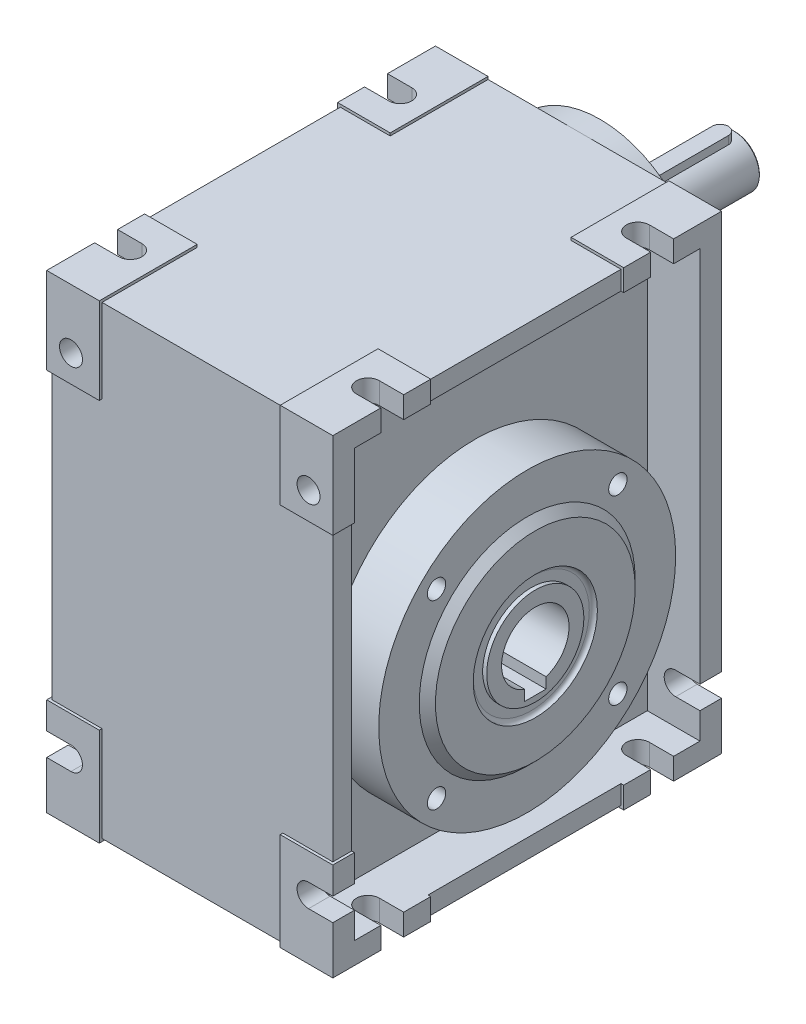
ISO-10303-21;
HEADER;
FILE_DESCRIPTION(('STEP AP214'),'2;1');
FILE_NAME('part.step','',(''),(''),'','','');
FILE_SCHEMA(('AUTOMOTIVE_DESIGN { 1 0 10303 214 1 1 1 1 }'));
ENDSEC;
DATA;
#1=APPLICATION_CONTEXT('core data for automotive mechanical design processes');
#2=APPLICATION_PROTOCOL_DEFINITION('international standard','automotive_design',2000,#1);
#3=PRODUCT_CONTEXT('',#1,'mechanical');
#4=PRODUCT('Part','Part','',(#3));
#5=PRODUCT_RELATED_PRODUCT_CATEGORY('part','',(#4));
#6=PRODUCT_DEFINITION_FORMATION('','',#4);
#7=PRODUCT_DEFINITION_CONTEXT('part definition',#1,'design');
#8=PRODUCT_DEFINITION('design','',#6,#7);
#9=PRODUCT_DEFINITION_SHAPE('','',#8);
#10=(LENGTH_UNIT() NAMED_UNIT(*) SI_UNIT(.MILLI.,.METRE.));
#11=(NAMED_UNIT(*) PLANE_ANGLE_UNIT() SI_UNIT($,.RADIAN.));
#12=(NAMED_UNIT(*) SI_UNIT($,.STERADIAN.) SOLID_ANGLE_UNIT());
#13=UNCERTAINTY_MEASURE_WITH_UNIT(LENGTH_MEASURE(1.E-05),#10,'distance_accuracy_value','');
#14=(GEOMETRIC_REPRESENTATION_CONTEXT(3) GLOBAL_UNCERTAINTY_ASSIGNED_CONTEXT((#13)) GLOBAL_UNIT_ASSIGNED_CONTEXT((#10,
#11,#12)) REPRESENTATION_CONTEXT('',''));
#15=CARTESIAN_POINT('',(0.,0.,0.));
#16=DIRECTION('',(0.,0.,1.));
#17=DIRECTION('',(1.,0.,0.));
#18=AXIS2_PLACEMENT_3D('',#15,#16,#17);
#19=CARTESIAN_POINT('',(53.,75.,-95.5));
#20=DIRECTION('',(0.,-1.,0.));
#21=DIRECTION('',(0.,0.,-1.));
#22=AXIS2_PLACEMENT_3D('',#19,#20,#21);
#23=CYLINDRICAL_SURFACE('',#22,3.);
#24=CARTESIAN_POINT('',(53.,69.,-95.5));
#25=DIRECTION('',(0.,1.,0.));
#26=DIRECTION('',(0.,0.,1.));
#27=AXIS2_PLACEMENT_3D('',#24,#25,#26);
#28=CIRCLE('',#27,3.);
#29=CARTESIAN_POINT('',(50.,69.,-95.5));
#30=VERTEX_POINT('',#29);
#31=CARTESIAN_POINT('',(56.,69.,-95.5));
#32=VERTEX_POINT('',#31);
#33=EDGE_CURVE('E112',#30,#32,#28,.T.);
#34=ORIENTED_EDGE('',*,*,#33,.T.);
#35=DIRECTION('',(0.,-1.,0.));
#36=VECTOR('',#35,1.);
#37=CARTESIAN_POINT('',(56.,75.,-95.5));
#38=LINE('',#37,#36);
#39=CARTESIAN_POINT('',(56.,75.,-95.5));
#40=VERTEX_POINT('',#39);
#41=EDGE_CURVE('E12',#40,#32,#38,.T.);
#42=ORIENTED_EDGE('',*,*,#41,.F.);
#43=CARTESIAN_POINT('',(53.,75.,-95.5));
#44=DIRECTION('',(0.,1.,0.));
#45=DIRECTION('',(0.,0.,1.));
#46=AXIS2_PLACEMENT_3D('',#43,#44,#45);
#47=CIRCLE('',#46,3.);
#48=CARTESIAN_POINT('',(50.,75.,-95.5));
#49=VERTEX_POINT('',#48);
#50=EDGE_CURVE('E100',#49,#40,#47,.T.);
#51=ORIENTED_EDGE('',*,*,#50,.F.);
#52=DIRECTION('',(0.,-1.,0.));
#53=VECTOR('',#52,1.);
#54=CARTESIAN_POINT('',(50.,75.,-95.5));
#55=LINE('',#54,#53);
#56=EDGE_CURVE('E108',#49,#30,#55,.T.);
#57=ORIENTED_EDGE('',*,*,#56,.T.);
#58=EDGE_LOOP('',(#34,#42,#51,#57));
#59=FACE_BOUND('',#58,.T.);
#60=ADVANCED_FACE('F49',(#59),#23,.T.);
#61=CARTESIAN_POINT('',(56.,75.,-124.5));
#62=DIRECTION('',(-1.,0.,0.));
#63=DIRECTION('',(0.,0.,1.));
#64=AXIS2_PLACEMENT_3D('',#61,#62,#63);
#65=PLANE('',#64);
#66=DIRECTION('',(0.,0.,-1.));
#67=VECTOR('',#66,1.);
#68=CARTESIAN_POINT('',(56.,69.,-124.5));
#69=LINE('',#68,#67);
#70=CARTESIAN_POINT('',(56.,69.,-124.5));
#71=VERTEX_POINT('',#70);
#72=EDGE_CURVE('E104',#32,#71,#69,.T.);
#73=ORIENTED_EDGE('',*,*,#72,.T.);
#74=DIRECTION('',(0.,-1.,0.));
#75=VECTOR('',#74,1.);
#76=CARTESIAN_POINT('',(56.,75.,-124.5));
#77=LINE('',#76,#75);
#78=CARTESIAN_POINT('',(56.,75.,-124.5));
#79=VERTEX_POINT('',#78);
#80=EDGE_CURVE('E57',#79,#71,#77,.T.);
#81=ORIENTED_EDGE('',*,*,#80,.F.);
#82=DIRECTION('',(0.,0.,-1.));
#83=VECTOR('',#82,1.);
#84=CARTESIAN_POINT('',(56.,75.,-124.5));
#85=LINE('',#84,#83);
#86=EDGE_CURVE('E95',#40,#79,#85,.T.);
#87=ORIENTED_EDGE('',*,*,#86,.F.);
#88=ORIENTED_EDGE('',*,*,#41,.T.);
#89=EDGE_LOOP('',(#73,#81,#87,#88));
#90=FACE_BOUND('',#89,.T.);
#91=ADVANCED_FACE('F103',(#90),#65,.F.);
#92=CARTESIAN_POINT('',(53.,75.,-124.5));
#93=DIRECTION('',(0.,-1.,0.));
#94=DIRECTION('',(0.,0.,-1.));
#95=AXIS2_PLACEMENT_3D('',#92,#93,#94);
#96=CYLINDRICAL_SURFACE('',#95,3.);
#97=CARTESIAN_POINT('',(53.,69.,-124.5));
#98=DIRECTION('',(0.,1.,0.));
#99=DIRECTION('',(0.,0.,1.));
#100=AXIS2_PLACEMENT_3D('',#97,#98,#99);
#101=CIRCLE('',#100,3.);
#102=CARTESIAN_POINT('',(50.,69.,-124.5));
#103=VERTEX_POINT('',#102);
#104=EDGE_CURVE('E82',#71,#103,#101,.T.);
#105=ORIENTED_EDGE('',*,*,#104,.T.);
#106=DIRECTION('',(0.,-1.,0.));
#107=VECTOR('',#106,1.);
#108=CARTESIAN_POINT('',(50.,75.,-124.5));
#109=LINE('',#108,#107);
#110=CARTESIAN_POINT('',(50.,75.,-124.5));
#111=VERTEX_POINT('',#110);
#112=EDGE_CURVE('E105',#111,#103,#109,.T.);
#113=ORIENTED_EDGE('',*,*,#112,.F.);
#114=CARTESIAN_POINT('',(53.,75.,-124.5));
#115=DIRECTION('',(0.,1.,0.));
#116=DIRECTION('',(0.,0.,1.));
#117=AXIS2_PLACEMENT_3D('',#114,#115,#116);
#118=CIRCLE('',#117,3.);
#119=EDGE_CURVE('E98',#79,#111,#118,.T.);
#120=ORIENTED_EDGE('',*,*,#119,.F.);
#121=ORIENTED_EDGE('',*,*,#80,.T.);
#122=EDGE_LOOP('',(#105,#113,#120,#121));
#123=FACE_BOUND('',#122,.T.);
#124=ADVANCED_FACE('F106',(#123),#96,.T.);
#125=CARTESIAN_POINT('',(50.,75.,-95.5));
#126=DIRECTION('',(1.,0.,0.));
#127=DIRECTION('',(0.,0.,-1.));
#128=AXIS2_PLACEMENT_3D('',#125,#126,#127);
#129=PLANE('',#128);
#130=DIRECTION('',(0.,0.,1.));
#131=VECTOR('',#130,1.);
#132=CARTESIAN_POINT('',(50.,69.,-95.5));
#133=LINE('',#132,#131);
#134=EDGE_CURVE('E88',#103,#30,#133,.T.);
#135=ORIENTED_EDGE('',*,*,#134,.T.);
#136=ORIENTED_EDGE('',*,*,#56,.F.);
#137=DIRECTION('',(0.,0.,1.));
#138=VECTOR('',#137,1.);
#139=CARTESIAN_POINT('',(50.,75.,-95.5));
#140=LINE('',#139,#138);
#141=EDGE_CURVE('E65',#111,#49,#140,.T.);
#142=ORIENTED_EDGE('',*,*,#141,.F.);
#143=ORIENTED_EDGE('',*,*,#112,.T.);
#144=EDGE_LOOP('',(#135,#136,#142,#143));
#145=FACE_BOUND('',#144,.T.);
#146=ADVANCED_FACE('F119',(#145),#129,.F.);
#147=CARTESIAN_POINT('',(53.,75.,-95.5));
#148=DIRECTION('',(0.,1.,0.));
#149=DIRECTION('',(0.,0.,1.));
#150=AXIS2_PLACEMENT_3D('',#147,#148,#149);
#151=PLANE('',#150);
#152=ORIENTED_EDGE('',*,*,#50,.T.);
#153=ORIENTED_EDGE('',*,*,#86,.T.);
#154=ORIENTED_EDGE('',*,*,#119,.T.);
#155=ORIENTED_EDGE('',*,*,#141,.T.);
#156=EDGE_LOOP('',(#152,#153,#154,#155));
#157=FACE_BOUND('',#156,.T.);
#158=ADVANCED_FACE('F96',(#157),#151,.T.);
#159=CARTESIAN_POINT('',(53.,69.,-95.5));
#160=DIRECTION('',(0.,1.,0.));
#161=DIRECTION('',(0.,0.,1.));
#162=AXIS2_PLACEMENT_3D('',#159,#160,#161);
#163=PLANE('',#162);
#164=ORIENTED_EDGE('',*,*,#33,.F.);
#165=ORIENTED_EDGE('',*,*,#134,.F.);
#166=ORIENTED_EDGE('',*,*,#104,.F.);
#167=ORIENTED_EDGE('',*,*,#72,.F.);
#168=EDGE_LOOP('',(#164,#165,#166,#167));
#169=FACE_BOUND('',#168,.T.);
#170=ADVANCED_FACE('F122',(#169),#163,.F.);
#171=CLOSED_SHELL('',(#60,#91,#124,#146,#158,#170));
#172=MANIFOLD_SOLID_BREP('B2',#171);
#173=CARTESIAN_POINT('',(53.,63.,-90.));
#174=DIRECTION('',(0.,0.,-1.));
#175=DIRECTION('',(-1.,0.,0.));
#176=AXIS2_PLACEMENT_3D('',#173,#174,#175);
#177=PLANE('',#176);
#178=CARTESIAN_POINT('',(53.,63.,-90.));
#179=DIRECTION('',(0.,0.,-1.));
#180=DIRECTION('',(-1.,0.,0.));
#181=AXIS2_PLACEMENT_3D('',#178,#179,#180);
#182=CIRCLE('',#181,11.);
#183=CARTESIAN_POINT('',(42.,63.,-90.));
#184=VERTEX_POINT('',#183);
#185=EDGE_CURVE('E924',#184,#184,#182,.T.);
#186=ORIENTED_EDGE('',*,*,#185,.T.);
#187=EDGE_LOOP('',(#186));
#188=FACE_BOUND('',#187,.T.);
#189=CARTESIAN_POINT('',(53.,63.,-90.));
#190=DIRECTION('',(0.,0.,-1.));
#191=DIRECTION('',(-1.,0.,0.));
#192=AXIS2_PLACEMENT_3D('',#189,#190,#191);
#193=CIRCLE('',#192,9.50000000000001);
#194=CARTESIAN_POINT('',(43.5,63.,-90.));
#195=VERTEX_POINT('',#194);
#196=EDGE_CURVE('E916',#195,#195,#193,.T.);
#197=ORIENTED_EDGE('',*,*,#196,.F.);
#198=EDGE_LOOP('',(#197));
#199=FACE_BOUND('',#198,.T.);
#200=ADVANCED_FACE('F173',(#188,#199),#177,.T.);
#201=CARTESIAN_POINT('',(53.,63.,-80.));
#202=DIRECTION('',(0.,0.,-1.));
#203=DIRECTION('',(-1.,0.,0.));
#204=AXIS2_PLACEMENT_3D('',#201,#202,#203);
#205=PLANE('',#204);
#206=CARTESIAN_POINT('',(53.,63.,-80.));
#207=DIRECTION('',(0.,0.,-1.));
#208=DIRECTION('',(-1.,0.,0.));
#209=AXIS2_PLACEMENT_3D('',#206,#207,#208);
#210=CIRCLE('',#209,38.);
#211=CARTESIAN_POINT('',(15.,63.,-80.));
#212=VERTEX_POINT('',#211);
#213=EDGE_CURVE('E1068',#212,#212,#210,.T.);
#214=ORIENTED_EDGE('',*,*,#213,.T.);
#215=EDGE_LOOP('',(#214));
#216=FACE_BOUND('',#215,.T.);
#217=CARTESIAN_POINT('',(53.,63.,-80.));
#218=DIRECTION('',(0.,0.,-1.));
#219=DIRECTION('',(-1.,0.,0.));
#220=AXIS2_PLACEMENT_3D('',#217,#218,#219);
#221=CIRCLE('',#220,11.);
#222=CARTESIAN_POINT('',(42.,63.,-80.));
#223=VERTEX_POINT('',#222);
#224=EDGE_CURVE('E923',#223,#223,#221,.T.);
#225=ORIENTED_EDGE('',*,*,#224,.F.);
#226=EDGE_LOOP('',(#225));
#227=FACE_BOUND('',#226,.T.);
#228=ADVANCED_FACE('F1819',(#216,#227),#205,.T.);
#229=CARTESIAN_POINT('',(0.,0.,0.));
#230=DIRECTION('',(-1.,0.,0.));
#231=DIRECTION('',(0.,0.,1.));
#232=AXIS2_PLACEMENT_3D('',#229,#230,#231);
#233=PLANE('',#232);
#234=CARTESIAN_POINT('',(0.,0.,0.));
#235=DIRECTION('',(-1.,0.,0.));
#236=DIRECTION('',(0.,0.,1.));
#237=AXIS2_PLACEMENT_3D('',#234,#235,#236);
#238=CIRCLE('',#237,55.);
#239=CARTESIAN_POINT('',(0.,0.,55.));
#240=VERTEX_POINT('',#239);
#241=EDGE_CURVE('E1025',#240,#240,#238,.T.);
#242=ORIENTED_EDGE('',*,*,#241,.T.);
#243=EDGE_LOOP('',(#242));
#244=FACE_BOUND('',#243,.T.);
#245=CARTESIAN_POINT('',(0.,33.587572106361,33.587572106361));
#246=DIRECTION('',(-1.,0.,0.));
#247=DIRECTION('',(0.,0.,1.));
#248=AXIS2_PLACEMENT_3D('',#245,#246,#247);
#249=CIRCLE('',#248,3.39999999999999);
#250=CARTESIAN_POINT('',(0.,33.587572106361,36.987572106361));
#251=VERTEX_POINT('',#250);
#252=EDGE_CURVE('E1019',#251,#251,#249,.T.);
#253=ORIENTED_EDGE('',*,*,#252,.F.);
#254=EDGE_LOOP('',(#253));
#255=FACE_BOUND('',#254,.T.);
#256=CARTESIAN_POINT('',(0.,-33.587572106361,33.587572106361));
#257=DIRECTION('',(-1.,0.,0.));
#258=DIRECTION('',(0.,0.,1.));
#259=AXIS2_PLACEMENT_3D('',#256,#257,#258);
#260=CIRCLE('',#259,3.39999999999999);
#261=CARTESIAN_POINT('',(0.,-33.587572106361,36.987572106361));
#262=VERTEX_POINT('',#261);
#263=EDGE_CURVE('E1013',#262,#262,#260,.T.);
#264=ORIENTED_EDGE('',*,*,#263,.F.);
#265=EDGE_LOOP('',(#264));
#266=FACE_BOUND('',#265,.T.);
#267=CARTESIAN_POINT('',(0.,-33.587572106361,-33.587572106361));
#268=DIRECTION('',(-1.,0.,0.));
#269=DIRECTION('',(0.,0.,1.));
#270=AXIS2_PLACEMENT_3D('',#267,#268,#269);
#271=CIRCLE('',#270,3.39999999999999);
#272=CARTESIAN_POINT('',(0.,-33.587572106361,-30.187572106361));
#273=VERTEX_POINT('',#272);
#274=EDGE_CURVE('E1007',#273,#273,#271,.T.);
#275=ORIENTED_EDGE('',*,*,#274,.F.);
#276=EDGE_LOOP('',(#275));
#277=FACE_BOUND('',#276,.T.);
#278=CARTESIAN_POINT('',(0.,33.587572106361,-33.587572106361));
#279=DIRECTION('',(-1.,0.,0.));
#280=DIRECTION('',(0.,0.,1.));
#281=AXIS2_PLACEMENT_3D('',#278,#279,#280);
#282=CIRCLE('',#281,3.39999999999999);
#283=CARTESIAN_POINT('',(0.,33.587572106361,-30.187572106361));
#284=VERTEX_POINT('',#283);
#285=EDGE_CURVE('E1001',#284,#284,#282,.T.);
#286=ORIENTED_EDGE('',*,*,#285,.F.);
#287=EDGE_LOOP('',(#286));
#288=FACE_BOUND('',#287,.T.);
#289=CARTESIAN_POINT('',(0.,0.,0.));
#290=DIRECTION('',(-1.,0.,0.));
#291=DIRECTION('',(0.,0.,1.));
#292=AXIS2_PLACEMENT_3D('',#289,#290,#291);
#293=CIRCLE('',#292,40.);
#294=CARTESIAN_POINT('',(0.,0.,-40.));
#295=VERTEX_POINT('',#294);
#296=EDGE_CURVE('E998',#295,#295,#293,.T.);
#297=ORIENTED_EDGE('',*,*,#296,.F.);
#298=EDGE_LOOP('',(#297));
#299=FACE_BOUND('',#298,.T.);
#300=ADVANCED_FACE('F1824',(#244,#255,#266,#277,#288,#299),#233,.T.);
#301=CARTESIAN_POINT('',(106.,0.,0.));
#302=DIRECTION('',(1.,0.,0.));
#303=DIRECTION('',(0.,0.,-1.));
#304=AXIS2_PLACEMENT_3D('',#301,#302,#303);
#305=PLANE('',#304);
#306=CARTESIAN_POINT('',(106.,0.,0.));
#307=DIRECTION('',(1.,0.,0.));
#308=DIRECTION('',(0.,0.,-1.));
#309=AXIS2_PLACEMENT_3D('',#306,#307,#308);
#310=CIRCLE('',#309,55.);
#311=CARTESIAN_POINT('',(106.,0.,-55.));
#312=VERTEX_POINT('',#311);
#313=EDGE_CURVE('E1064',#312,#312,#310,.T.);
#314=ORIENTED_EDGE('',*,*,#313,.T.);
#315=EDGE_LOOP('',(#314));
#316=FACE_BOUND('',#315,.T.);
#317=CARTESIAN_POINT('',(106.,-33.587572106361,33.587572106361));
#318=DIRECTION('',(1.,0.,0.));
#319=DIRECTION('',(0.,0.,-1.));
#320=AXIS2_PLACEMENT_3D('',#317,#318,#319);
#321=CIRCLE('',#320,3.4);
#322=CARTESIAN_POINT('',(106.,-33.587572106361,30.187572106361));
#323=VERTEX_POINT('',#322);
#324=EDGE_CURVE('E1058',#323,#323,#321,.T.);
#325=ORIENTED_EDGE('',*,*,#324,.F.);
#326=EDGE_LOOP('',(#325));
#327=FACE_BOUND('',#326,.T.);
#328=CARTESIAN_POINT('',(106.,-33.587572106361,-33.587572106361));
#329=DIRECTION('',(1.,0.,0.));
#330=DIRECTION('',(0.,0.,-1.));
#331=AXIS2_PLACEMENT_3D('',#328,#329,#330);
#332=CIRCLE('',#331,3.4);
#333=CARTESIAN_POINT('',(106.,-33.587572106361,-36.987572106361));
#334=VERTEX_POINT('',#333);
#335=EDGE_CURVE('E1052',#334,#334,#332,.T.);
#336=ORIENTED_EDGE('',*,*,#335,.F.);
#337=EDGE_LOOP('',(#336));
#338=FACE_BOUND('',#337,.T.);
#339=CARTESIAN_POINT('',(106.,33.587572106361,-33.587572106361));
#340=DIRECTION('',(1.,0.,0.));
#341=DIRECTION('',(0.,0.,-1.));
#342=AXIS2_PLACEMENT_3D('',#339,#340,#341);
#343=CIRCLE('',#342,3.4);
#344=CARTESIAN_POINT('',(106.,33.587572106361,-36.987572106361));
#345=VERTEX_POINT('',#344);
#346=EDGE_CURVE('E1046',#345,#345,#343,.T.);
#347=ORIENTED_EDGE('',*,*,#346,.F.);
#348=EDGE_LOOP('',(#347));
#349=FACE_BOUND('',#348,.T.);
#350=CARTESIAN_POINT('',(106.,33.587572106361,33.587572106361));
#351=DIRECTION('',(1.,0.,0.));
#352=DIRECTION('',(0.,0.,-1.));
#353=AXIS2_PLACEMENT_3D('',#350,#351,#352);
#354=CIRCLE('',#353,3.4);
#355=CARTESIAN_POINT('',(106.,33.587572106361,30.187572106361));
#356=VERTEX_POINT('',#355);
#357=EDGE_CURVE('E1040',#356,#356,#354,.T.);
#358=ORIENTED_EDGE('',*,*,#357,.F.);
#359=EDGE_LOOP('',(#358));
#360=FACE_BOUND('',#359,.T.);
#361=CARTESIAN_POINT('',(106.,0.,0.));
#362=DIRECTION('',(1.,0.,0.));
#363=DIRECTION('',(0.,0.,-1.));
#364=AXIS2_PLACEMENT_3D('',#361,#362,#363);
#365=CIRCLE('',#364,40.);
#366=CARTESIAN_POINT('',(106.,0.,-40.));
#367=VERTEX_POINT('',#366);
#368=EDGE_CURVE('E1037',#367,#367,#365,.T.);
#369=ORIENTED_EDGE('',*,*,#368,.F.);
#370=EDGE_LOOP('',(#369));
#371=FACE_BOUND('',#370,.T.);
#372=ADVANCED_FACE('F1905',(#316,#327,#338,#349,#360,#371),#305,.T.);
#373=CARTESIAN_POINT('',(106.,-72.,-72.));
#374=DIRECTION('',(0.,0.,1.));
#375=DIRECTION('',(1.,0.,0.));
#376=AXIS2_PLACEMENT_3D('',#373,#374,#375);
#377=PLANE('',#376);
#378=DIRECTION('',(1.,0.,0.));
#379=VECTOR('',#378,1.);
#380=CARTESIAN_POINT('',(19.5,101.,-72.));
#381=LINE('',#380,#379);
#382=CARTESIAN_POINT('',(19.5,101.,-72.));
#383=VERTEX_POINT('',#382);
#384=CARTESIAN_POINT('',(53.,101.,-72.));
#385=VERTEX_POINT('',#384);
#386=EDGE_CURVE('E1157',#383,#385,#381,.T.);
#387=ORIENTED_EDGE('',*,*,#386,.T.);
#388=CARTESIAN_POINT('',(53.,63.,-72.));
#389=DIRECTION('',(0.,0.,-1.));
#390=DIRECTION('',(-1.,0.,0.));
#391=AXIS2_PLACEMENT_3D('',#388,#389,#390);
#392=CIRCLE('',#391,38.);
#393=EDGE_CURVE('E1067',#385,#385,#392,.T.);
#394=ORIENTED_EDGE('',*,*,#393,.F.);
#395=CARTESIAN_POINT('',(86.5,101.,-72.));
#396=VERTEX_POINT('',#395);
#397=EDGE_CURVE('E1156',#385,#396,#381,.T.);
#398=ORIENTED_EDGE('',*,*,#397,.T.);
#399=DIRECTION('',(0.,1.,0.));
#400=VECTOR('',#399,1.);
#401=CARTESIAN_POINT('',(86.5,101.,-72.));
#402=LINE('',#401,#400);
#403=CARTESIAN_POINT('',(86.5,102.,-72.));
#404=VERTEX_POINT('',#403);
#405=EDGE_CURVE('E1159',#396,#404,#402,.T.);
#406=ORIENTED_EDGE('',*,*,#405,.T.);
#407=DIRECTION('',(-1.,0.,0.));
#408=VECTOR('',#407,1.);
#409=CARTESIAN_POINT('',(106.,102.,-72.));
#410=LINE('',#409,#408);
#411=CARTESIAN_POINT('',(106.,102.,-72.));
#412=VERTEX_POINT('',#411);
#413=EDGE_CURVE('E1676',#412,#404,#410,.T.);
#414=ORIENTED_EDGE('',*,*,#413,.F.);
#415=DIRECTION('',(0.,1.,0.));
#416=VECTOR('',#415,1.);
#417=CARTESIAN_POINT('',(106.,-72.,-72.));
#418=LINE('',#417,#416);
#419=CARTESIAN_POINT('',(106.,-45.75,-72.));
#420=VERTEX_POINT('',#419);
#421=EDGE_CURVE('E1649',#420,#412,#418,.T.);
#422=ORIENTED_EDGE('',*,*,#421,.F.);
#423=DIRECTION('',(1.,0.,0.));
#424=VECTOR('',#423,1.);
#425=CARTESIAN_POINT('',(0.,-45.7499999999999,-72.));
#426=LINE('',#425,#424);
#427=CARTESIAN_POINT('',(97.,-45.75,-72.));
#428=VERTEX_POINT('',#427);
#429=EDGE_CURVE('E1368',#428,#420,#426,.T.);
#430=ORIENTED_EDGE('',*,*,#429,.F.);
#431=CARTESIAN_POINT('',(97.,-50.,-72.));
#432=DIRECTION('',(0.,0.,1.));
#433=DIRECTION('',(1.,0.,0.));
#434=AXIS2_PLACEMENT_3D('',#431,#432,#433);
#435=CIRCLE('',#434,4.25000000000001);
#436=CARTESIAN_POINT('',(97.,-54.25,-72.));
#437=VERTEX_POINT('',#436);
#438=EDGE_CURVE('E1370',#428,#437,#435,.T.);
#439=ORIENTED_EDGE('',*,*,#438,.T.);
#440=DIRECTION('',(1.,0.,0.));
#441=VECTOR('',#440,1.);
#442=CARTESIAN_POINT('',(0.,-54.25,-72.));
#443=LINE('',#442,#441);
#444=CARTESIAN_POINT('',(106.,-54.25,-72.));
#445=VERTEX_POINT('',#444);
#446=EDGE_CURVE('E1374',#437,#445,#443,.T.);
#447=ORIENTED_EDGE('',*,*,#446,.T.);
#448=CARTESIAN_POINT('',(106.,-72.,-72.));
#449=VERTEX_POINT('',#448);
#450=EDGE_CURVE('E1652',#449,#445,#418,.T.);
#451=ORIENTED_EDGE('',*,*,#450,.F.);
#452=DIRECTION('',(-1.,0.,0.));
#453=VECTOR('',#452,1.);
#454=CARTESIAN_POINT('',(106.,-72.,-72.));
#455=LINE('',#454,#453);
#456=CARTESIAN_POINT('',(86.5,-72.,-72.));
#457=VERTEX_POINT('',#456);
#458=EDGE_CURVE('E1680',#449,#457,#455,.T.);
#459=ORIENTED_EDGE('',*,*,#458,.T.);
#460=DIRECTION('',(0.,1.,0.));
#461=VECTOR('',#460,1.);
#462=CARTESIAN_POINT('',(86.5,-71.,-72.));
#463=LINE('',#462,#461);
#464=CARTESIAN_POINT('',(86.5,-71.,-72.));
#465=VERTEX_POINT('',#464);
#466=EDGE_CURVE('E1221',#457,#465,#463,.T.);
#467=ORIENTED_EDGE('',*,*,#466,.T.);
#468=DIRECTION('',(-1.,0.,0.));
#469=VECTOR('',#468,1.);
#470=CARTESIAN_POINT('',(19.5,-71.,-72.));
#471=LINE('',#470,#469);
#472=CARTESIAN_POINT('',(19.5,-71.,-72.));
#473=VERTEX_POINT('',#472);
#474=EDGE_CURVE('E1224',#465,#473,#471,.T.);
#475=ORIENTED_EDGE('',*,*,#474,.T.);
#476=DIRECTION('',(0.,-1.,0.));
#477=VECTOR('',#476,1.);
#478=CARTESIAN_POINT('',(19.5,-72.,-72.));
#479=LINE('',#478,#477);
#480=CARTESIAN_POINT('',(19.5,-72.,-72.));
#481=VERTEX_POINT('',#480);
#482=EDGE_CURVE('E1228',#473,#481,#479,.T.);
#483=ORIENTED_EDGE('',*,*,#482,.T.);
#484=CARTESIAN_POINT('',(0.,-72.,-72.));
#485=VERTEX_POINT('',#484);
#486=EDGE_CURVE('E1679',#481,#485,#455,.T.);
#487=ORIENTED_EDGE('',*,*,#486,.T.);
#488=DIRECTION('',(0.,1.,0.));
#489=VECTOR('',#488,1.);
#490=CARTESIAN_POINT('',(0.,-72.,-72.));
#491=LINE('',#490,#489);
#492=CARTESIAN_POINT('',(0.,-54.25,-72.));
#493=VERTEX_POINT('',#492);
#494=EDGE_CURVE('E1673',#485,#493,#491,.T.);
#495=ORIENTED_EDGE('',*,*,#494,.T.);
#496=DIRECTION('',(1.,0.,0.));
#497=VECTOR('',#496,1.);
#498=CARTESIAN_POINT('',(0.,-54.25,-72.));
#499=LINE('',#498,#497);
#500=CARTESIAN_POINT('',(9.,-54.25,-72.));
#501=VERTEX_POINT('',#500);
#502=EDGE_CURVE('E1327',#493,#501,#499,.T.);
#503=ORIENTED_EDGE('',*,*,#502,.T.);
#504=CARTESIAN_POINT('',(9.,-50.,-72.));
#505=DIRECTION('',(0.,0.,1.));
#506=DIRECTION('',(1.,0.,0.));
#507=AXIS2_PLACEMENT_3D('',#504,#505,#506);
#508=CIRCLE('',#507,4.25);
#509=CARTESIAN_POINT('',(9.,-45.75,-72.));
#510=VERTEX_POINT('',#509);
#511=EDGE_CURVE('E1330',#501,#510,#508,.T.);
#512=ORIENTED_EDGE('',*,*,#511,.T.);
#513=DIRECTION('',(-1.,0.,0.));
#514=VECTOR('',#513,1.);
#515=CARTESIAN_POINT('',(0.,-45.75,-72.));
#516=LINE('',#515,#514);
#517=CARTESIAN_POINT('',(0.,-45.75,-72.));
#518=VERTEX_POINT('',#517);
#519=EDGE_CURVE('E1334',#510,#518,#516,.T.);
#520=ORIENTED_EDGE('',*,*,#519,.T.);
#521=CARTESIAN_POINT('',(0.,102.,-72.));
#522=VERTEX_POINT('',#521);
#523=EDGE_CURVE('E1670',#518,#522,#491,.T.);
#524=ORIENTED_EDGE('',*,*,#523,.T.);
#525=CARTESIAN_POINT('',(19.5,102.,-72.));
#526=VERTEX_POINT('',#525);
#527=EDGE_CURVE('E1655',#526,#522,#410,.T.);
#528=ORIENTED_EDGE('',*,*,#527,.F.);
#529=DIRECTION('',(0.,-1.,0.));
#530=VECTOR('',#529,1.);
#531=CARTESIAN_POINT('',(19.5,102.,-72.));
#532=LINE('',#531,#530);
#533=EDGE_CURVE('E1153',#526,#383,#532,.T.);
#534=ORIENTED_EDGE('',*,*,#533,.T.);
#535=EDGE_LOOP('',(#387,#394,#398,#406,#414,#422,#430,#439,#447,#451,#459,#467,#475,#483,#487,
#495,#503,#512,#520,#524,#528,#534));
#536=FACE_BOUND('',#535,.T.);
#537=ADVANCED_FACE('F1960',(#536),#377,.F.);
#538=CARTESIAN_POINT('',(106.,0.,0.));
#539=DIRECTION('',(1.,0.,0.));
#540=DIRECTION('',(0.,0.,-1.));
#541=AXIS2_PLACEMENT_3D('',#538,#539,#540);
#542=PLANE('',#541);
#543=DIRECTION('',(0.,0.,-1.));
#544=VECTOR('',#543,1.);
#545=CARTESIAN_POINT('',(106.,70.,71.));
#546=LINE('',#545,#544);
#547=CARTESIAN_POINT('',(106.,70.,72.));
#548=VERTEX_POINT('',#547);
#549=CARTESIAN_POINT('',(106.,70.,64.));
#550=VERTEX_POINT('',#549);
#551=EDGE_CURVE('E1109',#548,#550,#546,.T.);
#552=ORIENTED_EDGE('',*,*,#551,.T.);
#553=DIRECTION('',(0.,-1.,0.));
#554=VECTOR('',#553,1.);
#555=CARTESIAN_POINT('',(106.,-64.,64.));
#556=LINE('',#555,#554);
#557=CARTESIAN_POINT('',(106.,94.,64.));
#558=VERTEX_POINT('',#557);
#559=EDGE_CURVE('E1611',#558,#550,#556,.T.);
#560=ORIENTED_EDGE('',*,*,#559,.F.);
#561=DIRECTION('',(0.,0.,1.));
#562=VECTOR('',#561,1.);
#563=CARTESIAN_POINT('',(106.,94.,64.));
#564=LINE('',#563,#562);
#565=CARTESIAN_POINT('',(106.,94.,54.2500000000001));
#566=VERTEX_POINT('',#565);
#567=EDGE_CURVE('E1604',#566,#558,#564,.T.);
#568=ORIENTED_EDGE('',*,*,#567,.F.);
#569=DIRECTION('',(0.,1.,0.));
#570=VECTOR('',#569,1.);
#571=CARTESIAN_POINT('',(106.,-72.,54.25));
#572=LINE('',#571,#570);
#573=CARTESIAN_POINT('',(106.,102.,54.2500000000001));
#574=VERTEX_POINT('',#573);
#575=EDGE_CURVE('E1475',#566,#574,#572,.T.);
#576=ORIENTED_EDGE('',*,*,#575,.T.);
#577=DIRECTION('',(0.,0.,1.));
#578=VECTOR('',#577,1.);
#579=CARTESIAN_POINT('',(106.,102.,-72.));
#580=LINE('',#579,#578);
#581=CARTESIAN_POINT('',(106.,102.,72.));
#582=VERTEX_POINT('',#581);
#583=EDGE_CURVE('E1640',#574,#582,#580,.T.);
#584=ORIENTED_EDGE('',*,*,#583,.T.);
#585=DIRECTION('',(0.,-1.,0.));
#586=VECTOR('',#585,1.);
#587=CARTESIAN_POINT('',(106.,102.,72.));
#588=LINE('',#587,#586);
#589=EDGE_CURVE('E1641',#582,#548,#588,.T.);
#590=ORIENTED_EDGE('',*,*,#589,.T.);
#591=EDGE_LOOP('',(#552,#560,#568,#576,#584,#590));
#592=FACE_BOUND('',#591,.T.);
#593=ADVANCED_FACE('F2187',(#592),#542,.T.);
#594=CARTESIAN_POINT('',(0.,0.,0.));
#595=DIRECTION('',(1.,0.,0.));
#596=DIRECTION('',(0.,0.,-1.));
#597=AXIS2_PLACEMENT_3D('',#594,#595,#596);
#598=PLANE('',#597);
#599=DIRECTION('',(0.,1.,0.));
#600=VECTOR('',#599,1.);
#601=CARTESIAN_POINT('',(0.,-64.,64.));
#602=LINE('',#601,#600);
#603=CARTESIAN_POINT('',(0.,70.,64.));
#604=VERTEX_POINT('',#603);
#605=CARTESIAN_POINT('',(0.,94.,64.));
#606=VERTEX_POINT('',#605);
#607=EDGE_CURVE('E1567',#604,#606,#602,.T.);
#608=ORIENTED_EDGE('',*,*,#607,.F.);
#609=DIRECTION('',(0.,0.,-1.));
#610=VECTOR('',#609,1.);
#611=CARTESIAN_POINT('',(0.,70.,71.));
#612=LINE('',#611,#610);
#613=CARTESIAN_POINT('',(0.,70.,72.));
#614=VERTEX_POINT('',#613);
#615=EDGE_CURVE('E1110',#614,#604,#612,.T.);
#616=ORIENTED_EDGE('',*,*,#615,.F.);
#617=DIRECTION('',(0.,-1.,0.));
#618=VECTOR('',#617,1.);
#619=CARTESIAN_POINT('',(0.,102.,72.));
#620=LINE('',#619,#618);
#621=CARTESIAN_POINT('',(0.,102.,72.));
#622=VERTEX_POINT('',#621);
#623=EDGE_CURVE('E1662',#622,#614,#620,.T.);
#624=ORIENTED_EDGE('',*,*,#623,.F.);
#625=DIRECTION('',(0.,0.,1.));
#626=VECTOR('',#625,1.);
#627=CARTESIAN_POINT('',(0.,102.,-72.));
#628=LINE('',#627,#626);
#629=CARTESIAN_POINT('',(0.,102.,54.25));
#630=VERTEX_POINT('',#629);
#631=EDGE_CURVE('E1625',#630,#622,#628,.T.);
#632=ORIENTED_EDGE('',*,*,#631,.F.);
#633=DIRECTION('',(0.,1.,0.));
#634=VECTOR('',#633,1.);
#635=CARTESIAN_POINT('',(0.,-72.,54.25));
#636=LINE('',#635,#634);
#637=CARTESIAN_POINT('',(0.,94.,54.25));
#638=VERTEX_POINT('',#637);
#639=EDGE_CURVE('E1512',#638,#630,#636,.T.);
#640=ORIENTED_EDGE('',*,*,#639,.F.);
#641=DIRECTION('',(0.,0.,-1.));
#642=VECTOR('',#641,1.);
#643=CARTESIAN_POINT('',(0.,94.,-64.));
#644=LINE('',#643,#642);
#645=EDGE_CURVE('E1573',#606,#638,#644,.T.);
#646=ORIENTED_EDGE('',*,*,#645,.F.);
#647=EDGE_LOOP('',(#608,#616,#624,#632,#640,#646));
#648=FACE_BOUND('',#647,.T.);
#649=ADVANCED_FACE('F2192',(#648),#598,.F.);
#650=CARTESIAN_POINT('',(106.,102.,72.));
#651=DIRECTION('',(0.,0.,-1.));
#652=DIRECTION('',(0.,1.,0.));
#653=AXIS2_PLACEMENT_3D('',#650,#651,#652);
#654=PLANE('',#653);
#655=CARTESIAN_POINT('',(106.,-35.75,72.));
#656=VERTEX_POINT('',#655);
#657=CARTESIAN_POINT('',(106.,-45.75,72.));
#658=VERTEX_POINT('',#657);
#659=EDGE_CURVE('E1645',#656,#658,#588,.T.);
#660=ORIENTED_EDGE('',*,*,#659,.F.);
#661=DIRECTION('',(-1.,0.,0.));
#662=VECTOR('',#661,1.);
#663=CARTESIAN_POINT('',(106.,-35.75,72.));
#664=LINE('',#663,#662);
#665=CARTESIAN_POINT('',(86.5,-35.75,72.));
#666=VERTEX_POINT('',#665);
#667=EDGE_CURVE('E1125',#656,#666,#664,.T.);
#668=ORIENTED_EDGE('',*,*,#667,.T.);
#669=DIRECTION('',(0.,1.,0.));
#670=VECTOR('',#669,1.);
#671=CARTESIAN_POINT('',(86.5,-71.,72.));
#672=LINE('',#671,#670);
#673=CARTESIAN_POINT('',(86.5,-72.,72.));
#674=VERTEX_POINT('',#673);
#675=EDGE_CURVE('E1232',#674,#666,#672,.T.);
#676=ORIENTED_EDGE('',*,*,#675,.F.);
#677=DIRECTION('',(-1.,0.,0.));
#678=VECTOR('',#677,1.);
#679=CARTESIAN_POINT('',(106.,-72.,72.));
#680=LINE('',#679,#678);
#681=CARTESIAN_POINT('',(106.,-72.,72.));
#682=VERTEX_POINT('',#681);
#683=EDGE_CURVE('E1684',#682,#674,#680,.T.);
#684=ORIENTED_EDGE('',*,*,#683,.F.);
#685=CARTESIAN_POINT('',(106.,-54.25,72.));
#686=VERTEX_POINT('',#685);
#687=EDGE_CURVE('E1637',#686,#682,#588,.T.);
#688=ORIENTED_EDGE('',*,*,#687,.F.);
#689=DIRECTION('',(1.,0.,0.));
#690=VECTOR('',#689,1.);
#691=CARTESIAN_POINT('',(0.,-54.25,72.));
#692=LINE('',#691,#690);
#693=CARTESIAN_POINT('',(97.,-54.25,72.));
#694=VERTEX_POINT('',#693);
#695=EDGE_CURVE('E1371',#694,#686,#692,.T.);
#696=ORIENTED_EDGE('',*,*,#695,.F.);
#697=CARTESIAN_POINT('',(97.,-50.,72.));
#698=DIRECTION('',(0.,0.,1.));
#699=DIRECTION('',(1.,0.,0.));
#700=AXIS2_PLACEMENT_3D('',#697,#698,#699);
#701=CIRCLE('',#700,4.25000000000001);
#702=CARTESIAN_POINT('',(97.,-45.75,72.));
#703=VERTEX_POINT('',#702);
#704=EDGE_CURVE('E1380',#703,#694,#701,.T.);
#705=ORIENTED_EDGE('',*,*,#704,.F.);
#706=DIRECTION('',(1.,0.,0.));
#707=VECTOR('',#706,1.);
#708=CARTESIAN_POINT('',(0.,-45.7499999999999,72.));
#709=LINE('',#708,#707);
#710=EDGE_CURVE('E1367',#703,#658,#709,.T.);
#711=ORIENTED_EDGE('',*,*,#710,.T.);
#712=EDGE_LOOP('',(#660,#668,#676,#684,#688,#696,#705,#711));
#713=FACE_BOUND('',#712,.T.);
#714=ADVANCED_FACE('F2208',(#713),#654,.F.);
#715=CARTESIAN_POINT('',(19.5,-72.,-72.));
#716=DIRECTION('',(-1.,0.,0.));
#717=DIRECTION('',(0.,0.,1.));
#718=AXIS2_PLACEMENT_3D('',#715,#716,#717);
#719=PLANE('',#718);
#720=DIRECTION('',(0.,1.,0.));
#721=VECTOR('',#720,1.);
#722=CARTESIAN_POINT('',(19.5,-73.,71.));
#723=LINE('',#722,#721);
#724=CARTESIAN_POINT('',(19.5,-71.,71.));
#725=VERTEX_POINT('',#724);
#726=CARTESIAN_POINT('',(19.5,-35.75,71.));
#727=VERTEX_POINT('',#726);
#728=EDGE_CURVE('E1143',#725,#727,#723,.T.);
#729=ORIENTED_EDGE('',*,*,#728,.T.);
#730=DIRECTION('',(0.,0.,1.));
#731=VECTOR('',#730,1.);
#732=CARTESIAN_POINT('',(19.5,-35.75,-72.));
#733=LINE('',#732,#731);
#734=CARTESIAN_POINT('',(19.5,-35.75,72.));
#735=VERTEX_POINT('',#734);
#736=EDGE_CURVE('E1136',#727,#735,#733,.T.);
#737=ORIENTED_EDGE('',*,*,#736,.T.);
#738=DIRECTION('',(0.,-1.,0.));
#739=VECTOR('',#738,1.);
#740=CARTESIAN_POINT('',(19.5,-72.,72.));
#741=LINE('',#740,#739);
#742=CARTESIAN_POINT('',(19.5,-72.,72.));
#743=VERTEX_POINT('',#742);
#744=EDGE_CURVE('E1235',#735,#743,#741,.T.);
#745=ORIENTED_EDGE('',*,*,#744,.T.);
#746=DIRECTION('',(0.,0.,1.));
#747=VECTOR('',#746,1.);
#748=CARTESIAN_POINT('',(19.5,-72.,-72.));
#749=LINE('',#748,#747);
#750=CARTESIAN_POINT('',(19.5,-72.,35.75));
#751=VERTEX_POINT('',#750);
#752=EDGE_CURVE('E1242',#751,#743,#749,.T.);
#753=ORIENTED_EDGE('',*,*,#752,.F.);
#754=DIRECTION('',(0.,1.,0.));
#755=VECTOR('',#754,1.);
#756=CARTESIAN_POINT('',(19.5,-72.,35.75));
#757=LINE('',#756,#755);
#758=CARTESIAN_POINT('',(19.5,-71.,35.75));
#759=VERTEX_POINT('',#758);
#760=EDGE_CURVE('E1203',#751,#759,#757,.T.);
#761=ORIENTED_EDGE('',*,*,#760,.T.);
#762=DIRECTION('',(0.,0.,1.));
#763=VECTOR('',#762,1.);
#764=CARTESIAN_POINT('',(19.5,-71.,-72.));
#765=LINE('',#764,#763);
#766=EDGE_CURVE('E1246',#759,#725,#765,.T.);
#767=ORIENTED_EDGE('',*,*,#766,.T.);
#768=EDGE_LOOP('',(#729,#737,#745,#753,#761,#767));
#769=FACE_BOUND('',#768,.T.);
#770=ADVANCED_FACE('F2010',(#769),#719,.F.);
#771=CARTESIAN_POINT('',(86.5,-71.,-72.));
#772=DIRECTION('',(1.,0.,0.));
#773=DIRECTION('',(0.,0.,-1.));
#774=AXIS2_PLACEMENT_3D('',#771,#772,#773);
#775=PLANE('',#774);
#776=ORIENTED_EDGE('',*,*,#675,.T.);
#777=DIRECTION('',(0.,0.,-1.));
#778=VECTOR('',#777,1.);
#779=CARTESIAN_POINT('',(86.5,-35.75,-72.));
#780=LINE('',#779,#778);
#781=CARTESIAN_POINT('',(86.5,-35.75,71.));
#782=VERTEX_POINT('',#781);
#783=EDGE_CURVE('E1133',#666,#782,#780,.T.);
#784=ORIENTED_EDGE('',*,*,#783,.T.);
#785=DIRECTION('',(0.,1.,0.));
#786=VECTOR('',#785,1.);
#787=CARTESIAN_POINT('',(86.5,-73.,71.));
#788=LINE('',#787,#786);
#789=CARTESIAN_POINT('',(86.5,-71.,71.));
#790=VERTEX_POINT('',#789);
#791=EDGE_CURVE('E1148',#790,#782,#788,.T.);
#792=ORIENTED_EDGE('',*,*,#791,.F.);
#793=DIRECTION('',(0.,0.,1.));
#794=VECTOR('',#793,1.);
#795=CARTESIAN_POINT('',(86.5,-71.,-72.));
#796=LINE('',#795,#794);
#797=CARTESIAN_POINT('',(86.5,-71.,35.75));
#798=VERTEX_POINT('',#797);
#799=EDGE_CURVE('E1250',#798,#790,#796,.T.);
#800=ORIENTED_EDGE('',*,*,#799,.F.);
#801=DIRECTION('',(0.,-1.,0.));
#802=VECTOR('',#801,1.);
#803=CARTESIAN_POINT('',(86.5,-71.,35.75));
#804=LINE('',#803,#802);
#805=CARTESIAN_POINT('',(86.5,-72.,35.75));
#806=VERTEX_POINT('',#805);
#807=EDGE_CURVE('E1766',#798,#806,#804,.T.);
#808=ORIENTED_EDGE('',*,*,#807,.T.);
#809=DIRECTION('',(0.,0.,1.));
#810=VECTOR('',#809,1.);
#811=CARTESIAN_POINT('',(86.5,-72.,-72.));
#812=LINE('',#811,#810);
#813=EDGE_CURVE('E1231',#806,#674,#812,.T.);
#814=ORIENTED_EDGE('',*,*,#813,.T.);
#815=EDGE_LOOP('',(#776,#784,#792,#800,#808,#814));
#816=FACE_BOUND('',#815,.T.);
#817=ADVANCED_FACE('F2018',(#816),#775,.F.);
#818=ORIENTED_EDGE('',*,*,#744,.F.);
#819=CARTESIAN_POINT('',(0.,-35.75,72.));
#820=VERTEX_POINT('',#819);
#821=EDGE_CURVE('E1112',#735,#820,#664,.T.);
#822=ORIENTED_EDGE('',*,*,#821,.T.);
#823=CARTESIAN_POINT('',(0.,-45.75,72.));
#824=VERTEX_POINT('',#823);
#825=EDGE_CURVE('E1666',#820,#824,#620,.T.);
#826=ORIENTED_EDGE('',*,*,#825,.T.);
#827=DIRECTION('',(-1.,0.,0.));
#828=VECTOR('',#827,1.);
#829=CARTESIAN_POINT('',(0.,-45.75,72.));
#830=LINE('',#829,#828);
#831=CARTESIAN_POINT('',(9.,-45.75,72.));
#832=VERTEX_POINT('',#831);
#833=EDGE_CURVE('E1331',#832,#824,#830,.T.);
#834=ORIENTED_EDGE('',*,*,#833,.F.);
#835=CARTESIAN_POINT('',(9.,-50.,72.));
#836=DIRECTION('',(0.,0.,1.));
#837=DIRECTION('',(1.,0.,0.));
#838=AXIS2_PLACEMENT_3D('',#835,#836,#837);
#839=CIRCLE('',#838,4.25);
#840=CARTESIAN_POINT('',(9.,-54.25,72.));
#841=VERTEX_POINT('',#840);
#842=EDGE_CURVE('E1340',#841,#832,#839,.T.);
#843=ORIENTED_EDGE('',*,*,#842,.F.);
#844=DIRECTION('',(1.,0.,0.));
#845=VECTOR('',#844,1.);
#846=CARTESIAN_POINT('',(0.,-54.25,72.));
#847=LINE('',#846,#845);
#848=CARTESIAN_POINT('',(0.,-54.25,72.));
#849=VERTEX_POINT('',#848);
#850=EDGE_CURVE('E1324',#849,#841,#847,.T.);
#851=ORIENTED_EDGE('',*,*,#850,.F.);
#852=CARTESIAN_POINT('',(0.,-72.,72.));
#853=VERTEX_POINT('',#852);
#854=EDGE_CURVE('E1659',#849,#853,#620,.T.);
#855=ORIENTED_EDGE('',*,*,#854,.T.);
#856=EDGE_CURVE('E1683',#743,#853,#680,.T.);
#857=ORIENTED_EDGE('',*,*,#856,.F.);
#858=EDGE_LOOP('',(#818,#822,#826,#834,#843,#851,#855,#857));
#859=FACE_BOUND('',#858,.T.);
#860=ADVANCED_FACE('F2564',(#859),#654,.F.);
#861=CARTESIAN_POINT('',(97.,80.,72.));
#862=DIRECTION('',(0.,0.,1.));
#863=DIRECTION('',(1.,0.,0.));
#864=AXIS2_PLACEMENT_3D('',#861,#862,#863);
#865=CIRCLE('',#864,4.25000000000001);
#866=CARTESIAN_POINT('',(101.25,80.,72.));
#867=VERTEX_POINT('',#866);
#868=EDGE_CURVE('E1318',#867,#867,#865,.T.);
#869=ORIENTED_EDGE('',*,*,#868,.F.);
#870=EDGE_LOOP('',(#869));
#871=FACE_BOUND('',#870,.T.);
#872=CARTESIAN_POINT('',(86.5,70.,72.));
#873=VERTEX_POINT('',#872);
#874=CARTESIAN_POINT('',(86.5,102.,72.));
#875=VERTEX_POINT('',#874);
#876=EDGE_CURVE('E1220',#873,#875,#672,.T.);
#877=ORIENTED_EDGE('',*,*,#876,.F.);
#878=DIRECTION('',(-1.,0.,0.));
#879=VECTOR('',#878,1.);
#880=CARTESIAN_POINT('',(106.,70.,72.));
#881=LINE('',#880,#879);
#882=EDGE_CURVE('E1122',#548,#873,#881,.T.);
#883=ORIENTED_EDGE('',*,*,#882,.F.);
#884=ORIENTED_EDGE('',*,*,#589,.F.);
#885=DIRECTION('',(-1.,0.,0.));
#886=VECTOR('',#885,1.);
#887=CARTESIAN_POINT('',(106.,102.,72.));
#888=LINE('',#887,#886);
#889=EDGE_CURVE('E1688',#582,#875,#888,.T.);
#890=ORIENTED_EDGE('',*,*,#889,.T.);
#891=EDGE_LOOP('',(#877,#883,#884,#890));
#892=FACE_BOUND('',#891,.T.);
#893=ADVANCED_FACE('F2209',(#871,#892),#654,.F.);
#894=CARTESIAN_POINT('',(106.,102.,-72.));
#895=DIRECTION('',(0.,-1.,0.));
#896=DIRECTION('',(0.,0.,-1.));
#897=AXIS2_PLACEMENT_3D('',#894,#895,#896);
#898=PLANE('',#897);
#899=DIRECTION('',(1.,0.,0.));
#900=VECTOR('',#899,1.);
#901=CARTESIAN_POINT('',(105.,102.,35.75));
#902=LINE('',#901,#900);
#903=CARTESIAN_POINT('',(86.5,102.,35.7500000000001));
#904=VERTEX_POINT('',#903);
#905=CARTESIAN_POINT('',(106.,102.,35.75));
#906=VERTEX_POINT('',#905);
#907=EDGE_CURVE('E1290',#904,#906,#902,.T.);
#908=ORIENTED_EDGE('',*,*,#907,.F.);
#909=DIRECTION('',(0.,0.,1.));
#910=VECTOR('',#909,1.);
#911=CARTESIAN_POINT('',(86.5,102.,-72.));
#912=LINE('',#911,#910);
#913=EDGE_CURVE('E1167',#904,#875,#912,.T.);
#914=ORIENTED_EDGE('',*,*,#913,.T.);
#915=ORIENTED_EDGE('',*,*,#889,.F.);
#916=ORIENTED_EDGE('',*,*,#583,.F.);
#917=DIRECTION('',(1.,0.,0.));
#918=VECTOR('',#917,1.);
#919=CARTESIAN_POINT('',(106.,102.,54.2500000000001));
#920=LINE('',#919,#918);
#921=CARTESIAN_POINT('',(97.,102.,54.2500000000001));
#922=VERTEX_POINT('',#921);
#923=EDGE_CURVE('E1460',#922,#574,#920,.T.);
#924=ORIENTED_EDGE('',*,*,#923,.F.);
#925=CARTESIAN_POINT('',(97.,102.,50.));
#926=DIRECTION('',(0.,1.,0.));
#927=DIRECTION('',(0.,0.,1.));
#928=AXIS2_PLACEMENT_3D('',#925,#926,#927);
#929=CIRCLE('',#928,4.25000000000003);
#930=CARTESIAN_POINT('',(97.,102.,45.75));
#931=VERTEX_POINT('',#930);
#932=EDGE_CURVE('E1446',#931,#922,#929,.T.);
#933=ORIENTED_EDGE('',*,*,#932,.F.);
#934=DIRECTION('',(-1.,0.,0.));
#935=VECTOR('',#934,1.);
#936=CARTESIAN_POINT('',(97.,102.,45.75));
#937=LINE('',#936,#935);
#938=CARTESIAN_POINT('',(106.,102.,45.75));
#939=VERTEX_POINT('',#938);
#940=EDGE_CURVE('E1451',#939,#931,#937,.T.);
#941=ORIENTED_EDGE('',*,*,#940,.F.);
#942=EDGE_CURVE('E1639',#906,#939,#580,.T.);
#943=ORIENTED_EDGE('',*,*,#942,.F.);
#944=EDGE_LOOP('',(#908,#914,#915,#916,#924,#933,#941,#943));
#945=FACE_BOUND('',#944,.T.);
#946=ADVANCED_FACE('F2213',(#945),#898,.F.);
#947=ORIENTED_EDGE('',*,*,#413,.T.);
#948=CARTESIAN_POINT('',(86.5,102.,-35.75));
#949=VERTEX_POINT('',#948);
#950=EDGE_CURVE('E1163',#404,#949,#912,.T.);
#951=ORIENTED_EDGE('',*,*,#950,.T.);
#952=DIRECTION('',(-1.,0.,0.));
#953=VECTOR('',#952,1.);
#954=CARTESIAN_POINT('',(106.,102.,-35.75));
#955=LINE('',#954,#953);
#956=CARTESIAN_POINT('',(106.,102.,-35.75));
#957=VERTEX_POINT('',#956);
#958=EDGE_CURVE('E1287',#957,#949,#955,.T.);
#959=ORIENTED_EDGE('',*,*,#958,.F.);
#960=CARTESIAN_POINT('',(106.,102.,-45.75));
#961=VERTEX_POINT('',#960);
#962=EDGE_CURVE('E1638',#961,#957,#580,.T.);
#963=ORIENTED_EDGE('',*,*,#962,.F.);
#964=DIRECTION('',(1.,0.,0.));
#965=VECTOR('',#964,1.);
#966=CARTESIAN_POINT('',(106.,102.,-45.75));
#967=LINE('',#966,#965);
#968=CARTESIAN_POINT('',(97.,102.,-45.75));
#969=VERTEX_POINT('',#968);
#970=EDGE_CURVE('E1420',#969,#961,#967,.T.);
#971=ORIENTED_EDGE('',*,*,#970,.F.);
#972=CARTESIAN_POINT('',(97.,102.,-50.));
#973=DIRECTION('',(0.,1.,0.));
#974=DIRECTION('',(0.,0.,1.));
#975=AXIS2_PLACEMENT_3D('',#972,#973,#974);
#976=CIRCLE('',#975,4.25);
#977=CARTESIAN_POINT('',(97.,102.,-54.25));
#978=VERTEX_POINT('',#977);
#979=EDGE_CURVE('E1406',#978,#969,#976,.T.);
#980=ORIENTED_EDGE('',*,*,#979,.F.);
#981=DIRECTION('',(-1.,0.,0.));
#982=VECTOR('',#981,1.);
#983=CARTESIAN_POINT('',(97.,102.,-54.25));
#984=LINE('',#983,#982);
#985=CARTESIAN_POINT('',(106.,102.,-54.25));
#986=VERTEX_POINT('',#985);
#987=EDGE_CURVE('E1411',#986,#978,#984,.T.);
#988=ORIENTED_EDGE('',*,*,#987,.F.);
#989=EDGE_CURVE('E1634',#412,#986,#580,.T.);
#990=ORIENTED_EDGE('',*,*,#989,.F.);
#991=EDGE_LOOP('',(#947,#951,#959,#963,#971,#980,#988,#990));
#992=FACE_BOUND('',#991,.T.);
#993=ADVANCED_FACE('F2596',(#992),#898,.F.);
#994=CARTESIAN_POINT('',(106.,-72.,-35.75));
#995=DIRECTION('',(0.,0.,-1.));
#996=DIRECTION('',(0.,1.,0.));
#997=AXIS2_PLACEMENT_3D('',#994,#995,#996);
#998=PLANE('',#997);
#999=ORIENTED_EDGE('',*,*,#958,.T.);
#1000=DIRECTION('',(0.,-1.,0.));
#1001=VECTOR('',#1000,1.);
#1002=CARTESIAN_POINT('',(86.5,-72.,-35.75));
#1003=LINE('',#1002,#1001);
#1004=CARTESIAN_POINT('',(86.5,101.,-35.75));
#1005=VERTEX_POINT('',#1004);
#1006=EDGE_CURVE('E1185',#949,#1005,#1003,.T.);
#1007=ORIENTED_EDGE('',*,*,#1006,.T.);
#1008=DIRECTION('',(1.,0.,0.));
#1009=VECTOR('',#1008,1.);
#1010=CARTESIAN_POINT('',(-39.,101.,-35.75));
#1011=LINE('',#1010,#1009);
#1012=CARTESIAN_POINT('',(105.,101.,-35.75));
#1013=VERTEX_POINT('',#1012);
#1014=EDGE_CURVE('E1214',#1005,#1013,#1011,.T.);
#1015=ORIENTED_EDGE('',*,*,#1014,.T.);
#1016=DIRECTION('',(0.,1.,0.));
#1017=VECTOR('',#1016,1.);
#1018=CARTESIAN_POINT('',(105.,-72.,-35.75));
#1019=LINE('',#1018,#1017);
#1020=CARTESIAN_POINT('',(105.,94.,-35.75));
#1021=VERTEX_POINT('',#1020);
#1022=EDGE_CURVE('E1303',#1021,#1013,#1019,.T.);
#1023=ORIENTED_EDGE('',*,*,#1022,.F.);
#1024=DIRECTION('',(-1.,0.,0.));
#1025=VECTOR('',#1024,1.);
#1026=CARTESIAN_POINT('',(92.,94.,-35.75));
#1027=LINE('',#1026,#1025);
#1028=CARTESIAN_POINT('',(106.,94.,-35.75));
#1029=VERTEX_POINT('',#1028);
#1030=EDGE_CURVE('E1745',#1029,#1021,#1027,.T.);
#1031=ORIENTED_EDGE('',*,*,#1030,.F.);
#1032=DIRECTION('',(0.,1.,0.));
#1033=VECTOR('',#1032,1.);
#1034=CARTESIAN_POINT('',(106.,-72.,-35.75));
#1035=LINE('',#1034,#1033);
#1036=EDGE_CURVE('E1286',#1029,#957,#1035,.T.);
#1037=ORIENTED_EDGE('',*,*,#1036,.T.);
#1038=EDGE_LOOP('',(#999,#1007,#1015,#1023,#1031,#1037));
#1039=FACE_BOUND('',#1038,.T.);
#1040=ADVANCED_FACE('F2047',(#1039),#998,.F.);
#1041=CARTESIAN_POINT('',(105.,-72.,35.75));
#1042=DIRECTION('',(0.,0.,1.));
#1043=DIRECTION('',(1.,0.,0.));
#1044=AXIS2_PLACEMENT_3D('',#1041,#1042,#1043);
#1045=PLANE('',#1044);
#1046=DIRECTION('',(1.,0.,0.));
#1047=VECTOR('',#1046,1.);
#1048=CARTESIAN_POINT('',(-39.,101.,35.75));
#1049=LINE('',#1048,#1047);
#1050=CARTESIAN_POINT('',(86.5,101.,35.75));
#1051=VERTEX_POINT('',#1050);
#1052=CARTESIAN_POINT('',(105.,101.,35.75));
#1053=VERTEX_POINT('',#1052);
#1054=EDGE_CURVE('E1209',#1051,#1053,#1049,.T.);
#1055=ORIENTED_EDGE('',*,*,#1054,.F.);
#1056=DIRECTION('',(0.,1.,0.));
#1057=VECTOR('',#1056,1.);
#1058=CARTESIAN_POINT('',(86.5,-72.,35.7500000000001));
#1059=LINE('',#1058,#1057);
#1060=EDGE_CURVE('E1182',#1051,#904,#1059,.T.);
#1061=ORIENTED_EDGE('',*,*,#1060,.T.);
#1062=ORIENTED_EDGE('',*,*,#907,.T.);
#1063=DIRECTION('',(0.,1.,0.));
#1064=VECTOR('',#1063,1.);
#1065=CARTESIAN_POINT('',(106.,-72.,35.75));
#1066=LINE('',#1065,#1064);
#1067=CARTESIAN_POINT('',(106.,94.,35.75));
#1068=VERTEX_POINT('',#1067);
#1069=EDGE_CURVE('E1297',#1068,#906,#1066,.T.);
#1070=ORIENTED_EDGE('',*,*,#1069,.F.);
#1071=DIRECTION('',(1.,0.,0.));
#1072=VECTOR('',#1071,1.);
#1073=CARTESIAN_POINT('',(91.9999999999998,94.,35.7500000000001));
#1074=LINE('',#1073,#1072);
#1075=CARTESIAN_POINT('',(105.,94.,35.75));
#1076=VERTEX_POINT('',#1075);
#1077=EDGE_CURVE('E1751',#1076,#1068,#1074,.T.);
#1078=ORIENTED_EDGE('',*,*,#1077,.F.);
#1079=DIRECTION('',(0.,1.,0.));
#1080=VECTOR('',#1079,1.);
#1081=CARTESIAN_POINT('',(105.,-72.,35.75));
#1082=LINE('',#1081,#1080);
#1083=EDGE_CURVE('E1300',#1076,#1053,#1082,.T.);
#1084=ORIENTED_EDGE('',*,*,#1083,.T.);
#1085=EDGE_LOOP('',(#1055,#1061,#1062,#1070,#1078,#1084));
#1086=FACE_BOUND('',#1085,.T.);
#1087=ADVANCED_FACE('F2038',(#1086),#1045,.F.);
#1088=CARTESIAN_POINT('',(106.,-72.,72.));
#1089=DIRECTION('',(0.,1.,0.));
#1090=DIRECTION('',(0.,0.,1.));
#1091=AXIS2_PLACEMENT_3D('',#1088,#1089,#1090);
#1092=PLANE('',#1091);
#1093=DIRECTION('',(1.,0.,0.));
#1094=VECTOR('',#1093,1.);
#1095=CARTESIAN_POINT('',(0.,-72.,35.75));
#1096=LINE('',#1095,#1094);
#1097=CARTESIAN_POINT('',(0.,-72.,35.75));
#1098=VERTEX_POINT('',#1097);
#1099=EDGE_CURVE('E1241',#1098,#751,#1096,.T.);
#1100=ORIENTED_EDGE('',*,*,#1099,.T.);
#1101=ORIENTED_EDGE('',*,*,#752,.T.);
#1102=ORIENTED_EDGE('',*,*,#856,.T.);
#1103=DIRECTION('',(0.,0.,-1.));
#1104=VECTOR('',#1103,1.);
#1105=CARTESIAN_POINT('',(0.,-72.,72.));
#1106=LINE('',#1105,#1104);
#1107=CARTESIAN_POINT('',(0.,-72.,54.25));
#1108=VERTEX_POINT('',#1107);
#1109=EDGE_CURVE('E1667',#853,#1108,#1106,.T.);
#1110=ORIENTED_EDGE('',*,*,#1109,.T.);
#1111=DIRECTION('',(1.,0.,0.));
#1112=VECTOR('',#1111,1.);
#1113=CARTESIAN_POINT('',(8.99999999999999,-72.,54.25));
#1114=LINE('',#1113,#1112);
#1115=CARTESIAN_POINT('',(8.99999999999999,-72.,54.25));
#1116=VERTEX_POINT('',#1115);
#1117=EDGE_CURVE('E1494',#1108,#1116,#1114,.T.);
#1118=ORIENTED_EDGE('',*,*,#1117,.T.);
#1119=CARTESIAN_POINT('',(8.99999999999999,-72.,50.));
#1120=DIRECTION('',(0.,1.,0.));
#1121=DIRECTION('',(0.,0.,1.));
#1122=AXIS2_PLACEMENT_3D('',#1119,#1120,#1121);
#1123=CIRCLE('',#1122,4.25);
#1124=CARTESIAN_POINT('',(8.99999999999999,-72.,45.75));
#1125=VERTEX_POINT('',#1124);
#1126=EDGE_CURVE('E1487',#1116,#1125,#1123,.T.);
#1127=ORIENTED_EDGE('',*,*,#1126,.T.);
#1128=DIRECTION('',(-1.,0.,0.));
#1129=VECTOR('',#1128,1.);
#1130=CARTESIAN_POINT('',(0.,-72.,45.75));
#1131=LINE('',#1130,#1129);
#1132=CARTESIAN_POINT('',(0.,-72.,45.75));
#1133=VERTEX_POINT('',#1132);
#1134=EDGE_CURVE('E1490',#1125,#1133,#1131,.T.);
#1135=ORIENTED_EDGE('',*,*,#1134,.T.);
#1136=EDGE_CURVE('E1671',#1133,#1098,#1106,.T.);
#1137=ORIENTED_EDGE('',*,*,#1136,.T.);
#1138=EDGE_LOOP('',(#1100,#1101,#1102,#1110,#1118,#1127,#1135,#1137));
#1139=FACE_BOUND('',#1138,.T.);
#1140=ADVANCED_FACE('F2201',(#1139),#1092,.F.);
#1141=ORIENTED_EDGE('',*,*,#813,.F.);
#1142=DIRECTION('',(1.,0.,0.));
#1143=VECTOR('',#1142,1.);
#1144=CARTESIAN_POINT('',(105.,-72.,35.75));
#1145=LINE('',#1144,#1143);
#1146=CARTESIAN_POINT('',(106.,-72.,35.75));
#1147=VERTEX_POINT('',#1146);
#1148=EDGE_CURVE('E1282',#806,#1147,#1145,.T.);
#1149=ORIENTED_EDGE('',*,*,#1148,.T.);
#1150=DIRECTION('',(0.,0.,-1.));
#1151=VECTOR('',#1150,1.);
#1152=CARTESIAN_POINT('',(106.,-72.,72.));
#1153=LINE('',#1152,#1151);
#1154=CARTESIAN_POINT('',(106.,-72.,45.75));
#1155=VERTEX_POINT('',#1154);
#1156=EDGE_CURVE('E1650',#1155,#1147,#1153,.T.);
#1157=ORIENTED_EDGE('',*,*,#1156,.F.);
#1158=DIRECTION('',(-1.,0.,0.));
#1159=VECTOR('',#1158,1.);
#1160=CARTESIAN_POINT('',(97.,-72.,45.75));
#1161=LINE('',#1160,#1159);
#1162=CARTESIAN_POINT('',(97.,-72.,45.75));
#1163=VERTEX_POINT('',#1162);
#1164=EDGE_CURVE('E1454',#1155,#1163,#1161,.T.);
#1165=ORIENTED_EDGE('',*,*,#1164,.T.);
#1166=CARTESIAN_POINT('',(97.,-72.,50.));
#1167=DIRECTION('',(0.,1.,0.));
#1168=DIRECTION('',(0.,0.,1.));
#1169=AXIS2_PLACEMENT_3D('',#1166,#1167,#1168);
#1170=CIRCLE('',#1169,4.25000000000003);
#1171=CARTESIAN_POINT('',(97.,-72.,54.2500000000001));
#1172=VERTEX_POINT('',#1171);
#1173=EDGE_CURVE('E1447',#1163,#1172,#1170,.T.);
#1174=ORIENTED_EDGE('',*,*,#1173,.T.);
#1175=DIRECTION('',(1.,0.,0.));
#1176=VECTOR('',#1175,1.);
#1177=CARTESIAN_POINT('',(106.,-72.,54.25));
#1178=LINE('',#1177,#1176);
#1179=CARTESIAN_POINT('',(106.,-72.,54.25));
#1180=VERTEX_POINT('',#1179);
#1181=EDGE_CURVE('E1450',#1172,#1180,#1178,.T.);
#1182=ORIENTED_EDGE('',*,*,#1181,.T.);
#1183=EDGE_CURVE('E1646',#682,#1180,#1153,.T.);
#1184=ORIENTED_EDGE('',*,*,#1183,.F.);
#1185=ORIENTED_EDGE('',*,*,#683,.T.);
#1186=EDGE_LOOP('',(#1141,#1149,#1157,#1165,#1174,#1182,#1184,#1185));
#1187=FACE_BOUND('',#1186,.T.);
#1188=ADVANCED_FACE('F2623',(#1187),#1092,.F.);
#1189=CARTESIAN_POINT('',(19.5,102.,72.));
#1190=VERTEX_POINT('',#1189);
#1191=CARTESIAN_POINT('',(19.5,70.,72.));
#1192=VERTEX_POINT('',#1191);
#1193=EDGE_CURVE('E1225',#1190,#1192,#741,.T.);
#1194=ORIENTED_EDGE('',*,*,#1193,.T.);
#1195=DIRECTION('',(0.,0.,-1.));
#1196=VECTOR('',#1195,1.);
#1197=CARTESIAN_POINT('',(19.5,70.,-72.));
#1198=LINE('',#1197,#1196);
#1199=CARTESIAN_POINT('',(19.5,70.,71.));
#1200=VERTEX_POINT('',#1199);
#1201=EDGE_CURVE('E1130',#1192,#1200,#1198,.T.);
#1202=ORIENTED_EDGE('',*,*,#1201,.T.);
#1203=CARTESIAN_POINT('',(19.5,101.,71.));
#1204=VERTEX_POINT('',#1203);
#1205=EDGE_CURVE('E1147',#1200,#1204,#723,.T.);
#1206=ORIENTED_EDGE('',*,*,#1205,.T.);
#1207=DIRECTION('',(0.,0.,1.));
#1208=VECTOR('',#1207,1.);
#1209=CARTESIAN_POINT('',(19.5,101.,-72.));
#1210=LINE('',#1209,#1208);
#1211=CARTESIAN_POINT('',(19.5,101.,35.75));
#1212=VERTEX_POINT('',#1211);
#1213=EDGE_CURVE('E1174',#1212,#1204,#1210,.T.);
#1214=ORIENTED_EDGE('',*,*,#1213,.F.);
#1215=DIRECTION('',(0.,-1.,0.));
#1216=VECTOR('',#1215,1.);
#1217=CARTESIAN_POINT('',(19.5,-72.,35.7500000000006));
#1218=LINE('',#1217,#1216);
#1219=CARTESIAN_POINT('',(19.5,102.,35.7500000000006));
#1220=VERTEX_POINT('',#1219);
#1221=EDGE_CURVE('E1166',#1220,#1212,#1218,.T.);
#1222=ORIENTED_EDGE('',*,*,#1221,.F.);
#1223=DIRECTION('',(0.,0.,1.));
#1224=VECTOR('',#1223,1.);
#1225=CARTESIAN_POINT('',(19.5,102.,-72.));
#1226=LINE('',#1225,#1224);
#1227=EDGE_CURVE('E1162',#1220,#1190,#1226,.T.);
#1228=ORIENTED_EDGE('',*,*,#1227,.T.);
#1229=EDGE_LOOP('',(#1194,#1202,#1206,#1214,#1222,#1228));
#1230=FACE_BOUND('',#1229,.T.);
#1231=ADVANCED_FACE('F2011',(#1230),#719,.F.);
#1232=CARTESIAN_POINT('',(86.5,70.,71.));
#1233=VERTEX_POINT('',#1232);
#1234=CARTESIAN_POINT('',(86.5,101.,71.));
#1235=VERTEX_POINT('',#1234);
#1236=EDGE_CURVE('E1142',#1233,#1235,#788,.T.);
#1237=ORIENTED_EDGE('',*,*,#1236,.F.);
#1238=DIRECTION('',(0.,0.,1.));
#1239=VECTOR('',#1238,1.);
#1240=CARTESIAN_POINT('',(86.5,70.,-72.));
#1241=LINE('',#1240,#1239);
#1242=EDGE_CURVE('E1117',#1233,#873,#1241,.T.);
#1243=ORIENTED_EDGE('',*,*,#1242,.T.);
#1244=ORIENTED_EDGE('',*,*,#876,.T.);
#1245=ORIENTED_EDGE('',*,*,#913,.F.);
#1246=ORIENTED_EDGE('',*,*,#1060,.F.);
#1247=DIRECTION('',(0.,0.,1.));
#1248=VECTOR('',#1247,1.);
#1249=CARTESIAN_POINT('',(86.5,101.,-72.));
#1250=LINE('',#1249,#1248);
#1251=EDGE_CURVE('E1170',#1051,#1235,#1250,.T.);
#1252=ORIENTED_EDGE('',*,*,#1251,.T.);
#1253=EDGE_LOOP('',(#1237,#1243,#1244,#1245,#1246,#1252));
#1254=FACE_BOUND('',#1253,.T.);
#1255=ADVANCED_FACE('F2019',(#1254),#775,.F.);
#1256=EDGE_CURVE('E1687',#1190,#622,#888,.T.);
#1257=ORIENTED_EDGE('',*,*,#1256,.F.);
#1258=ORIENTED_EDGE('',*,*,#1227,.F.);
#1259=CARTESIAN_POINT('',(0.,102.,35.75));
#1260=VERTEX_POINT('',#1259);
#1261=EDGE_CURVE('E1283',#1260,#1220,#902,.T.);
#1262=ORIENTED_EDGE('',*,*,#1261,.F.);
#1263=CARTESIAN_POINT('',(0.,102.,45.75));
#1264=VERTEX_POINT('',#1263);
#1265=EDGE_CURVE('E1661',#1260,#1264,#628,.T.);
#1266=ORIENTED_EDGE('',*,*,#1265,.T.);
#1267=DIRECTION('',(-1.,0.,0.));
#1268=VECTOR('',#1267,1.);
#1269=CARTESIAN_POINT('',(0.,102.,45.75));
#1270=LINE('',#1269,#1268);
#1271=CARTESIAN_POINT('',(8.99999999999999,102.,45.75));
#1272=VERTEX_POINT('',#1271);
#1273=EDGE_CURVE('E1500',#1272,#1264,#1270,.T.);
#1274=ORIENTED_EDGE('',*,*,#1273,.F.);
#1275=CARTESIAN_POINT('',(8.99999999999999,102.,50.));
#1276=DIRECTION('',(0.,1.,0.));
#1277=DIRECTION('',(0.,0.,1.));
#1278=AXIS2_PLACEMENT_3D('',#1275,#1276,#1277);
#1279=CIRCLE('',#1278,4.25);
#1280=CARTESIAN_POINT('',(8.99999999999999,102.,54.25));
#1281=VERTEX_POINT('',#1280);
#1282=EDGE_CURVE('E1486',#1281,#1272,#1279,.T.);
#1283=ORIENTED_EDGE('',*,*,#1282,.F.);
#1284=DIRECTION('',(1.,0.,0.));
#1285=VECTOR('',#1284,1.);
#1286=CARTESIAN_POINT('',(8.99999999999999,102.,54.25));
#1287=LINE('',#1286,#1285);
#1288=EDGE_CURVE('E1491',#630,#1281,#1287,.T.);
#1289=ORIENTED_EDGE('',*,*,#1288,.F.);
#1290=ORIENTED_EDGE('',*,*,#631,.T.);
#1291=EDGE_LOOP('',(#1257,#1258,#1262,#1266,#1274,#1283,#1289,#1290));
#1292=FACE_BOUND('',#1291,.T.);
#1293=ADVANCED_FACE('F2214',(#1292),#898,.F.);
#1294=CARTESIAN_POINT('',(19.5,-72.,-35.75));
#1295=VERTEX_POINT('',#1294);
#1296=EDGE_CURVE('E1238',#481,#1295,#749,.T.);
#1297=ORIENTED_EDGE('',*,*,#1296,.T.);
#1298=DIRECTION('',(-1.,0.,0.));
#1299=VECTOR('',#1298,1.);
#1300=CARTESIAN_POINT('',(0.999999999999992,-72.,-35.75));
#1301=LINE('',#1300,#1299);
#1302=CARTESIAN_POINT('',(0.,-72.,-35.75));
#1303=VERTEX_POINT('',#1302);
#1304=EDGE_CURVE('E1255',#1295,#1303,#1301,.T.);
#1305=ORIENTED_EDGE('',*,*,#1304,.T.);
#1306=CARTESIAN_POINT('',(0.,-72.,-45.75));
#1307=VERTEX_POINT('',#1306);
#1308=EDGE_CURVE('E1672',#1303,#1307,#1106,.T.);
#1309=ORIENTED_EDGE('',*,*,#1308,.T.);
#1310=DIRECTION('',(1.,0.,0.));
#1311=VECTOR('',#1310,1.);
#1312=CARTESIAN_POINT('',(8.99999999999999,-72.,-45.75));
#1313=LINE('',#1312,#1311);
#1314=CARTESIAN_POINT('',(8.99999999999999,-72.,-45.75));
#1315=VERTEX_POINT('',#1314);
#1316=EDGE_CURVE('E1535',#1307,#1315,#1313,.T.);
#1317=ORIENTED_EDGE('',*,*,#1316,.T.);
#1318=CARTESIAN_POINT('',(8.99999999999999,-72.,-50.));
#1319=DIRECTION('',(0.,1.,0.));
#1320=DIRECTION('',(0.,0.,1.));
#1321=AXIS2_PLACEMENT_3D('',#1318,#1319,#1320);
#1322=CIRCLE('',#1321,4.25);
#1323=CARTESIAN_POINT('',(8.99999999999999,-72.,-54.25));
#1324=VERTEX_POINT('',#1323);
#1325=EDGE_CURVE('E1528',#1315,#1324,#1322,.T.);
#1326=ORIENTED_EDGE('',*,*,#1325,.T.);
#1327=DIRECTION('',(-1.,0.,0.));
#1328=VECTOR('',#1327,1.);
#1329=CARTESIAN_POINT('',(0.,-72.,-54.25));
#1330=LINE('',#1329,#1328);
#1331=CARTESIAN_POINT('',(0.,-72.,-54.25));
#1332=VERTEX_POINT('',#1331);
#1333=EDGE_CURVE('E1531',#1324,#1332,#1330,.T.);
#1334=ORIENTED_EDGE('',*,*,#1333,.T.);
#1335=EDGE_CURVE('E1665',#1332,#485,#1106,.T.);
#1336=ORIENTED_EDGE('',*,*,#1335,.T.);
#1337=ORIENTED_EDGE('',*,*,#486,.F.);
#1338=EDGE_LOOP('',(#1297,#1305,#1309,#1317,#1326,#1334,#1336,#1337));
#1339=FACE_BOUND('',#1338,.T.);
#1340=ADVANCED_FACE('F2202',(#1339),#1092,.F.);
#1341=DIRECTION('',(0.,0.,1.));
#1342=VECTOR('',#1341,1.);
#1343=CARTESIAN_POINT('',(0.,-64.,-64.));
#1344=LINE('',#1343,#1342);
#1345=CARTESIAN_POINT('',(0.,-64.,35.75));
#1346=VERTEX_POINT('',#1345);
#1347=CARTESIAN_POINT('',(0.,-64.,45.75));
#1348=VERTEX_POINT('',#1347);
#1349=EDGE_CURVE('E1588',#1346,#1348,#1344,.T.);
#1350=ORIENTED_EDGE('',*,*,#1349,.F.);
#1351=DIRECTION('',(0.,1.,0.));
#1352=VECTOR('',#1351,1.);
#1353=CARTESIAN_POINT('',(0.,-72.,35.75));
#1354=LINE('',#1353,#1352);
#1355=EDGE_CURVE('E1259',#1098,#1346,#1354,.T.);
#1356=ORIENTED_EDGE('',*,*,#1355,.F.);
#1357=ORIENTED_EDGE('',*,*,#1136,.F.);
#1358=DIRECTION('',(0.,1.,0.));
#1359=VECTOR('',#1358,1.);
#1360=CARTESIAN_POINT('',(0.,-72.,45.75));
#1361=LINE('',#1360,#1359);
#1362=EDGE_CURVE('E1513',#1133,#1348,#1361,.T.);
#1363=ORIENTED_EDGE('',*,*,#1362,.T.);
#1364=EDGE_LOOP('',(#1350,#1356,#1357,#1363));
#1365=FACE_BOUND('',#1364,.T.);
#1366=ADVANCED_FACE('F2556',(#1365),#598,.F.);
#1367=ORIENTED_EDGE('',*,*,#1265,.F.);
#1368=CARTESIAN_POINT('',(0.,94.,35.75));
#1369=VERTEX_POINT('',#1368);
#1370=EDGE_CURVE('E1262',#1369,#1260,#1354,.T.);
#1371=ORIENTED_EDGE('',*,*,#1370,.F.);
#1372=CARTESIAN_POINT('',(0.,94.,45.75));
#1373=VERTEX_POINT('',#1372);
#1374=EDGE_CURVE('E1577',#1373,#1369,#644,.T.);
#1375=ORIENTED_EDGE('',*,*,#1374,.F.);
#1376=EDGE_CURVE('E1516',#1373,#1264,#1361,.T.);
#1377=ORIENTED_EDGE('',*,*,#1376,.T.);
#1378=EDGE_LOOP('',(#1367,#1371,#1375,#1377));
#1379=FACE_BOUND('',#1378,.T.);
#1380=ADVANCED_FACE('F2661',(#1379),#598,.F.);
#1381=ORIENTED_EDGE('',*,*,#1069,.T.);
#1382=ORIENTED_EDGE('',*,*,#942,.T.);
#1383=DIRECTION('',(0.,1.,0.));
#1384=VECTOR('',#1383,1.);
#1385=CARTESIAN_POINT('',(106.,-72.,45.75));
#1386=LINE('',#1385,#1384);
#1387=CARTESIAN_POINT('',(106.,94.,45.75));
#1388=VERTEX_POINT('',#1387);
#1389=EDGE_CURVE('E1471',#1388,#939,#1386,.T.);
#1390=ORIENTED_EDGE('',*,*,#1389,.F.);
#1391=EDGE_CURVE('E1610',#1068,#1388,#564,.T.);
#1392=ORIENTED_EDGE('',*,*,#1391,.F.);
#1393=EDGE_LOOP('',(#1381,#1382,#1390,#1392));
#1394=FACE_BOUND('',#1393,.T.);
#1395=ADVANCED_FACE('F2548',(#1394),#542,.T.);
#1396=CARTESIAN_POINT('',(106.,-64.,35.75));
#1397=VERTEX_POINT('',#1396);
#1398=EDGE_CURVE('E1293',#1147,#1397,#1066,.T.);
#1399=ORIENTED_EDGE('',*,*,#1398,.T.);
#1400=DIRECTION('',(0.,0.,-1.));
#1401=VECTOR('',#1400,1.);
#1402=CARTESIAN_POINT('',(106.,-64.,64.));
#1403=LINE('',#1402,#1401);
#1404=CARTESIAN_POINT('',(106.,-64.,45.75));
#1405=VERTEX_POINT('',#1404);
#1406=EDGE_CURVE('E1620',#1405,#1397,#1403,.T.);
#1407=ORIENTED_EDGE('',*,*,#1406,.F.);
#1408=EDGE_CURVE('E1469',#1155,#1405,#1386,.T.);
#1409=ORIENTED_EDGE('',*,*,#1408,.F.);
#1410=ORIENTED_EDGE('',*,*,#1156,.T.);
#1411=EDGE_LOOP('',(#1399,#1407,#1409,#1410));
#1412=FACE_BOUND('',#1411,.T.);
#1413=ADVANCED_FACE('F2676',(#1412),#542,.T.);
#1414=ORIENTED_EDGE('',*,*,#854,.F.);
#1415=DIRECTION('',(0.,0.,1.));
#1416=VECTOR('',#1415,1.);
#1417=CARTESIAN_POINT('',(0.,-54.25,-72.));
#1418=LINE('',#1417,#1416);
#1419=CARTESIAN_POINT('',(0.,-54.25,64.));
#1420=VERTEX_POINT('',#1419);
#1421=EDGE_CURVE('E1348',#1420,#849,#1418,.T.);
#1422=ORIENTED_EDGE('',*,*,#1421,.F.);
#1423=CARTESIAN_POINT('',(0.,-64.,64.));
#1424=VERTEX_POINT('',#1423);
#1425=EDGE_CURVE('E1568',#1424,#1420,#602,.T.);
#1426=ORIENTED_EDGE('',*,*,#1425,.F.);
#1427=CARTESIAN_POINT('',(0.,-64.,54.25));
#1428=VERTEX_POINT('',#1427);
#1429=EDGE_CURVE('E1582',#1428,#1424,#1344,.T.);
#1430=ORIENTED_EDGE('',*,*,#1429,.F.);
#1431=EDGE_CURVE('E1510',#1108,#1428,#636,.T.);
#1432=ORIENTED_EDGE('',*,*,#1431,.F.);
#1433=ORIENTED_EDGE('',*,*,#1109,.F.);
#1434=EDGE_LOOP('',(#1414,#1422,#1426,#1430,#1432,#1433));
#1435=FACE_BOUND('',#1434,.T.);
#1436=ADVANCED_FACE('F2669',(#1435),#598,.F.);
#1437=DIRECTION('',(0.,-1.,0.));
#1438=VECTOR('',#1437,1.);
#1439=CARTESIAN_POINT('',(0.,-64.,-64.));
#1440=LINE('',#1439,#1438);
#1441=CARTESIAN_POINT('',(0.,-54.25,-64.));
#1442=VERTEX_POINT('',#1441);
#1443=CARTESIAN_POINT('',(0.,-64.,-64.));
#1444=VERTEX_POINT('',#1443);
#1445=EDGE_CURVE('E1576',#1442,#1444,#1440,.T.);
#1446=ORIENTED_EDGE('',*,*,#1445,.F.);
#1447=EDGE_CURVE('E1345',#493,#1442,#1418,.T.);
#1448=ORIENTED_EDGE('',*,*,#1447,.F.);
#1449=ORIENTED_EDGE('',*,*,#494,.F.);
#1450=ORIENTED_EDGE('',*,*,#1335,.F.);
#1451=DIRECTION('',(0.,1.,0.));
#1452=VECTOR('',#1451,1.);
#1453=CARTESIAN_POINT('',(0.,-72.,-54.25));
#1454=LINE('',#1453,#1452);
#1455=CARTESIAN_POINT('',(0.,-64.,-54.25));
#1456=VERTEX_POINT('',#1455);
#1457=EDGE_CURVE('E1553',#1332,#1456,#1454,.T.);
#1458=ORIENTED_EDGE('',*,*,#1457,.T.);
#1459=EDGE_CURVE('E1583',#1444,#1456,#1344,.T.);
#1460=ORIENTED_EDGE('',*,*,#1459,.F.);
#1461=EDGE_LOOP('',(#1446,#1448,#1449,#1450,#1458,#1460));
#1462=FACE_BOUND('',#1461,.T.);
#1463=ADVANCED_FACE('F2691',(#1462),#598,.F.);
#1464=DIRECTION('',(0.,1.,0.));
#1465=VECTOR('',#1464,1.);
#1466=CARTESIAN_POINT('',(106.,-64.,-64.));
#1467=LINE('',#1466,#1465);
#1468=CARTESIAN_POINT('',(106.,-45.75,-64.));
#1469=VERTEX_POINT('',#1468);
#1470=CARTESIAN_POINT('',(106.,94.,-64.));
#1471=VERTEX_POINT('',#1470);
#1472=EDGE_CURVE('E1592',#1469,#1471,#1467,.T.);
#1473=ORIENTED_EDGE('',*,*,#1472,.F.);
#1474=DIRECTION('',(0.,0.,1.));
#1475=VECTOR('',#1474,1.);
#1476=CARTESIAN_POINT('',(106.,-45.75,-72.));
#1477=LINE('',#1476,#1475);
#1478=EDGE_CURVE('E1384',#420,#1469,#1477,.T.);
#1479=ORIENTED_EDGE('',*,*,#1478,.F.);
#1480=ORIENTED_EDGE('',*,*,#421,.T.);
#1481=ORIENTED_EDGE('',*,*,#989,.T.);
#1482=DIRECTION('',(0.,1.,0.));
#1483=VECTOR('',#1482,1.);
#1484=CARTESIAN_POINT('',(106.,-72.,-54.25));
#1485=LINE('',#1484,#1483);
#1486=CARTESIAN_POINT('',(106.,94.,-54.25));
#1487=VERTEX_POINT('',#1486);
#1488=EDGE_CURVE('E1431',#1487,#986,#1485,.T.);
#1489=ORIENTED_EDGE('',*,*,#1488,.F.);
#1490=EDGE_CURVE('E1605',#1471,#1487,#564,.T.);
#1491=ORIENTED_EDGE('',*,*,#1490,.F.);
#1492=EDGE_LOOP('',(#1473,#1479,#1480,#1481,#1489,#1491));
#1493=FACE_BOUND('',#1492,.T.);
#1494=ADVANCED_FACE('F2206',(#1493),#542,.T.);
#1495=CARTESIAN_POINT('',(9.,80.,72.));
#1496=DIRECTION('',(0.,0.,1.));
#1497=DIRECTION('',(1.,0.,0.));
#1498=AXIS2_PLACEMENT_3D('',#1495,#1496,#1497);
#1499=CIRCLE('',#1498,4.25);
#1500=CARTESIAN_POINT('',(13.25,80.,72.));
#1501=VERTEX_POINT('',#1500);
#1502=EDGE_CURVE('E1314',#1501,#1501,#1499,.T.);
#1503=ORIENTED_EDGE('',*,*,#1502,.F.);
#1504=EDGE_LOOP('',(#1503));
#1505=FACE_BOUND('',#1504,.T.);
#1506=ORIENTED_EDGE('',*,*,#623,.T.);
#1507=EDGE_CURVE('E1124',#1192,#614,#881,.T.);
#1508=ORIENTED_EDGE('',*,*,#1507,.F.);
#1509=ORIENTED_EDGE('',*,*,#1193,.F.);
#1510=ORIENTED_EDGE('',*,*,#1256,.T.);
#1511=EDGE_LOOP('',(#1506,#1508,#1509,#1510));
#1512=FACE_BOUND('',#1511,.T.);
#1513=ADVANCED_FACE('F2203',(#1505,#1512),#654,.F.);
#1514=CARTESIAN_POINT('',(106.,-35.75,64.));
#1515=VERTEX_POINT('',#1514);
#1516=CARTESIAN_POINT('',(106.,-45.75,64.));
#1517=VERTEX_POINT('',#1516);
#1518=EDGE_CURVE('E1615',#1515,#1517,#556,.T.);
#1519=ORIENTED_EDGE('',*,*,#1518,.F.);
#1520=DIRECTION('',(0.,0.,1.));
#1521=VECTOR('',#1520,1.);
#1522=CARTESIAN_POINT('',(106.,-35.75,72.));
#1523=LINE('',#1522,#1521);
#1524=EDGE_CURVE('E1106',#1515,#656,#1523,.T.);
#1525=ORIENTED_EDGE('',*,*,#1524,.T.);
#1526=ORIENTED_EDGE('',*,*,#659,.T.);
#1527=EDGE_CURVE('E1387',#1517,#658,#1477,.T.);
#1528=ORIENTED_EDGE('',*,*,#1527,.F.);
#1529=EDGE_LOOP('',(#1519,#1525,#1526,#1528));
#1530=FACE_BOUND('',#1529,.T.);
#1531=ADVANCED_FACE('F2180',(#1530),#542,.T.);
#1532=CARTESIAN_POINT('',(92.,-64.,-64.));
#1533=DIRECTION('',(0.,0.,-1.));
#1534=DIRECTION('',(-1.,0.,0.));
#1535=AXIS2_PLACEMENT_3D('',#1532,#1533,#1534);
#1536=PLANE('',#1535);
#1537=DIRECTION('',(-1.,0.,0.));
#1538=VECTOR('',#1537,1.);
#1539=CARTESIAN_POINT('',(92.,-45.75,-64.));
#1540=LINE('',#1539,#1538);
#1541=CARTESIAN_POINT('',(97.,-45.75,-64.));
#1542=VERTEX_POINT('',#1541);
#1543=EDGE_CURVE('E1403',#1469,#1542,#1540,.T.);
#1544=ORIENTED_EDGE('',*,*,#1543,.F.);
#1545=ORIENTED_EDGE('',*,*,#1472,.T.);
#1546=DIRECTION('',(1.,0.,0.));
#1547=VECTOR('',#1546,1.);
#1548=CARTESIAN_POINT('',(92.,94.,-64.));
#1549=LINE('',#1548,#1547);
#1550=CARTESIAN_POINT('',(86.5,94.,-64.));
#1551=VERTEX_POINT('',#1550);
#1552=EDGE_CURVE('E1619',#1551,#1471,#1549,.T.);
#1553=ORIENTED_EDGE('',*,*,#1552,.F.);
#1554=DIRECTION('',(0.,1.,0.));
#1555=VECTOR('',#1554,1.);
#1556=CARTESIAN_POINT('',(86.5,94.,-64.));
#1557=LINE('',#1556,#1555);
#1558=CARTESIAN_POINT('',(86.5,-64.,-64.));
#1559=VERTEX_POINT('',#1558);
#1560=EDGE_CURVE('E938',#1559,#1551,#1557,.T.);
#1561=ORIENTED_EDGE('',*,*,#1560,.F.);
#1562=DIRECTION('',(1.,0.,0.));
#1563=VECTOR('',#1562,1.);
#1564=CARTESIAN_POINT('',(92.,-64.,-64.));
#1565=LINE('',#1564,#1563);
#1566=CARTESIAN_POINT('',(106.,-64.,-64.));
#1567=VERTEX_POINT('',#1566);
#1568=EDGE_CURVE('E1622',#1559,#1567,#1565,.T.);
#1569=ORIENTED_EDGE('',*,*,#1568,.T.);
#1570=CARTESIAN_POINT('',(106.,-54.25,-64.));
#1571=VERTEX_POINT('',#1570);
#1572=EDGE_CURVE('E1601',#1567,#1571,#1467,.T.);
#1573=ORIENTED_EDGE('',*,*,#1572,.T.);
#1574=DIRECTION('',(-1.,0.,0.));
#1575=VECTOR('',#1574,1.);
#1576=CARTESIAN_POINT('',(92.,-54.25,-64.));
#1577=LINE('',#1576,#1575);
#1578=CARTESIAN_POINT('',(97.,-54.25,-64.));
#1579=VERTEX_POINT('',#1578);
#1580=EDGE_CURVE('E1400',#1571,#1579,#1577,.T.);
#1581=ORIENTED_EDGE('',*,*,#1580,.T.);
#1582=CARTESIAN_POINT('',(97.,-50.,-64.));
#1583=DIRECTION('',(0.,0.,-1.));
#1584=DIRECTION('',(-1.,0.,0.));
#1585=AXIS2_PLACEMENT_3D('',#1582,#1583,#1584);
#1586=CIRCLE('',#1585,4.25000000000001);
#1587=EDGE_CURVE('E1386',#1579,#1542,#1586,.T.);
#1588=ORIENTED_EDGE('',*,*,#1587,.T.);
#1589=EDGE_LOOP('',(#1544,#1545,#1553,#1561,#1569,#1573,#1581,#1588));
#1590=FACE_BOUND('',#1589,.T.);
#1591=ADVANCED_FACE('F2173',(#1590),#1536,.F.);
#1592=CARTESIAN_POINT('',(92.,-64.,64.));
#1593=DIRECTION('',(0.,0.,1.));
#1594=DIRECTION('',(1.,0.,0.));
#1595=AXIS2_PLACEMENT_3D('',#1592,#1593,#1594);
#1596=PLANE('',#1595);
#1597=ORIENTED_EDGE('',*,*,#559,.T.);
#1598=DIRECTION('',(-1.,0.,0.));
#1599=VECTOR('',#1598,1.);
#1600=CARTESIAN_POINT('',(92.,70.,64.));
#1601=LINE('',#1600,#1599);
#1602=CARTESIAN_POINT('',(105.,70.,64.));
#1603=VERTEX_POINT('',#1602);
#1604=EDGE_CURVE('E1086',#550,#1603,#1601,.T.);
#1605=ORIENTED_EDGE('',*,*,#1604,.T.);
#1606=DIRECTION('',(0.,-1.,0.));
#1607=VECTOR('',#1606,1.);
#1608=CARTESIAN_POINT('',(105.,-64.,64.));
#1609=LINE('',#1608,#1607);
#1610=CARTESIAN_POINT('',(105.,-35.75,64.));
#1611=VERTEX_POINT('',#1610);
#1612=EDGE_CURVE('E1079',#1603,#1611,#1609,.T.);
#1613=ORIENTED_EDGE('',*,*,#1612,.T.);
#1614=DIRECTION('',(1.,0.,0.));
#1615=VECTOR('',#1614,1.);
#1616=CARTESIAN_POINT('',(92.,-35.75,64.));
#1617=LINE('',#1616,#1615);
#1618=EDGE_CURVE('E1083',#1611,#1515,#1617,.T.);
#1619=ORIENTED_EDGE('',*,*,#1618,.T.);
#1620=ORIENTED_EDGE('',*,*,#1518,.T.);
#1621=DIRECTION('',(1.,0.,0.));
#1622=VECTOR('',#1621,1.);
#1623=CARTESIAN_POINT('',(92.,-45.75,64.));
#1624=LINE('',#1623,#1622);
#1625=CARTESIAN_POINT('',(97.,-45.75,64.));
#1626=VERTEX_POINT('',#1625);
#1627=EDGE_CURVE('E1733',#1626,#1517,#1624,.T.);
#1628=ORIENTED_EDGE('',*,*,#1627,.F.);
#1629=CARTESIAN_POINT('',(97.,-50.,64.));
#1630=DIRECTION('',(0.,0.,1.));
#1631=DIRECTION('',(1.,0.,0.));
#1632=AXIS2_PLACEMENT_3D('',#1629,#1630,#1631);
#1633=CIRCLE('',#1632,4.25000000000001);
#1634=CARTESIAN_POINT('',(97.,-54.25,64.));
#1635=VERTEX_POINT('',#1634);
#1636=EDGE_CURVE('E1727',#1626,#1635,#1633,.T.);
#1637=ORIENTED_EDGE('',*,*,#1636,.T.);
#1638=DIRECTION('',(1.,0.,0.));
#1639=VECTOR('',#1638,1.);
#1640=CARTESIAN_POINT('',(92.,-54.25,64.));
#1641=LINE('',#1640,#1639);
#1642=CARTESIAN_POINT('',(106.,-54.25,64.));
#1643=VERTEX_POINT('',#1642);
#1644=EDGE_CURVE('E1730',#1635,#1643,#1641,.T.);
#1645=ORIENTED_EDGE('',*,*,#1644,.T.);
#1646=CARTESIAN_POINT('',(106.,-64.,64.));
#1647=VERTEX_POINT('',#1646);
#1648=EDGE_CURVE('E1608',#1643,#1647,#556,.T.);
#1649=ORIENTED_EDGE('',*,*,#1648,.T.);
#1650=DIRECTION('',(1.,0.,0.));
#1651=VECTOR('',#1650,1.);
#1652=CARTESIAN_POINT('',(92.,-64.,64.));
#1653=LINE('',#1652,#1651);
#1654=CARTESIAN_POINT('',(86.5,-64.,64.));
#1655=VERTEX_POINT('',#1654);
#1656=EDGE_CURVE('E1626',#1655,#1647,#1653,.T.);
#1657=ORIENTED_EDGE('',*,*,#1656,.F.);
#1658=DIRECTION('',(0.,-1.,0.));
#1659=VECTOR('',#1658,1.);
#1660=CARTESIAN_POINT('',(86.5,-64.,64.));
#1661=LINE('',#1660,#1659);
#1662=CARTESIAN_POINT('',(86.5,94.,64.));
#1663=VERTEX_POINT('',#1662);
#1664=EDGE_CURVE('E932',#1663,#1655,#1661,.T.);
#1665=ORIENTED_EDGE('',*,*,#1664,.F.);
#1666=DIRECTION('',(1.,0.,0.));
#1667=VECTOR('',#1666,1.);
#1668=CARTESIAN_POINT('',(92.,94.,64.));
#1669=LINE('',#1668,#1667);
#1670=EDGE_CURVE('E1629',#1663,#558,#1669,.T.);
#1671=ORIENTED_EDGE('',*,*,#1670,.T.);
#1672=EDGE_LOOP('',(#1597,#1605,#1613,#1619,#1620,#1628,#1637,#1645,#1649,#1657,#1665,#1671));
#1673=FACE_BOUND('',#1672,.T.);
#1674=CARTESIAN_POINT('',(97.,80.,64.));
#1675=DIRECTION('',(0.,0.,1.));
#1676=DIRECTION('',(1.,0.,0.));
#1677=AXIS2_PLACEMENT_3D('',#1674,#1675,#1676);
#1678=CIRCLE('',#1677,4.25000000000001);
#1679=CARTESIAN_POINT('',(101.25,80.,64.));
#1680=VERTEX_POINT('',#1679);
#1681=EDGE_CURVE('E1321',#1680,#1680,#1678,.T.);
#1682=ORIENTED_EDGE('',*,*,#1681,.T.);
#1683=EDGE_LOOP('',(#1682));
#1684=FACE_BOUND('',#1683,.T.);
#1685=ADVANCED_FACE('F2169',(#1673,#1684),#1596,.F.);
#1686=DIRECTION('',(0.,0.,1.));
#1687=VECTOR('',#1686,1.);
#1688=CARTESIAN_POINT('',(106.,-54.25,-72.));
#1689=LINE('',#1688,#1687);
#1690=EDGE_CURVE('E1388',#445,#1571,#1689,.T.);
#1691=ORIENTED_EDGE('',*,*,#1690,.T.);
#1692=ORIENTED_EDGE('',*,*,#1572,.F.);
#1693=CARTESIAN_POINT('',(106.,-64.,-54.25));
#1694=VERTEX_POINT('',#1693);
#1695=EDGE_CURVE('E1614',#1694,#1567,#1403,.T.);
#1696=ORIENTED_EDGE('',*,*,#1695,.F.);
#1697=CARTESIAN_POINT('',(106.,-72.,-54.25));
#1698=VERTEX_POINT('',#1697);
#1699=EDGE_CURVE('E1429',#1698,#1694,#1485,.T.);
#1700=ORIENTED_EDGE('',*,*,#1699,.F.);
#1701=EDGE_CURVE('E1644',#1698,#449,#1153,.T.);
#1702=ORIENTED_EDGE('',*,*,#1701,.T.);
#1703=ORIENTED_EDGE('',*,*,#450,.T.);
#1704=EDGE_LOOP('',(#1691,#1692,#1696,#1700,#1702,#1703));
#1705=FACE_BOUND('',#1704,.T.);
#1706=ADVANCED_FACE('F2172',(#1705),#542,.T.);
#1707=ORIENTED_EDGE('',*,*,#1036,.F.);
#1708=CARTESIAN_POINT('',(106.,94.,-45.75));
#1709=VERTEX_POINT('',#1708);
#1710=EDGE_CURVE('E1609',#1709,#1029,#564,.T.);
#1711=ORIENTED_EDGE('',*,*,#1710,.F.);
#1712=DIRECTION('',(0.,1.,0.));
#1713=VECTOR('',#1712,1.);
#1714=CARTESIAN_POINT('',(106.,-72.,-45.75));
#1715=LINE('',#1714,#1713);
#1716=EDGE_CURVE('E1435',#1709,#961,#1715,.T.);
#1717=ORIENTED_EDGE('',*,*,#1716,.T.);
#1718=ORIENTED_EDGE('',*,*,#962,.T.);
#1719=EDGE_LOOP('',(#1707,#1711,#1717,#1718));
#1720=FACE_BOUND('',#1719,.T.);
#1721=ADVANCED_FACE('F2722',(#1720),#542,.T.);
#1722=CARTESIAN_POINT('',(106.,-72.,-35.75));
#1723=VERTEX_POINT('',#1722);
#1724=CARTESIAN_POINT('',(106.,-64.,-35.75));
#1725=VERTEX_POINT('',#1724);
#1726=EDGE_CURVE('E1304',#1723,#1725,#1035,.T.);
#1727=ORIENTED_EDGE('',*,*,#1726,.F.);
#1728=CARTESIAN_POINT('',(106.,-72.,-45.75));
#1729=VERTEX_POINT('',#1728);
#1730=EDGE_CURVE('E1651',#1723,#1729,#1153,.T.);
#1731=ORIENTED_EDGE('',*,*,#1730,.T.);
#1732=CARTESIAN_POINT('',(106.,-64.,-45.75));
#1733=VERTEX_POINT('',#1732);
#1734=EDGE_CURVE('E1432',#1729,#1733,#1715,.T.);
#1735=ORIENTED_EDGE('',*,*,#1734,.T.);
#1736=EDGE_CURVE('E1621',#1725,#1733,#1403,.T.);
#1737=ORIENTED_EDGE('',*,*,#1736,.F.);
#1738=EDGE_LOOP('',(#1727,#1731,#1735,#1737));
#1739=FACE_BOUND('',#1738,.T.);
#1740=ADVANCED_FACE('F2188',(#1739),#542,.T.);
#1741=DIRECTION('',(0.,0.,1.));
#1742=VECTOR('',#1741,1.);
#1743=CARTESIAN_POINT('',(0.,-35.75,72.));
#1744=LINE('',#1743,#1742);
#1745=CARTESIAN_POINT('',(0.,-35.75,64.));
#1746=VERTEX_POINT('',#1745);
#1747=EDGE_CURVE('E1105',#1746,#820,#1744,.T.);
#1748=ORIENTED_EDGE('',*,*,#1747,.F.);
#1749=CARTESIAN_POINT('',(0.,-45.75,64.));
#1750=VERTEX_POINT('',#1749);
#1751=EDGE_CURVE('E1572',#1750,#1746,#602,.T.);
#1752=ORIENTED_EDGE('',*,*,#1751,.F.);
#1753=DIRECTION('',(0.,0.,1.));
#1754=VECTOR('',#1753,1.);
#1755=CARTESIAN_POINT('',(0.,-45.75,-72.));
#1756=LINE('',#1755,#1754);
#1757=EDGE_CURVE('E1352',#1750,#824,#1756,.T.);
#1758=ORIENTED_EDGE('',*,*,#1757,.T.);
#1759=ORIENTED_EDGE('',*,*,#825,.F.);
#1760=EDGE_LOOP('',(#1748,#1752,#1758,#1759));
#1761=FACE_BOUND('',#1760,.T.);
#1762=ADVANCED_FACE('F2700',(#1761),#598,.F.);
#1763=ORIENTED_EDGE('',*,*,#1308,.F.);
#1764=DIRECTION('',(0.,1.,0.));
#1765=VECTOR('',#1764,1.);
#1766=CARTESIAN_POINT('',(0.,-72.,-35.75));
#1767=LINE('',#1766,#1765);
#1768=CARTESIAN_POINT('',(0.,-64.,-35.75));
#1769=VERTEX_POINT('',#1768);
#1770=EDGE_CURVE('E1263',#1303,#1769,#1767,.T.);
#1771=ORIENTED_EDGE('',*,*,#1770,.T.);
#1772=CARTESIAN_POINT('',(0.,-64.,-45.75));
#1773=VERTEX_POINT('',#1772);
#1774=EDGE_CURVE('E1587',#1773,#1769,#1344,.T.);
#1775=ORIENTED_EDGE('',*,*,#1774,.F.);
#1776=DIRECTION('',(0.,1.,0.));
#1777=VECTOR('',#1776,1.);
#1778=CARTESIAN_POINT('',(0.,-72.,-45.75));
#1779=LINE('',#1778,#1777);
#1780=EDGE_CURVE('E1550',#1307,#1773,#1779,.T.);
#1781=ORIENTED_EDGE('',*,*,#1780,.F.);
#1782=EDGE_LOOP('',(#1763,#1771,#1775,#1781));
#1783=FACE_BOUND('',#1782,.T.);
#1784=ADVANCED_FACE('F2739',(#1783),#598,.F.);
#1785=CARTESIAN_POINT('',(0.,94.,-35.75));
#1786=VERTEX_POINT('',#1785);
#1787=CARTESIAN_POINT('',(0.,94.,-45.75));
#1788=VERTEX_POINT('',#1787);
#1789=EDGE_CURVE('E1578',#1786,#1788,#644,.T.);
#1790=ORIENTED_EDGE('',*,*,#1789,.F.);
#1791=CARTESIAN_POINT('',(0.,102.,-35.75));
#1792=VERTEX_POINT('',#1791);
#1793=EDGE_CURVE('E1265',#1786,#1792,#1767,.T.);
#1794=ORIENTED_EDGE('',*,*,#1793,.T.);
#1795=CARTESIAN_POINT('',(0.,102.,-45.75));
#1796=VERTEX_POINT('',#1795);
#1797=EDGE_CURVE('E1660',#1796,#1792,#628,.T.);
#1798=ORIENTED_EDGE('',*,*,#1797,.F.);
#1799=EDGE_CURVE('E1552',#1788,#1796,#1779,.T.);
#1800=ORIENTED_EDGE('',*,*,#1799,.F.);
#1801=EDGE_LOOP('',(#1790,#1794,#1798,#1800));
#1802=FACE_BOUND('',#1801,.T.);
#1803=ADVANCED_FACE('F2193',(#1802),#598,.F.);
#1804=CARTESIAN_POINT('',(19.5,102.,-35.75));
#1805=VERTEX_POINT('',#1804);
#1806=EDGE_CURVE('E1279',#1805,#1792,#955,.T.);
#1807=ORIENTED_EDGE('',*,*,#1806,.F.);
#1808=EDGE_CURVE('E1175',#526,#1805,#1226,.T.);
#1809=ORIENTED_EDGE('',*,*,#1808,.F.);
#1810=ORIENTED_EDGE('',*,*,#527,.T.);
#1811=CARTESIAN_POINT('',(0.,102.,-54.25));
#1812=VERTEX_POINT('',#1811);
#1813=EDGE_CURVE('E1656',#522,#1812,#628,.T.);
#1814=ORIENTED_EDGE('',*,*,#1813,.T.);
#1815=DIRECTION('',(-1.,0.,0.));
#1816=VECTOR('',#1815,1.);
#1817=CARTESIAN_POINT('',(0.,102.,-54.25));
#1818=LINE('',#1817,#1816);
#1819=CARTESIAN_POINT('',(8.99999999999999,102.,-54.25));
#1820=VERTEX_POINT('',#1819);
#1821=EDGE_CURVE('E1541',#1820,#1812,#1818,.T.);
#1822=ORIENTED_EDGE('',*,*,#1821,.F.);
#1823=CARTESIAN_POINT('',(8.99999999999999,102.,-50.));
#1824=DIRECTION('',(0.,1.,0.));
#1825=DIRECTION('',(0.,0.,1.));
#1826=AXIS2_PLACEMENT_3D('',#1823,#1824,#1825);
#1827=CIRCLE('',#1826,4.25);
#1828=CARTESIAN_POINT('',(8.99999999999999,102.,-45.75));
#1829=VERTEX_POINT('',#1828);
#1830=EDGE_CURVE('E1527',#1829,#1820,#1827,.T.);
#1831=ORIENTED_EDGE('',*,*,#1830,.F.);
#1832=DIRECTION('',(1.,0.,0.));
#1833=VECTOR('',#1832,1.);
#1834=CARTESIAN_POINT('',(8.99999999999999,102.,-45.75));
#1835=LINE('',#1834,#1833);
#1836=EDGE_CURVE('E1532',#1796,#1829,#1835,.T.);
#1837=ORIENTED_EDGE('',*,*,#1836,.F.);
#1838=ORIENTED_EDGE('',*,*,#1797,.T.);
#1839=EDGE_LOOP('',(#1807,#1809,#1810,#1814,#1822,#1831,#1837,#1838));
#1840=FACE_BOUND('',#1839,.T.);
#1841=ADVANCED_FACE('F2199',(#1840),#898,.F.);
#1842=DIRECTION('',(-1.,0.,0.));
#1843=VECTOR('',#1842,1.);
#1844=CARTESIAN_POINT('',(106.,-72.,-35.75));
#1845=LINE('',#1844,#1843);
#1846=CARTESIAN_POINT('',(86.5,-72.,-35.75));
#1847=VERTEX_POINT('',#1846);
#1848=EDGE_CURVE('E1280',#1723,#1847,#1845,.T.);
#1849=ORIENTED_EDGE('',*,*,#1848,.T.);
#1850=EDGE_CURVE('E1251',#457,#1847,#812,.T.);
#1851=ORIENTED_EDGE('',*,*,#1850,.F.);
#1852=ORIENTED_EDGE('',*,*,#458,.F.);
#1853=ORIENTED_EDGE('',*,*,#1701,.F.);
#1854=DIRECTION('',(-1.,0.,0.));
#1855=VECTOR('',#1854,1.);
#1856=CARTESIAN_POINT('',(97.,-72.,-54.25));
#1857=LINE('',#1856,#1855);
#1858=CARTESIAN_POINT('',(97.,-72.,-54.25));
#1859=VERTEX_POINT('',#1858);
#1860=EDGE_CURVE('E1414',#1698,#1859,#1857,.T.);
#1861=ORIENTED_EDGE('',*,*,#1860,.T.);
#1862=CARTESIAN_POINT('',(97.,-72.,-50.));
#1863=DIRECTION('',(0.,1.,0.));
#1864=DIRECTION('',(0.,0.,1.));
#1865=AXIS2_PLACEMENT_3D('',#1862,#1863,#1864);
#1866=CIRCLE('',#1865,4.25);
#1867=CARTESIAN_POINT('',(97.,-72.,-45.75));
#1868=VERTEX_POINT('',#1867);
#1869=EDGE_CURVE('E1407',#1859,#1868,#1866,.T.);
#1870=ORIENTED_EDGE('',*,*,#1869,.T.);
#1871=DIRECTION('',(1.,0.,0.));
#1872=VECTOR('',#1871,1.);
#1873=CARTESIAN_POINT('',(106.,-72.,-45.75));
#1874=LINE('',#1873,#1872);
#1875=EDGE_CURVE('E1410',#1868,#1729,#1874,.T.);
#1876=ORIENTED_EDGE('',*,*,#1875,.T.);
#1877=ORIENTED_EDGE('',*,*,#1730,.F.);
#1878=EDGE_LOOP('',(#1849,#1851,#1852,#1853,#1861,#1870,#1876,#1877));
#1879=FACE_BOUND('',#1878,.T.);
#1880=ADVANCED_FACE('F2185',(#1879),#1092,.F.);
#1881=EDGE_CURVE('E1391',#1643,#686,#1689,.T.);
#1882=ORIENTED_EDGE('',*,*,#1881,.T.);
#1883=ORIENTED_EDGE('',*,*,#687,.T.);
#1884=ORIENTED_EDGE('',*,*,#1183,.T.);
#1885=CARTESIAN_POINT('',(106.,-64.,54.25));
#1886=VERTEX_POINT('',#1885);
#1887=EDGE_CURVE('E1472',#1180,#1886,#572,.T.);
#1888=ORIENTED_EDGE('',*,*,#1887,.T.);
#1889=EDGE_CURVE('E1616',#1647,#1886,#1403,.T.);
#1890=ORIENTED_EDGE('',*,*,#1889,.F.);
#1891=ORIENTED_EDGE('',*,*,#1648,.F.);
#1892=EDGE_LOOP('',(#1882,#1883,#1884,#1888,#1890,#1891));
#1893=FACE_BOUND('',#1892,.T.);
#1894=ADVANCED_FACE('F2182',(#1893),#542,.T.);
#1895=ORIENTED_EDGE('',*,*,#523,.F.);
#1896=CARTESIAN_POINT('',(0.,-45.75,-64.));
#1897=VERTEX_POINT('',#1896);
#1898=EDGE_CURVE('E1349',#518,#1897,#1756,.T.);
#1899=ORIENTED_EDGE('',*,*,#1898,.T.);
#1900=CARTESIAN_POINT('',(0.,94.,-64.));
#1901=VERTEX_POINT('',#1900);
#1902=EDGE_CURVE('E1579',#1901,#1897,#1440,.T.);
#1903=ORIENTED_EDGE('',*,*,#1902,.F.);
#1904=CARTESIAN_POINT('',(0.,94.,-54.25));
#1905=VERTEX_POINT('',#1904);
#1906=EDGE_CURVE('E1571',#1905,#1901,#644,.T.);
#1907=ORIENTED_EDGE('',*,*,#1906,.F.);
#1908=EDGE_CURVE('E1556',#1905,#1812,#1454,.T.);
#1909=ORIENTED_EDGE('',*,*,#1908,.T.);
#1910=ORIENTED_EDGE('',*,*,#1813,.F.);
#1911=EDGE_LOOP('',(#1895,#1899,#1903,#1907,#1909,#1910));
#1912=FACE_BOUND('',#1911,.T.);
#1913=ADVANCED_FACE('F2167',(#1912),#598,.F.);
#1914=CARTESIAN_POINT('',(92.,-64.,64.));
#1915=DIRECTION('',(0.,-1.,0.));
#1916=DIRECTION('',(0.,0.,-1.));
#1917=AXIS2_PLACEMENT_3D('',#1914,#1915,#1916);
#1918=PLANE('',#1917);
#1919=ORIENTED_EDGE('',*,*,#1406,.T.);
#1920=DIRECTION('',(-1.,0.,0.));
#1921=VECTOR('',#1920,1.);
#1922=CARTESIAN_POINT('',(91.9999999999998,-64.,35.7500000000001));
#1923=LINE('',#1922,#1921);
#1924=CARTESIAN_POINT('',(105.,-64.,35.75));
#1925=VERTEX_POINT('',#1924);
#1926=EDGE_CURVE('E1311',#1397,#1925,#1923,.T.);
#1927=ORIENTED_EDGE('',*,*,#1926,.T.);
#1928=DIRECTION('',(0.,0.,-1.));
#1929=VECTOR('',#1928,1.);
#1930=CARTESIAN_POINT('',(105.,-64.,64.));
#1931=LINE('',#1930,#1929);
#1932=CARTESIAN_POINT('',(105.,-64.,-35.75));
#1933=VERTEX_POINT('',#1932);
#1934=EDGE_CURVE('E1308',#1925,#1933,#1931,.T.);
#1935=ORIENTED_EDGE('',*,*,#1934,.T.);
#1936=DIRECTION('',(1.,0.,0.));
#1937=VECTOR('',#1936,1.);
#1938=CARTESIAN_POINT('',(92.,-64.,-35.75));
#1939=LINE('',#1938,#1937);
#1940=EDGE_CURVE('E1296',#1933,#1725,#1939,.T.);
#1941=ORIENTED_EDGE('',*,*,#1940,.T.);
#1942=ORIENTED_EDGE('',*,*,#1736,.T.);
#1943=DIRECTION('',(-1.,0.,0.));
#1944=VECTOR('',#1943,1.);
#1945=CARTESIAN_POINT('',(92.,-64.,-45.75));
#1946=LINE('',#1945,#1944);
#1947=CARTESIAN_POINT('',(97.,-64.,-45.75));
#1948=VERTEX_POINT('',#1947);
#1949=EDGE_CURVE('E1427',#1733,#1948,#1946,.T.);
#1950=ORIENTED_EDGE('',*,*,#1949,.T.);
#1951=CARTESIAN_POINT('',(97.,-64.,-50.));
#1952=DIRECTION('',(0.,-1.,0.));
#1953=DIRECTION('',(0.,0.,-1.));
#1954=AXIS2_PLACEMENT_3D('',#1951,#1952,#1953);
#1955=CIRCLE('',#1954,4.25);
#1956=CARTESIAN_POINT('',(97.,-64.,-54.25));
#1957=VERTEX_POINT('',#1956);
#1958=EDGE_CURVE('E1443',#1948,#1957,#1955,.T.);
#1959=ORIENTED_EDGE('',*,*,#1958,.T.);
#1960=DIRECTION('',(1.,0.,0.));
#1961=VECTOR('',#1960,1.);
#1962=CARTESIAN_POINT('',(92.,-64.,-54.25));
#1963=LINE('',#1962,#1961);
#1964=EDGE_CURVE('E1440',#1957,#1694,#1963,.T.);
#1965=ORIENTED_EDGE('',*,*,#1964,.T.);
#1966=ORIENTED_EDGE('',*,*,#1695,.T.);
#1967=ORIENTED_EDGE('',*,*,#1568,.F.);
#1968=DIRECTION('',(0.,0.,-1.));
#1969=VECTOR('',#1968,1.);
#1970=CARTESIAN_POINT('',(86.5,-64.,-64.));
#1971=LINE('',#1970,#1969);
#1972=EDGE_CURVE('E935',#1655,#1559,#1971,.T.);
#1973=ORIENTED_EDGE('',*,*,#1972,.F.);
#1974=ORIENTED_EDGE('',*,*,#1656,.T.);
#1975=ORIENTED_EDGE('',*,*,#1889,.T.);
#1976=DIRECTION('',(-1.,0.,0.));
#1977=VECTOR('',#1976,1.);
#1978=CARTESIAN_POINT('',(92.,-64.,54.2500000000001));
#1979=LINE('',#1978,#1977);
#1980=CARTESIAN_POINT('',(97.,-64.,54.2500000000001));
#1981=VERTEX_POINT('',#1980);
#1982=EDGE_CURVE('E1467',#1886,#1981,#1979,.T.);
#1983=ORIENTED_EDGE('',*,*,#1982,.T.);
#1984=CARTESIAN_POINT('',(97.,-64.,50.));
#1985=DIRECTION('',(0.,-1.,0.));
#1986=DIRECTION('',(0.,0.,-1.));
#1987=AXIS2_PLACEMENT_3D('',#1984,#1985,#1986);
#1988=CIRCLE('',#1987,4.25000000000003);
#1989=CARTESIAN_POINT('',(97.,-64.,45.75));
#1990=VERTEX_POINT('',#1989);
#1991=EDGE_CURVE('E1483',#1981,#1990,#1988,.T.);
#1992=ORIENTED_EDGE('',*,*,#1991,.T.);
#1993=DIRECTION('',(1.,0.,0.));
#1994=VECTOR('',#1993,1.);
#1995=CARTESIAN_POINT('',(92.,-64.,45.75));
#1996=LINE('',#1995,#1994);
#1997=EDGE_CURVE('E1480',#1990,#1405,#1996,.T.);
#1998=ORIENTED_EDGE('',*,*,#1997,.T.);
#1999=EDGE_LOOP('',(#1919,#1927,#1935,#1941,#1942,#1950,#1959,#1965,#1966,#1967,#1973,#1974,
#1975,#1983,#1992,#1998));
#2000=FACE_BOUND('',#1999,.T.);
#2001=ADVANCED_FACE('F2164',(#2000),#1918,.F.);
#2002=CARTESIAN_POINT('',(92.,94.,64.));
#2003=DIRECTION('',(0.,1.,0.));
#2004=DIRECTION('',(0.,0.,1.));
#2005=AXIS2_PLACEMENT_3D('',#2002,#2003,#2004);
#2006=PLANE('',#2005);
#2007=DIRECTION('',(0.,0.,1.));
#2008=VECTOR('',#2007,1.);
#2009=CARTESIAN_POINT('',(105.,94.,64.));
#2010=LINE('',#2009,#2008);
#2011=EDGE_CURVE('E1748',#1021,#1076,#2010,.T.);
#2012=ORIENTED_EDGE('',*,*,#2011,.T.);
#2013=ORIENTED_EDGE('',*,*,#1077,.T.);
#2014=ORIENTED_EDGE('',*,*,#1391,.T.);
#2015=DIRECTION('',(-1.,0.,0.));
#2016=VECTOR('',#2015,1.);
#2017=CARTESIAN_POINT('',(92.,94.,45.75));
#2018=LINE('',#2017,#2016);
#2019=CARTESIAN_POINT('',(97.,94.,45.75));
#2020=VERTEX_POINT('',#2019);
#2021=EDGE_CURVE('E1715',#1388,#2020,#2018,.T.);
#2022=ORIENTED_EDGE('',*,*,#2021,.T.);
#2023=CARTESIAN_POINT('',(97.,94.,50.));
#2024=DIRECTION('',(0.,1.,0.));
#2025=DIRECTION('',(0.,0.,1.));
#2026=AXIS2_PLACEMENT_3D('',#2023,#2024,#2025);
#2027=CIRCLE('',#2026,4.25000000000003);
#2028=CARTESIAN_POINT('',(97.,94.,54.2500000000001));
#2029=VERTEX_POINT('',#2028);
#2030=EDGE_CURVE('E1712',#2020,#2029,#2027,.T.);
#2031=ORIENTED_EDGE('',*,*,#2030,.T.);
#2032=DIRECTION('',(1.,0.,0.));
#2033=VECTOR('',#2032,1.);
#2034=CARTESIAN_POINT('',(92.,94.,54.2500000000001));
#2035=LINE('',#2034,#2033);
#2036=EDGE_CURVE('E1709',#2029,#566,#2035,.T.);
#2037=ORIENTED_EDGE('',*,*,#2036,.T.);
#2038=ORIENTED_EDGE('',*,*,#567,.T.);
#2039=ORIENTED_EDGE('',*,*,#1670,.F.);
#2040=DIRECTION('',(0.,0.,1.));
#2041=VECTOR('',#2040,1.);
#2042=CARTESIAN_POINT('',(86.5,94.,64.));
#2043=LINE('',#2042,#2041);
#2044=EDGE_CURVE('E941',#1551,#1663,#2043,.T.);
#2045=ORIENTED_EDGE('',*,*,#2044,.F.);
#2046=ORIENTED_EDGE('',*,*,#1552,.T.);
#2047=ORIENTED_EDGE('',*,*,#1490,.T.);
#2048=DIRECTION('',(-1.,0.,0.));
#2049=VECTOR('',#2048,1.);
#2050=CARTESIAN_POINT('',(92.,94.,-54.25));
#2051=LINE('',#2050,#2049);
#2052=CARTESIAN_POINT('',(97.,94.,-54.25));
#2053=VERTEX_POINT('',#2052);
#2054=EDGE_CURVE('E1724',#1487,#2053,#2051,.T.);
#2055=ORIENTED_EDGE('',*,*,#2054,.T.);
#2056=CARTESIAN_POINT('',(97.,94.,-50.));
#2057=DIRECTION('',(0.,1.,0.));
#2058=DIRECTION('',(0.,0.,1.));
#2059=AXIS2_PLACEMENT_3D('',#2056,#2057,#2058);
#2060=CIRCLE('',#2059,4.25);
#2061=CARTESIAN_POINT('',(97.,94.,-45.75));
#2062=VERTEX_POINT('',#2061);
#2063=EDGE_CURVE('E1721',#2053,#2062,#2060,.T.);
#2064=ORIENTED_EDGE('',*,*,#2063,.T.);
#2065=DIRECTION('',(1.,0.,0.));
#2066=VECTOR('',#2065,1.);
#2067=CARTESIAN_POINT('',(92.,94.,-45.75));
#2068=LINE('',#2067,#2066);
#2069=EDGE_CURVE('E1718',#2062,#1709,#2068,.T.);
#2070=ORIENTED_EDGE('',*,*,#2069,.T.);
#2071=ORIENTED_EDGE('',*,*,#1710,.T.);
#2072=ORIENTED_EDGE('',*,*,#1030,.T.);
#2073=EDGE_LOOP('',(#2012,#2013,#2014,#2022,#2031,#2037,#2038,#2039,#2045,#2046,#2047,#2055,
#2064,#2070,#2071,#2072));
#2074=FACE_BOUND('',#2073,.T.);
#2075=ADVANCED_FACE('F2162',(#2074),#2006,.F.);
#2076=CARTESIAN_POINT('',(14.,-64.,64.));
#2077=DIRECTION('',(0.,0.,1.));
#2078=DIRECTION('',(1.,0.,0.));
#2079=AXIS2_PLACEMENT_3D('',#2076,#2077,#2078);
#2080=PLANE('',#2079);
#2081=CARTESIAN_POINT('',(9.,80.,64.));
#2082=DIRECTION('',(0.,0.,1.));
#2083=DIRECTION('',(1.,0.,0.));
#2084=AXIS2_PLACEMENT_3D('',#2081,#2082,#2083);
#2085=CIRCLE('',#2084,4.25);
#2086=CARTESIAN_POINT('',(13.25,80.,64.));
#2087=VERTEX_POINT('',#2086);
#2088=EDGE_CURVE('E1315',#2087,#2087,#2085,.T.);
#2089=ORIENTED_EDGE('',*,*,#2088,.T.);
#2090=EDGE_LOOP('',(#2089));
#2091=FACE_BOUND('',#2090,.T.);
#2092=DIRECTION('',(0.,1.,0.));
#2093=VECTOR('',#2092,1.);
#2094=CARTESIAN_POINT('',(0.999999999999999,-64.,64.));
#2095=LINE('',#2094,#2093);
#2096=CARTESIAN_POINT('',(1.,-35.75,64.));
#2097=VERTEX_POINT('',#2096);
#2098=CARTESIAN_POINT('',(1.,70.,64.));
#2099=VERTEX_POINT('',#2098);
#2100=EDGE_CURVE('E1099',#2097,#2099,#2095,.T.);
#2101=ORIENTED_EDGE('',*,*,#2100,.T.);
#2102=DIRECTION('',(-1.,0.,0.));
#2103=VECTOR('',#2102,1.);
#2104=CARTESIAN_POINT('',(14.,70.,64.));
#2105=LINE('',#2104,#2103);
#2106=EDGE_CURVE('E1102',#2099,#604,#2105,.T.);
#2107=ORIENTED_EDGE('',*,*,#2106,.T.);
#2108=ORIENTED_EDGE('',*,*,#607,.T.);
#2109=DIRECTION('',(-1.,0.,0.));
#2110=VECTOR('',#2109,1.);
#2111=CARTESIAN_POINT('',(14.,94.,64.));
#2112=LINE('',#2111,#2110);
#2113=CARTESIAN_POINT('',(19.5,94.,64.));
#2114=VERTEX_POINT('',#2113);
#2115=EDGE_CURVE('E1586',#2114,#606,#2112,.T.);
#2116=ORIENTED_EDGE('',*,*,#2115,.F.);
#2117=DIRECTION('',(0.,1.,0.));
#2118=VECTOR('',#2117,1.);
#2119=CARTESIAN_POINT('',(19.5,94.,64.));
#2120=LINE('',#2119,#2118);
#2121=CARTESIAN_POINT('',(19.5,-64.,64.));
#2122=VERTEX_POINT('',#2121);
#2123=EDGE_CURVE('E953',#2122,#2114,#2120,.T.);
#2124=ORIENTED_EDGE('',*,*,#2123,.F.);
#2125=DIRECTION('',(-1.,0.,0.));
#2126=VECTOR('',#2125,1.);
#2127=CARTESIAN_POINT('',(14.,-64.,64.));
#2128=LINE('',#2127,#2126);
#2129=EDGE_CURVE('E1589',#2122,#1424,#2128,.T.);
#2130=ORIENTED_EDGE('',*,*,#2129,.T.);
#2131=ORIENTED_EDGE('',*,*,#1425,.T.);
#2132=DIRECTION('',(1.,0.,0.));
#2133=VECTOR('',#2132,1.);
#2134=CARTESIAN_POINT('',(14.,-54.25,64.));
#2135=LINE('',#2134,#2133);
#2136=CARTESIAN_POINT('',(9.,-54.25,64.));
#2137=VERTEX_POINT('',#2136);
#2138=EDGE_CURVE('E1364',#1420,#2137,#2135,.T.);
#2139=ORIENTED_EDGE('',*,*,#2138,.T.);
#2140=CARTESIAN_POINT('',(9.,-50.,64.));
#2141=DIRECTION('',(0.,0.,1.));
#2142=DIRECTION('',(1.,0.,0.));
#2143=AXIS2_PLACEMENT_3D('',#2140,#2141,#2142);
#2144=CIRCLE('',#2143,4.25);
#2145=CARTESIAN_POINT('',(9.,-45.75,64.));
#2146=VERTEX_POINT('',#2145);
#2147=EDGE_CURVE('E1347',#2137,#2146,#2144,.T.);
#2148=ORIENTED_EDGE('',*,*,#2147,.T.);
#2149=DIRECTION('',(-1.,0.,0.));
#2150=VECTOR('',#2149,1.);
#2151=CARTESIAN_POINT('',(14.,-45.75,64.));
#2152=LINE('',#2151,#2150);
#2153=EDGE_CURVE('E1361',#2146,#1750,#2152,.T.);
#2154=ORIENTED_EDGE('',*,*,#2153,.T.);
#2155=ORIENTED_EDGE('',*,*,#1751,.T.);
#2156=DIRECTION('',(1.,0.,0.));
#2157=VECTOR('',#2156,1.);
#2158=CARTESIAN_POINT('',(14.,-35.75,64.));
#2159=LINE('',#2158,#2157);
#2160=EDGE_CURVE('E1095',#1746,#2097,#2159,.T.);
#2161=ORIENTED_EDGE('',*,*,#2160,.T.);
#2162=EDGE_LOOP('',(#2101,#2107,#2108,#2116,#2124,#2130,#2131,#2139,#2148,#2154,#2155,#2161));
#2163=FACE_BOUND('',#2162,.T.);
#2164=ADVANCED_FACE('F2151',(#2091,#2163),#2080,.F.);
#2165=CARTESIAN_POINT('',(14.,-64.,-64.));
#2166=DIRECTION('',(0.,-1.,0.));
#2167=DIRECTION('',(0.,0.,-1.));
#2168=AXIS2_PLACEMENT_3D('',#2165,#2166,#2167);
#2169=PLANE('',#2168);
#2170=DIRECTION('',(0.,0.,1.));
#2171=VECTOR('',#2170,1.);
#2172=CARTESIAN_POINT('',(0.999999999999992,-64.,-64.));
#2173=LINE('',#2172,#2171);
#2174=CARTESIAN_POINT('',(0.999999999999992,-64.,-35.75));
#2175=VERTEX_POINT('',#2174);
#2176=CARTESIAN_POINT('',(0.999999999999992,-64.,35.75));
#2177=VERTEX_POINT('',#2176);
#2178=EDGE_CURVE('E1261',#2175,#2177,#2173,.T.);
#2179=ORIENTED_EDGE('',*,*,#2178,.T.);
#2180=DIRECTION('',(-1.,0.,0.));
#2181=VECTOR('',#2180,1.);
#2182=CARTESIAN_POINT('',(14.,-64.,35.75));
#2183=LINE('',#2182,#2181);
#2184=EDGE_CURVE('E1276',#2177,#1346,#2183,.T.);
#2185=ORIENTED_EDGE('',*,*,#2184,.T.);
#2186=ORIENTED_EDGE('',*,*,#1349,.T.);
#2187=DIRECTION('',(1.,0.,0.));
#2188=VECTOR('',#2187,1.);
#2189=CARTESIAN_POINT('',(14.,-64.,45.75));
#2190=LINE('',#2189,#2188);
#2191=CARTESIAN_POINT('',(8.99999999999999,-64.,45.75));
#2192=VERTEX_POINT('',#2191);
#2193=EDGE_CURVE('E1508',#1348,#2192,#2190,.T.);
#2194=ORIENTED_EDGE('',*,*,#2193,.T.);
#2195=CARTESIAN_POINT('',(8.99999999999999,-64.,50.));
#2196=DIRECTION('',(0.,-1.,0.));
#2197=DIRECTION('',(0.,0.,-1.));
#2198=AXIS2_PLACEMENT_3D('',#2195,#2196,#2197);
#2199=CIRCLE('',#2198,4.25);
#2200=CARTESIAN_POINT('',(8.99999999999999,-64.,54.25));
#2201=VERTEX_POINT('',#2200);
#2202=EDGE_CURVE('E1524',#2192,#2201,#2199,.T.);
#2203=ORIENTED_EDGE('',*,*,#2202,.T.);
#2204=DIRECTION('',(-1.,0.,0.));
#2205=VECTOR('',#2204,1.);
#2206=CARTESIAN_POINT('',(13.9999999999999,-64.,54.25));
#2207=LINE('',#2206,#2205);
#2208=EDGE_CURVE('E1521',#2201,#1428,#2207,.T.);
#2209=ORIENTED_EDGE('',*,*,#2208,.T.);
#2210=ORIENTED_EDGE('',*,*,#1429,.T.);
#2211=ORIENTED_EDGE('',*,*,#2129,.F.);
#2212=DIRECTION('',(0.,0.,1.));
#2213=VECTOR('',#2212,1.);
#2214=CARTESIAN_POINT('',(19.5,-64.,64.));
#2215=LINE('',#2214,#2213);
#2216=CARTESIAN_POINT('',(19.5,-64.,-64.));
#2217=VERTEX_POINT('',#2216);
#2218=EDGE_CURVE('E950',#2217,#2122,#2215,.T.);
#2219=ORIENTED_EDGE('',*,*,#2218,.F.);
#2220=DIRECTION('',(-1.,0.,0.));
#2221=VECTOR('',#2220,1.);
#2222=CARTESIAN_POINT('',(14.,-64.,-64.));
#2223=LINE('',#2222,#2221);
#2224=EDGE_CURVE('E1593',#2217,#1444,#2223,.T.);
#2225=ORIENTED_EDGE('',*,*,#2224,.T.);
#2226=ORIENTED_EDGE('',*,*,#1459,.T.);
#2227=DIRECTION('',(1.,0.,0.));
#2228=VECTOR('',#2227,1.);
#2229=CARTESIAN_POINT('',(14.,-64.,-54.25));
#2230=LINE('',#2229,#2228);
#2231=CARTESIAN_POINT('',(8.99999999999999,-64.,-54.25));
#2232=VERTEX_POINT('',#2231);
#2233=EDGE_CURVE('E1548',#1456,#2232,#2230,.T.);
#2234=ORIENTED_EDGE('',*,*,#2233,.T.);
#2235=CARTESIAN_POINT('',(8.99999999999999,-64.,-50.));
#2236=DIRECTION('',(0.,-1.,0.));
#2237=DIRECTION('',(0.,0.,-1.));
#2238=AXIS2_PLACEMENT_3D('',#2235,#2236,#2237);
#2239=CIRCLE('',#2238,4.25);
#2240=CARTESIAN_POINT('',(8.99999999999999,-64.,-45.75));
#2241=VERTEX_POINT('',#2240);
#2242=EDGE_CURVE('E1564',#2232,#2241,#2239,.T.);
#2243=ORIENTED_EDGE('',*,*,#2242,.T.);
#2244=DIRECTION('',(-1.,0.,0.));
#2245=VECTOR('',#2244,1.);
#2246=CARTESIAN_POINT('',(14.,-64.,-45.75));
#2247=LINE('',#2246,#2245);
#2248=EDGE_CURVE('E1561',#2241,#1773,#2247,.T.);
#2249=ORIENTED_EDGE('',*,*,#2248,.T.);
#2250=ORIENTED_EDGE('',*,*,#1774,.T.);
#2251=DIRECTION('',(1.,0.,0.));
#2252=VECTOR('',#2251,1.);
#2253=CARTESIAN_POINT('',(14.,-64.,-35.75));
#2254=LINE('',#2253,#2252);
#2255=EDGE_CURVE('E1273',#1769,#2175,#2254,.T.);
#2256=ORIENTED_EDGE('',*,*,#2255,.T.);
#2257=EDGE_LOOP('',(#2179,#2185,#2186,#2194,#2203,#2209,#2210,#2211,#2219,#2225,#2226,#2234,
#2243,#2249,#2250,#2256));
#2258=FACE_BOUND('',#2257,.T.);
#2259=ADVANCED_FACE('F2147',(#2258),#2169,.F.);
#2260=CARTESIAN_POINT('',(14.,-64.,-64.));
#2261=DIRECTION('',(0.,0.,-1.));
#2262=DIRECTION('',(-1.,0.,0.));
#2263=AXIS2_PLACEMENT_3D('',#2260,#2261,#2262);
#2264=PLANE('',#2263);
#2265=CARTESIAN_POINT('',(9.,-50.,-64.));
#2266=DIRECTION('',(0.,0.,-1.));
#2267=DIRECTION('',(-1.,0.,0.));
#2268=AXIS2_PLACEMENT_3D('',#2265,#2266,#2267);
#2269=CIRCLE('',#2268,4.25);
#2270=CARTESIAN_POINT('',(9.,-45.75,-64.));
#2271=VERTEX_POINT('',#2270);
#2272=CARTESIAN_POINT('',(9.,-54.25,-64.));
#2273=VERTEX_POINT('',#2272);
#2274=EDGE_CURVE('E1736',#2271,#2273,#2269,.T.);
#2275=ORIENTED_EDGE('',*,*,#2274,.T.);
#2276=DIRECTION('',(-1.,0.,0.));
#2277=VECTOR('',#2276,1.);
#2278=CARTESIAN_POINT('',(14.,-54.25,-64.));
#2279=LINE('',#2278,#2277);
#2280=EDGE_CURVE('E1742',#2273,#1442,#2279,.T.);
#2281=ORIENTED_EDGE('',*,*,#2280,.T.);
#2282=ORIENTED_EDGE('',*,*,#1445,.T.);
#2283=ORIENTED_EDGE('',*,*,#2224,.F.);
#2284=DIRECTION('',(0.,-1.,0.));
#2285=VECTOR('',#2284,1.);
#2286=CARTESIAN_POINT('',(19.5,-64.,-64.));
#2287=LINE('',#2286,#2285);
#2288=CARTESIAN_POINT('',(19.5,94.,-64.));
#2289=VERTEX_POINT('',#2288);
#2290=EDGE_CURVE('E947',#2289,#2217,#2287,.T.);
#2291=ORIENTED_EDGE('',*,*,#2290,.F.);
#2292=DIRECTION('',(-1.,0.,0.));
#2293=VECTOR('',#2292,1.);
#2294=CARTESIAN_POINT('',(14.,94.,-64.));
#2295=LINE('',#2294,#2293);
#2296=EDGE_CURVE('E1596',#2289,#1901,#2295,.T.);
#2297=ORIENTED_EDGE('',*,*,#2296,.T.);
#2298=ORIENTED_EDGE('',*,*,#1902,.T.);
#2299=DIRECTION('',(1.,0.,0.));
#2300=VECTOR('',#2299,1.);
#2301=CARTESIAN_POINT('',(14.,-45.75,-64.));
#2302=LINE('',#2301,#2300);
#2303=EDGE_CURVE('E1739',#1897,#2271,#2302,.T.);
#2304=ORIENTED_EDGE('',*,*,#2303,.T.);
#2305=EDGE_LOOP('',(#2275,#2281,#2282,#2283,#2291,#2297,#2298,#2304));
#2306=FACE_BOUND('',#2305,.T.);
#2307=ADVANCED_FACE('F2150',(#2306),#2264,.F.);
#2308=CARTESIAN_POINT('',(14.,94.,-64.));
#2309=DIRECTION('',(0.,1.,0.));
#2310=DIRECTION('',(0.,0.,1.));
#2311=AXIS2_PLACEMENT_3D('',#2308,#2309,#2310);
#2312=PLANE('',#2311);
#2313=ORIENTED_EDGE('',*,*,#1374,.T.);
#2314=DIRECTION('',(1.,0.,0.));
#2315=VECTOR('',#2314,1.);
#2316=CARTESIAN_POINT('',(14.,94.,35.75));
#2317=LINE('',#2316,#2315);
#2318=CARTESIAN_POINT('',(0.999999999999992,94.,35.75));
#2319=VERTEX_POINT('',#2318);
#2320=EDGE_CURVE('E1760',#1369,#2319,#2317,.T.);
#2321=ORIENTED_EDGE('',*,*,#2320,.T.);
#2322=DIRECTION('',(0.,0.,-1.));
#2323=VECTOR('',#2322,1.);
#2324=CARTESIAN_POINT('',(0.999999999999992,94.,-64.));
#2325=LINE('',#2324,#2323);
#2326=CARTESIAN_POINT('',(0.999999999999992,94.,-35.75));
#2327=VERTEX_POINT('',#2326);
#2328=EDGE_CURVE('E1754',#2319,#2327,#2325,.T.);
#2329=ORIENTED_EDGE('',*,*,#2328,.T.);
#2330=DIRECTION('',(-1.,0.,0.));
#2331=VECTOR('',#2330,1.);
#2332=CARTESIAN_POINT('',(14.,94.,-35.75));
#2333=LINE('',#2332,#2331);
#2334=EDGE_CURVE('E1757',#2327,#1786,#2333,.T.);
#2335=ORIENTED_EDGE('',*,*,#2334,.T.);
#2336=ORIENTED_EDGE('',*,*,#1789,.T.);
#2337=DIRECTION('',(1.,0.,0.));
#2338=VECTOR('',#2337,1.);
#2339=CARTESIAN_POINT('',(14.,94.,-45.75));
#2340=LINE('',#2339,#2338);
#2341=CARTESIAN_POINT('',(8.99999999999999,94.,-45.75));
#2342=VERTEX_POINT('',#2341);
#2343=EDGE_CURVE('E1697',#1788,#2342,#2340,.T.);
#2344=ORIENTED_EDGE('',*,*,#2343,.T.);
#2345=CARTESIAN_POINT('',(8.99999999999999,94.,-50.));
#2346=DIRECTION('',(0.,1.,0.));
#2347=DIRECTION('',(0.,0.,1.));
#2348=AXIS2_PLACEMENT_3D('',#2345,#2346,#2347);
#2349=CIRCLE('',#2348,4.25);
#2350=CARTESIAN_POINT('',(8.99999999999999,94.,-54.25));
#2351=VERTEX_POINT('',#2350);
#2352=EDGE_CURVE('E1694',#2342,#2351,#2349,.T.);
#2353=ORIENTED_EDGE('',*,*,#2352,.T.);
#2354=DIRECTION('',(-1.,0.,0.));
#2355=VECTOR('',#2354,1.);
#2356=CARTESIAN_POINT('',(14.,94.,-54.25));
#2357=LINE('',#2356,#2355);
#2358=EDGE_CURVE('E1691',#2351,#1905,#2357,.T.);
#2359=ORIENTED_EDGE('',*,*,#2358,.T.);
#2360=ORIENTED_EDGE('',*,*,#1906,.T.);
#2361=ORIENTED_EDGE('',*,*,#2296,.F.);
#2362=DIRECTION('',(0.,0.,-1.));
#2363=VECTOR('',#2362,1.);
#2364=CARTESIAN_POINT('',(19.5,94.,-64.));
#2365=LINE('',#2364,#2363);
#2366=EDGE_CURVE('E956',#2114,#2289,#2365,.T.);
#2367=ORIENTED_EDGE('',*,*,#2366,.F.);
#2368=ORIENTED_EDGE('',*,*,#2115,.T.);
#2369=ORIENTED_EDGE('',*,*,#645,.T.);
#2370=DIRECTION('',(1.,0.,0.));
#2371=VECTOR('',#2370,1.);
#2372=CARTESIAN_POINT('',(13.9999999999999,94.,54.25));
#2373=LINE('',#2372,#2371);
#2374=CARTESIAN_POINT('',(8.99999999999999,94.,54.25));
#2375=VERTEX_POINT('',#2374);
#2376=EDGE_CURVE('E1706',#638,#2375,#2373,.T.);
#2377=ORIENTED_EDGE('',*,*,#2376,.T.);
#2378=CARTESIAN_POINT('',(8.99999999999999,94.,50.));
#2379=DIRECTION('',(0.,1.,0.));
#2380=DIRECTION('',(0.,0.,1.));
#2381=AXIS2_PLACEMENT_3D('',#2378,#2379,#2380);
#2382=CIRCLE('',#2381,4.25);
#2383=CARTESIAN_POINT('',(8.99999999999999,94.,45.75));
#2384=VERTEX_POINT('',#2383);
#2385=EDGE_CURVE('E1703',#2375,#2384,#2382,.T.);
#2386=ORIENTED_EDGE('',*,*,#2385,.T.);
#2387=DIRECTION('',(-1.,0.,0.));
#2388=VECTOR('',#2387,1.);
#2389=CARTESIAN_POINT('',(14.,94.,45.75));
#2390=LINE('',#2389,#2388);
#2391=EDGE_CURVE('E1700',#2384,#1373,#2390,.T.);
#2392=ORIENTED_EDGE('',*,*,#2391,.T.);
#2393=EDGE_LOOP('',(#2313,#2321,#2329,#2335,#2336,#2344,#2353,#2359,#2360,#2361,#2367,#2368,
#2369,#2377,#2386,#2392));
#2394=FACE_BOUND('',#2393,.T.);
#2395=ADVANCED_FACE('F2155',(#2394),#2312,.F.);
#2396=CARTESIAN_POINT('',(0.,-72.,-54.25));
#2397=DIRECTION('',(0.,0.,-1.));
#2398=DIRECTION('',(0.,1.,0.));
#2399=AXIS2_PLACEMENT_3D('',#2396,#2397,#2398);
#2400=PLANE('',#2399);
#2401=DIRECTION('',(0.,1.,0.));
#2402=VECTOR('',#2401,1.);
#2403=CARTESIAN_POINT('',(8.99999999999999,-72.,-54.25));
#2404=LINE('',#2403,#2402);
#2405=EDGE_CURVE('E1538',#2351,#1820,#2404,.T.);
#2406=ORIENTED_EDGE('',*,*,#2405,.T.);
#2407=ORIENTED_EDGE('',*,*,#1821,.T.);
#2408=ORIENTED_EDGE('',*,*,#1908,.F.);
#2409=ORIENTED_EDGE('',*,*,#2358,.F.);
#2410=EDGE_LOOP('',(#2406,#2407,#2408,#2409));
#2411=FACE_BOUND('',#2410,.T.);
#2412=ADVANCED_FACE('F2142',(#2411),#2400,.F.);
#2413=CARTESIAN_POINT('',(8.99999999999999,-72.,-45.75));
#2414=DIRECTION('',(0.,0.,1.));
#2415=DIRECTION('',(0.,-1.,0.));
#2416=AXIS2_PLACEMENT_3D('',#2413,#2414,#2415);
#2417=PLANE('',#2416);
#2418=ORIENTED_EDGE('',*,*,#1799,.T.);
#2419=ORIENTED_EDGE('',*,*,#1836,.T.);
#2420=DIRECTION('',(0.,1.,0.));
#2421=VECTOR('',#2420,1.);
#2422=CARTESIAN_POINT('',(8.99999999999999,-72.,-45.75));
#2423=LINE('',#2422,#2421);
#2424=EDGE_CURVE('E1549',#2342,#1829,#2423,.T.);
#2425=ORIENTED_EDGE('',*,*,#2424,.F.);
#2426=ORIENTED_EDGE('',*,*,#2343,.F.);
#2427=EDGE_LOOP('',(#2418,#2419,#2425,#2426));
#2428=FACE_BOUND('',#2427,.T.);
#2429=ADVANCED_FACE('F2138',(#2428),#2417,.F.);
#2430=CARTESIAN_POINT('',(8.99999999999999,-72.,-50.));
#2431=DIRECTION('',(0.,1.,0.));
#2432=DIRECTION('',(0.,0.,1.));
#2433=AXIS2_PLACEMENT_3D('',#2430,#2431,#2432);
#2434=CYLINDRICAL_SURFACE('',#2433,4.25);
#2435=ORIENTED_EDGE('',*,*,#2424,.T.);
#2436=ORIENTED_EDGE('',*,*,#1830,.T.);
#2437=ORIENTED_EDGE('',*,*,#2405,.F.);
#2438=ORIENTED_EDGE('',*,*,#2352,.F.);
#2439=EDGE_LOOP('',(#2435,#2436,#2437,#2438));
#2440=FACE_BOUND('',#2439,.T.);
#2441=ADVANCED_FACE('F2145',(#2440),#2434,.F.);
#2442=EDGE_CURVE('E1557',#1324,#2232,#2404,.T.);
#2443=ORIENTED_EDGE('',*,*,#2442,.F.);
#2444=ORIENTED_EDGE('',*,*,#1325,.F.);
#2445=EDGE_CURVE('E1545',#1315,#2241,#2423,.T.);
#2446=ORIENTED_EDGE('',*,*,#2445,.T.);
#2447=ORIENTED_EDGE('',*,*,#2242,.F.);
#2448=EDGE_LOOP('',(#2443,#2444,#2446,#2447));
#2449=FACE_BOUND('',#2448,.T.);
#2450=ADVANCED_FACE('F2136',(#2449),#2434,.F.);
#2451=ORIENTED_EDGE('',*,*,#2445,.F.);
#2452=ORIENTED_EDGE('',*,*,#1316,.F.);
#2453=ORIENTED_EDGE('',*,*,#1780,.T.);
#2454=ORIENTED_EDGE('',*,*,#2248,.F.);
#2455=EDGE_LOOP('',(#2451,#2452,#2453,#2454));
#2456=FACE_BOUND('',#2455,.T.);
#2457=ADVANCED_FACE('F2132',(#2456),#2417,.F.);
#2458=ORIENTED_EDGE('',*,*,#1457,.F.);
#2459=ORIENTED_EDGE('',*,*,#1333,.F.);
#2460=ORIENTED_EDGE('',*,*,#2442,.T.);
#2461=ORIENTED_EDGE('',*,*,#2233,.F.);
#2462=EDGE_LOOP('',(#2458,#2459,#2460,#2461));
#2463=FACE_BOUND('',#2462,.T.);
#2464=ADVANCED_FACE('F2135',(#2463),#2400,.F.);
#2465=CARTESIAN_POINT('',(0.,-72.,45.75));
#2466=DIRECTION('',(0.,0.,-1.));
#2467=DIRECTION('',(0.,1.,0.));
#2468=AXIS2_PLACEMENT_3D('',#2465,#2466,#2467);
#2469=PLANE('',#2468);
#2470=DIRECTION('',(0.,1.,0.));
#2471=VECTOR('',#2470,1.);
#2472=CARTESIAN_POINT('',(8.99999999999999,-72.,45.75));
#2473=LINE('',#2472,#2471);
#2474=EDGE_CURVE('E1497',#2384,#1272,#2473,.T.);
#2475=ORIENTED_EDGE('',*,*,#2474,.T.);
#2476=ORIENTED_EDGE('',*,*,#1273,.T.);
#2477=ORIENTED_EDGE('',*,*,#1376,.F.);
#2478=ORIENTED_EDGE('',*,*,#2391,.F.);
#2479=EDGE_LOOP('',(#2475,#2476,#2477,#2478));
#2480=FACE_BOUND('',#2479,.T.);
#2481=ADVANCED_FACE('F2127',(#2480),#2469,.F.);
#2482=CARTESIAN_POINT('',(8.99999999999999,-72.,54.25));
#2483=DIRECTION('',(0.,0.,1.));
#2484=DIRECTION('',(1.,0.,0.));
#2485=AXIS2_PLACEMENT_3D('',#2482,#2483,#2484);
#2486=PLANE('',#2485);
#2487=ORIENTED_EDGE('',*,*,#639,.T.);
#2488=ORIENTED_EDGE('',*,*,#1288,.T.);
#2489=DIRECTION('',(0.,1.,0.));
#2490=VECTOR('',#2489,1.);
#2491=CARTESIAN_POINT('',(8.99999999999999,-72.,54.25));
#2492=LINE('',#2491,#2490);
#2493=EDGE_CURVE('E1509',#2375,#1281,#2492,.T.);
#2494=ORIENTED_EDGE('',*,*,#2493,.F.);
#2495=ORIENTED_EDGE('',*,*,#2376,.F.);
#2496=EDGE_LOOP('',(#2487,#2488,#2494,#2495));
#2497=FACE_BOUND('',#2496,.T.);
#2498=ADVANCED_FACE('F2123',(#2497),#2486,.F.);
#2499=CARTESIAN_POINT('',(8.99999999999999,-72.,50.));
#2500=DIRECTION('',(0.,1.,0.));
#2501=DIRECTION('',(0.,0.,1.));
#2502=AXIS2_PLACEMENT_3D('',#2499,#2500,#2501);
#2503=CYLINDRICAL_SURFACE('',#2502,4.25);
#2504=ORIENTED_EDGE('',*,*,#2493,.T.);
#2505=ORIENTED_EDGE('',*,*,#1282,.T.);
#2506=ORIENTED_EDGE('',*,*,#2474,.F.);
#2507=ORIENTED_EDGE('',*,*,#2385,.F.);
#2508=EDGE_LOOP('',(#2504,#2505,#2506,#2507));
#2509=FACE_BOUND('',#2508,.T.);
#2510=ADVANCED_FACE('F2130',(#2509),#2503,.F.);
#2511=EDGE_CURVE('E1517',#1125,#2192,#2473,.T.);
#2512=ORIENTED_EDGE('',*,*,#2511,.F.);
#2513=ORIENTED_EDGE('',*,*,#1126,.F.);
#2514=EDGE_CURVE('E1505',#1116,#2201,#2492,.T.);
#2515=ORIENTED_EDGE('',*,*,#2514,.T.);
#2516=ORIENTED_EDGE('',*,*,#2202,.F.);
#2517=EDGE_LOOP('',(#2512,#2513,#2515,#2516));
#2518=FACE_BOUND('',#2517,.T.);
#2519=ADVANCED_FACE('F2121',(#2518),#2503,.F.);
#2520=ORIENTED_EDGE('',*,*,#2514,.F.);
#2521=ORIENTED_EDGE('',*,*,#1117,.F.);
#2522=ORIENTED_EDGE('',*,*,#1431,.T.);
#2523=ORIENTED_EDGE('',*,*,#2208,.F.);
#2524=EDGE_LOOP('',(#2520,#2521,#2522,#2523));
#2525=FACE_BOUND('',#2524,.T.);
#2526=ADVANCED_FACE('F2117',(#2525),#2486,.F.);
#2527=ORIENTED_EDGE('',*,*,#1362,.F.);
#2528=ORIENTED_EDGE('',*,*,#1134,.F.);
#2529=ORIENTED_EDGE('',*,*,#2511,.T.);
#2530=ORIENTED_EDGE('',*,*,#2193,.F.);
#2531=EDGE_LOOP('',(#2527,#2528,#2529,#2530));
#2532=FACE_BOUND('',#2531,.T.);
#2533=ADVANCED_FACE('F2120',(#2532),#2469,.F.);
#2534=CARTESIAN_POINT('',(106.,-72.,54.25));
#2535=DIRECTION('',(0.,0.,1.));
#2536=DIRECTION('',(1.,0.,0.));
#2537=AXIS2_PLACEMENT_3D('',#2534,#2535,#2536);
#2538=PLANE('',#2537);
#2539=DIRECTION('',(0.,1.,0.));
#2540=VECTOR('',#2539,1.);
#2541=CARTESIAN_POINT('',(97.,-72.,54.2500000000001));
#2542=LINE('',#2541,#2540);
#2543=EDGE_CURVE('E1457',#2029,#922,#2542,.T.);
#2544=ORIENTED_EDGE('',*,*,#2543,.T.);
#2545=ORIENTED_EDGE('',*,*,#923,.T.);
#2546=ORIENTED_EDGE('',*,*,#575,.F.);
#2547=ORIENTED_EDGE('',*,*,#2036,.F.);
#2548=EDGE_LOOP('',(#2544,#2545,#2546,#2547));
#2549=FACE_BOUND('',#2548,.T.);
#2550=ADVANCED_FACE('F2112',(#2549),#2538,.F.);
#2551=CARTESIAN_POINT('',(97.,-72.,45.75));
#2552=DIRECTION('',(0.,0.,-1.));
#2553=DIRECTION('',(0.,1.,0.));
#2554=AXIS2_PLACEMENT_3D('',#2551,#2552,#2553);
#2555=PLANE('',#2554);
#2556=ORIENTED_EDGE('',*,*,#1389,.T.);
#2557=ORIENTED_EDGE('',*,*,#940,.T.);
#2558=DIRECTION('',(0.,1.,0.));
#2559=VECTOR('',#2558,1.);
#2560=CARTESIAN_POINT('',(97.,-72.,45.75));
#2561=LINE('',#2560,#2559);
#2562=EDGE_CURVE('E1468',#2020,#931,#2561,.T.);
#2563=ORIENTED_EDGE('',*,*,#2562,.F.);
#2564=ORIENTED_EDGE('',*,*,#2021,.F.);
#2565=EDGE_LOOP('',(#2556,#2557,#2563,#2564));
#2566=FACE_BOUND('',#2565,.T.);
#2567=ADVANCED_FACE('F2108',(#2566),#2555,.F.);
#2568=CARTESIAN_POINT('',(97.,-72.,50.));
#2569=DIRECTION('',(0.,1.,0.));
#2570=DIRECTION('',(0.,0.,1.));
#2571=AXIS2_PLACEMENT_3D('',#2568,#2569,#2570);
#2572=CYLINDRICAL_SURFACE('',#2571,4.25000000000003);
#2573=ORIENTED_EDGE('',*,*,#2562,.T.);
#2574=ORIENTED_EDGE('',*,*,#932,.T.);
#2575=ORIENTED_EDGE('',*,*,#2543,.F.);
#2576=ORIENTED_EDGE('',*,*,#2030,.F.);
#2577=EDGE_LOOP('',(#2573,#2574,#2575,#2576));
#2578=FACE_BOUND('',#2577,.T.);
#2579=ADVANCED_FACE('F2115',(#2578),#2572,.F.);
#2580=EDGE_CURVE('E1476',#1172,#1981,#2542,.T.);
#2581=ORIENTED_EDGE('',*,*,#2580,.F.);
#2582=ORIENTED_EDGE('',*,*,#1173,.F.);
#2583=EDGE_CURVE('E1464',#1163,#1990,#2561,.T.);
#2584=ORIENTED_EDGE('',*,*,#2583,.T.);
#2585=ORIENTED_EDGE('',*,*,#1991,.F.);
#2586=EDGE_LOOP('',(#2581,#2582,#2584,#2585));
#2587=FACE_BOUND('',#2586,.T.);
#2588=ADVANCED_FACE('F2106',(#2587),#2572,.F.);
#2589=ORIENTED_EDGE('',*,*,#2583,.F.);
#2590=ORIENTED_EDGE('',*,*,#1164,.F.);
#2591=ORIENTED_EDGE('',*,*,#1408,.T.);
#2592=ORIENTED_EDGE('',*,*,#1997,.F.);
#2593=EDGE_LOOP('',(#2589,#2590,#2591,#2592));
#2594=FACE_BOUND('',#2593,.T.);
#2595=ADVANCED_FACE('F2102',(#2594),#2555,.F.);
#2596=ORIENTED_EDGE('',*,*,#1887,.F.);
#2597=ORIENTED_EDGE('',*,*,#1181,.F.);
#2598=ORIENTED_EDGE('',*,*,#2580,.T.);
#2599=ORIENTED_EDGE('',*,*,#1982,.F.);
#2600=EDGE_LOOP('',(#2596,#2597,#2598,#2599));
#2601=FACE_BOUND('',#2600,.T.);
#2602=ADVANCED_FACE('F2105',(#2601),#2538,.F.);
#2603=CARTESIAN_POINT('',(106.,-72.,-45.75));
#2604=DIRECTION('',(0.,0.,1.));
#2605=DIRECTION('',(0.,-1.,0.));
#2606=AXIS2_PLACEMENT_3D('',#2603,#2604,#2605);
#2607=PLANE('',#2606);
#2608=DIRECTION('',(0.,1.,0.));
#2609=VECTOR('',#2608,1.);
#2610=CARTESIAN_POINT('',(97.,-72.,-45.75));
#2611=LINE('',#2610,#2609);
#2612=EDGE_CURVE('E1417',#2062,#969,#2611,.T.);
#2613=ORIENTED_EDGE('',*,*,#2612,.T.);
#2614=ORIENTED_EDGE('',*,*,#970,.T.);
#2615=ORIENTED_EDGE('',*,*,#1716,.F.);
#2616=ORIENTED_EDGE('',*,*,#2069,.F.);
#2617=EDGE_LOOP('',(#2613,#2614,#2615,#2616));
#2618=FACE_BOUND('',#2617,.T.);
#2619=ADVANCED_FACE('F2097',(#2618),#2607,.F.);
#2620=CARTESIAN_POINT('',(97.,-72.,-54.25));
#2621=DIRECTION('',(0.,0.,-1.));
#2622=DIRECTION('',(0.,1.,0.));
#2623=AXIS2_PLACEMENT_3D('',#2620,#2621,#2622);
#2624=PLANE('',#2623);
#2625=ORIENTED_EDGE('',*,*,#1488,.T.);
#2626=ORIENTED_EDGE('',*,*,#987,.T.);
#2627=DIRECTION('',(0.,1.,0.));
#2628=VECTOR('',#2627,1.);
#2629=CARTESIAN_POINT('',(97.,-72.,-54.25));
#2630=LINE('',#2629,#2628);
#2631=EDGE_CURVE('E1428',#2053,#978,#2630,.T.);
#2632=ORIENTED_EDGE('',*,*,#2631,.F.);
#2633=ORIENTED_EDGE('',*,*,#2054,.F.);
#2634=EDGE_LOOP('',(#2625,#2626,#2632,#2633));
#2635=FACE_BOUND('',#2634,.T.);
#2636=ADVANCED_FACE('F2093',(#2635),#2624,.F.);
#2637=CARTESIAN_POINT('',(97.,-72.,-50.));
#2638=DIRECTION('',(0.,1.,0.));
#2639=DIRECTION('',(0.,0.,1.));
#2640=AXIS2_PLACEMENT_3D('',#2637,#2638,#2639);
#2641=CYLINDRICAL_SURFACE('',#2640,4.25);
#2642=ORIENTED_EDGE('',*,*,#2631,.T.);
#2643=ORIENTED_EDGE('',*,*,#979,.T.);
#2644=ORIENTED_EDGE('',*,*,#2612,.F.);
#2645=ORIENTED_EDGE('',*,*,#2063,.F.);
#2646=EDGE_LOOP('',(#2642,#2643,#2644,#2645));
#2647=FACE_BOUND('',#2646,.T.);
#2648=ADVANCED_FACE('F2100',(#2647),#2641,.F.);
#2649=EDGE_CURVE('E1436',#1868,#1948,#2611,.T.);
#2650=ORIENTED_EDGE('',*,*,#2649,.F.);
#2651=ORIENTED_EDGE('',*,*,#1869,.F.);
#2652=EDGE_CURVE('E1424',#1859,#1957,#2630,.T.);
#2653=ORIENTED_EDGE('',*,*,#2652,.T.);
#2654=ORIENTED_EDGE('',*,*,#1958,.F.);
#2655=EDGE_LOOP('',(#2650,#2651,#2653,#2654));
#2656=FACE_BOUND('',#2655,.T.);
#2657=ADVANCED_FACE('F2091',(#2656),#2641,.F.);
#2658=ORIENTED_EDGE('',*,*,#2652,.F.);
#2659=ORIENTED_EDGE('',*,*,#1860,.F.);
#2660=ORIENTED_EDGE('',*,*,#1699,.T.);
#2661=ORIENTED_EDGE('',*,*,#1964,.F.);
#2662=EDGE_LOOP('',(#2658,#2659,#2660,#2661));
#2663=FACE_BOUND('',#2662,.T.);
#2664=ADVANCED_FACE('F2087',(#2663),#2624,.F.);
#2665=ORIENTED_EDGE('',*,*,#1734,.F.);
#2666=ORIENTED_EDGE('',*,*,#1875,.F.);
#2667=ORIENTED_EDGE('',*,*,#2649,.T.);
#2668=ORIENTED_EDGE('',*,*,#1949,.F.);
#2669=EDGE_LOOP('',(#2665,#2666,#2667,#2668));
#2670=FACE_BOUND('',#2669,.T.);
#2671=ADVANCED_FACE('F2090',(#2670),#2607,.F.);
#2672=CARTESIAN_POINT('',(97.,-50.,-72.));
#2673=DIRECTION('',(0.,0.,1.));
#2674=DIRECTION('',(1.,0.,0.));
#2675=AXIS2_PLACEMENT_3D('',#2672,#2673,#2674);
#2676=CYLINDRICAL_SURFACE('',#2675,4.25000000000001);
#2677=DIRECTION('',(0.,0.,1.));
#2678=VECTOR('',#2677,1.);
#2679=CARTESIAN_POINT('',(97.,-45.75,-72.));
#2680=LINE('',#2679,#2678);
#2681=EDGE_CURVE('E1377',#1626,#703,#2680,.T.);
#2682=ORIENTED_EDGE('',*,*,#2681,.T.);
#2683=ORIENTED_EDGE('',*,*,#704,.T.);
#2684=DIRECTION('',(0.,0.,1.));
#2685=VECTOR('',#2684,1.);
#2686=CARTESIAN_POINT('',(97.,-54.25,-72.));
#2687=LINE('',#2686,#2685);
#2688=EDGE_CURVE('E1395',#1635,#694,#2687,.T.);
#2689=ORIENTED_EDGE('',*,*,#2688,.F.);
#2690=ORIENTED_EDGE('',*,*,#1636,.F.);
#2691=EDGE_LOOP('',(#2682,#2683,#2689,#2690));
#2692=FACE_BOUND('',#2691,.T.);
#2693=ADVANCED_FACE('F2082',(#2692),#2676,.F.);
#2694=CARTESIAN_POINT('',(0.,-54.25,-72.));
#2695=DIRECTION('',(0.,-1.,0.));
#2696=DIRECTION('',(0.,0.,-1.));
#2697=AXIS2_PLACEMENT_3D('',#2694,#2695,#2696);
#2698=PLANE('',#2697);
#2699=ORIENTED_EDGE('',*,*,#2688,.T.);
#2700=ORIENTED_EDGE('',*,*,#695,.T.);
#2701=ORIENTED_EDGE('',*,*,#1881,.F.);
#2702=ORIENTED_EDGE('',*,*,#1644,.F.);
#2703=EDGE_LOOP('',(#2699,#2700,#2701,#2702));
#2704=FACE_BOUND('',#2703,.T.);
#2705=ADVANCED_FACE('F2078',(#2704),#2698,.F.);
#2706=CARTESIAN_POINT('',(0.,-45.7499999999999,-72.));
#2707=DIRECTION('',(0.,-1.,0.));
#2708=DIRECTION('',(1.,0.,0.));
#2709=AXIS2_PLACEMENT_3D('',#2706,#2707,#2708);
#2710=PLANE('',#2709);
#2711=ORIENTED_EDGE('',*,*,#1627,.T.);
#2712=ORIENTED_EDGE('',*,*,#1527,.T.);
#2713=ORIENTED_EDGE('',*,*,#710,.F.);
#2714=ORIENTED_EDGE('',*,*,#2681,.F.);
#2715=EDGE_LOOP('',(#2711,#2712,#2713,#2714));
#2716=FACE_BOUND('',#2715,.T.);
#2717=ADVANCED_FACE('F2085',(#2716),#2710,.T.);
#2718=ORIENTED_EDGE('',*,*,#1543,.T.);
#2719=EDGE_CURVE('E1396',#428,#1542,#2680,.T.);
#2720=ORIENTED_EDGE('',*,*,#2719,.F.);
#2721=ORIENTED_EDGE('',*,*,#429,.T.);
#2722=ORIENTED_EDGE('',*,*,#1478,.T.);
#2723=EDGE_LOOP('',(#2718,#2720,#2721,#2722));
#2724=FACE_BOUND('',#2723,.T.);
#2725=ADVANCED_FACE('F2076',(#2724),#2710,.T.);
#2726=ORIENTED_EDGE('',*,*,#1690,.F.);
#2727=ORIENTED_EDGE('',*,*,#446,.F.);
#2728=EDGE_CURVE('E1392',#437,#1579,#2687,.T.);
#2729=ORIENTED_EDGE('',*,*,#2728,.T.);
#2730=ORIENTED_EDGE('',*,*,#1580,.F.);
#2731=EDGE_LOOP('',(#2726,#2727,#2729,#2730));
#2732=FACE_BOUND('',#2731,.T.);
#2733=ADVANCED_FACE('F2072',(#2732),#2698,.F.);
#2734=ORIENTED_EDGE('',*,*,#2728,.F.);
#2735=ORIENTED_EDGE('',*,*,#438,.F.);
#2736=ORIENTED_EDGE('',*,*,#2719,.T.);
#2737=ORIENTED_EDGE('',*,*,#1587,.F.);
#2738=EDGE_LOOP('',(#2734,#2735,#2736,#2737));
#2739=FACE_BOUND('',#2738,.T.);
#2740=ADVANCED_FACE('F2075',(#2739),#2676,.F.);
#2741=CARTESIAN_POINT('',(9.,-50.,-72.));
#2742=DIRECTION('',(0.,0.,1.));
#2743=DIRECTION('',(1.,0.,0.));
#2744=AXIS2_PLACEMENT_3D('',#2741,#2742,#2743);
#2745=CYLINDRICAL_SURFACE('',#2744,4.25);
#2746=DIRECTION('',(0.,0.,1.));
#2747=VECTOR('',#2746,1.);
#2748=CARTESIAN_POINT('',(9.,-45.75,-72.));
#2749=LINE('',#2748,#2747);
#2750=EDGE_CURVE('E1353',#510,#2271,#2749,.T.);
#2751=ORIENTED_EDGE('',*,*,#2750,.F.);
#2752=ORIENTED_EDGE('',*,*,#511,.F.);
#2753=DIRECTION('',(0.,0.,1.));
#2754=VECTOR('',#2753,1.);
#2755=CARTESIAN_POINT('',(9.,-54.25,-72.));
#2756=LINE('',#2755,#2754);
#2757=EDGE_CURVE('E1357',#501,#2273,#2756,.T.);
#2758=ORIENTED_EDGE('',*,*,#2757,.T.);
#2759=ORIENTED_EDGE('',*,*,#2274,.F.);
#2760=EDGE_LOOP('',(#2751,#2752,#2758,#2759));
#2761=FACE_BOUND('',#2760,.T.);
#2762=ADVANCED_FACE('F2067',(#2761),#2745,.F.);
#2763=CARTESIAN_POINT('',(0.,-45.75,-72.));
#2764=DIRECTION('',(0.,1.,0.));
#2765=DIRECTION('',(0.,0.,1.));
#2766=AXIS2_PLACEMENT_3D('',#2763,#2764,#2765);
#2767=PLANE('',#2766);
#2768=ORIENTED_EDGE('',*,*,#1898,.F.);
#2769=ORIENTED_EDGE('',*,*,#519,.F.);
#2770=ORIENTED_EDGE('',*,*,#2750,.T.);
#2771=ORIENTED_EDGE('',*,*,#2303,.F.);
#2772=EDGE_LOOP('',(#2768,#2769,#2770,#2771));
#2773=FACE_BOUND('',#2772,.T.);
#2774=ADVANCED_FACE('F2063',(#2773),#2767,.F.);
#2775=CARTESIAN_POINT('',(0.,-54.25,-72.));
#2776=DIRECTION('',(0.,-1.,0.));
#2777=DIRECTION('',(1.,0.,0.));
#2778=AXIS2_PLACEMENT_3D('',#2775,#2776,#2777);
#2779=PLANE('',#2778);
#2780=ORIENTED_EDGE('',*,*,#2757,.F.);
#2781=ORIENTED_EDGE('',*,*,#502,.F.);
#2782=ORIENTED_EDGE('',*,*,#1447,.T.);
#2783=ORIENTED_EDGE('',*,*,#2280,.F.);
#2784=EDGE_LOOP('',(#2780,#2781,#2782,#2783));
#2785=FACE_BOUND('',#2784,.T.);
#2786=ADVANCED_FACE('F2070',(#2785),#2779,.F.);
#2787=ORIENTED_EDGE('',*,*,#1421,.T.);
#2788=ORIENTED_EDGE('',*,*,#850,.T.);
#2789=EDGE_CURVE('E1337',#2137,#841,#2756,.T.);
#2790=ORIENTED_EDGE('',*,*,#2789,.F.);
#2791=ORIENTED_EDGE('',*,*,#2138,.F.);
#2792=EDGE_LOOP('',(#2787,#2788,#2790,#2791));
#2793=FACE_BOUND('',#2792,.T.);
#2794=ADVANCED_FACE('F2061',(#2793),#2779,.F.);
#2795=EDGE_CURVE('E1356',#2146,#832,#2749,.T.);
#2796=ORIENTED_EDGE('',*,*,#2795,.T.);
#2797=ORIENTED_EDGE('',*,*,#833,.T.);
#2798=ORIENTED_EDGE('',*,*,#1757,.F.);
#2799=ORIENTED_EDGE('',*,*,#2153,.F.);
#2800=EDGE_LOOP('',(#2796,#2797,#2798,#2799));
#2801=FACE_BOUND('',#2800,.T.);
#2802=ADVANCED_FACE('F2058',(#2801),#2767,.F.);
#2803=ORIENTED_EDGE('',*,*,#2789,.T.);
#2804=ORIENTED_EDGE('',*,*,#842,.T.);
#2805=ORIENTED_EDGE('',*,*,#2795,.F.);
#2806=ORIENTED_EDGE('',*,*,#2147,.F.);
#2807=EDGE_LOOP('',(#2803,#2804,#2805,#2806));
#2808=FACE_BOUND('',#2807,.T.);
#2809=ADVANCED_FACE('F2056',(#2808),#2745,.F.);
#2810=CARTESIAN_POINT('',(97.,80.,64.));
#2811=DIRECTION('',(0.,0.,1.));
#2812=DIRECTION('',(1.,0.,0.));
#2813=AXIS2_PLACEMENT_3D('',#2810,#2811,#2812);
#2814=CYLINDRICAL_SURFACE('',#2813,4.25000000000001);
#2815=ORIENTED_EDGE('',*,*,#1681,.F.);
#2816=EDGE_LOOP('',(#2815));
#2817=FACE_BOUND('',#2816,.T.);
#2818=ORIENTED_EDGE('',*,*,#868,.T.);
#2819=EDGE_LOOP('',(#2818));
#2820=FACE_BOUND('',#2819,.T.);
#2821=ADVANCED_FACE('F2052',(#2817,#2820),#2814,.F.);
#2822=CARTESIAN_POINT('',(9.,80.,64.));
#2823=DIRECTION('',(0.,0.,1.));
#2824=DIRECTION('',(1.,0.,0.));
#2825=AXIS2_PLACEMENT_3D('',#2822,#2823,#2824);
#2826=CYLINDRICAL_SURFACE('',#2825,4.25);
#2827=ORIENTED_EDGE('',*,*,#2088,.F.);
#2828=EDGE_LOOP('',(#2827));
#2829=FACE_BOUND('',#2828,.T.);
#2830=ORIENTED_EDGE('',*,*,#1502,.T.);
#2831=EDGE_LOOP('',(#2830));
#2832=FACE_BOUND('',#2831,.T.);
#2833=ADVANCED_FACE('F2049',(#2829,#2832),#2826,.F.);
#2834=CARTESIAN_POINT('',(0.999999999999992,101.,-35.75));
#2835=VERTEX_POINT('',#2834);
#2836=CARTESIAN_POINT('',(19.5,101.,-35.75));
#2837=VERTEX_POINT('',#2836);
#2838=EDGE_CURVE('E1210',#2835,#2837,#1011,.T.);
#2839=ORIENTED_EDGE('',*,*,#2838,.T.);
#2840=DIRECTION('',(0.,1.,0.));
#2841=VECTOR('',#2840,1.);
#2842=CARTESIAN_POINT('',(19.5,-72.,-35.75));
#2843=LINE('',#2842,#2841);
#2844=EDGE_CURVE('E1179',#2837,#1805,#2843,.T.);
#2845=ORIENTED_EDGE('',*,*,#2844,.T.);
#2846=ORIENTED_EDGE('',*,*,#1806,.T.);
#2847=ORIENTED_EDGE('',*,*,#1793,.F.);
#2848=ORIENTED_EDGE('',*,*,#2334,.F.);
#2849=DIRECTION('',(0.,1.,0.));
#2850=VECTOR('',#2849,1.);
#2851=CARTESIAN_POINT('',(0.999999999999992,-72.,-35.75));
#2852=LINE('',#2851,#2850);
#2853=EDGE_CURVE('E1268',#2327,#2835,#2852,.T.);
#2854=ORIENTED_EDGE('',*,*,#2853,.T.);
#2855=EDGE_LOOP('',(#2839,#2845,#2846,#2847,#2848,#2854));
#2856=FACE_BOUND('',#2855,.T.);
#2857=ADVANCED_FACE('F2048',(#2856),#998,.F.);
#2858=CARTESIAN_POINT('',(105.,-72.,-35.75));
#2859=DIRECTION('',(-1.,0.,0.));
#2860=DIRECTION('',(0.,0.,1.));
#2861=AXIS2_PLACEMENT_3D('',#2858,#2859,#2860);
#2862=PLANE('',#2861);
#2863=ORIENTED_EDGE('',*,*,#1022,.T.);
#2864=DIRECTION('',(0.,0.,-1.));
#2865=VECTOR('',#2864,1.);
#2866=CARTESIAN_POINT('',(105.,101.,-35.75));
#2867=LINE('',#2866,#2865);
#2868=EDGE_CURVE('E1206',#1053,#1013,#2867,.T.);
#2869=ORIENTED_EDGE('',*,*,#2868,.F.);
#2870=ORIENTED_EDGE('',*,*,#1083,.F.);
#2871=ORIENTED_EDGE('',*,*,#2011,.F.);
#2872=EDGE_LOOP('',(#2863,#2869,#2870,#2871));
#2873=FACE_BOUND('',#2872,.T.);
#2874=ADVANCED_FACE('F2043',(#2873),#2862,.F.);
#2875=ORIENTED_EDGE('',*,*,#1261,.T.);
#2876=ORIENTED_EDGE('',*,*,#1221,.T.);
#2877=CARTESIAN_POINT('',(0.999999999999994,101.,35.75));
#2878=VERTEX_POINT('',#2877);
#2879=EDGE_CURVE('E1215',#2878,#1212,#1049,.T.);
#2880=ORIENTED_EDGE('',*,*,#2879,.F.);
#2881=DIRECTION('',(0.,1.,0.));
#2882=VECTOR('',#2881,1.);
#2883=CARTESIAN_POINT('',(0.999999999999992,-72.,35.75));
#2884=LINE('',#2883,#2882);
#2885=EDGE_CURVE('E1258',#2319,#2878,#2884,.T.);
#2886=ORIENTED_EDGE('',*,*,#2885,.F.);
#2887=ORIENTED_EDGE('',*,*,#2320,.F.);
#2888=ORIENTED_EDGE('',*,*,#1370,.T.);
#2889=EDGE_LOOP('',(#2875,#2876,#2880,#2886,#2887,#2888));
#2890=FACE_BOUND('',#2889,.T.);
#2891=ADVANCED_FACE('F2036',(#2890),#1045,.F.);
#2892=ORIENTED_EDGE('',*,*,#1398,.F.);
#2893=ORIENTED_EDGE('',*,*,#1148,.F.);
#2894=ORIENTED_EDGE('',*,*,#807,.F.);
#2895=DIRECTION('',(1.,0.,0.));
#2896=VECTOR('',#2895,1.);
#2897=CARTESIAN_POINT('',(-39.,-71.,35.75));
#2898=LINE('',#2897,#2896);
#2899=CARTESIAN_POINT('',(105.,-71.,35.75));
#2900=VERTEX_POINT('',#2899);
#2901=EDGE_CURVE('E1192',#798,#2900,#2898,.T.);
#2902=ORIENTED_EDGE('',*,*,#2901,.T.);
#2903=EDGE_CURVE('E1298',#2900,#1925,#1082,.T.);
#2904=ORIENTED_EDGE('',*,*,#2903,.T.);
#2905=ORIENTED_EDGE('',*,*,#1926,.F.);
#2906=EDGE_LOOP('',(#2892,#2893,#2894,#2902,#2904,#2905));
#2907=FACE_BOUND('',#2906,.T.);
#2908=ADVANCED_FACE('F2032',(#2907),#1045,.F.);
#2909=ORIENTED_EDGE('',*,*,#2903,.F.);
#2910=DIRECTION('',(0.,0.,1.));
#2911=VECTOR('',#2910,1.);
#2912=CARTESIAN_POINT('',(105.,-71.,-35.75));
#2913=LINE('',#2912,#2911);
#2914=CARTESIAN_POINT('',(105.,-71.,-35.75));
#2915=VERTEX_POINT('',#2914);
#2916=EDGE_CURVE('E1188',#2915,#2900,#2913,.T.);
#2917=ORIENTED_EDGE('',*,*,#2916,.F.);
#2918=EDGE_CURVE('E1301',#2915,#1933,#1019,.T.);
#2919=ORIENTED_EDGE('',*,*,#2918,.T.);
#2920=ORIENTED_EDGE('',*,*,#1934,.F.);
#2921=EDGE_LOOP('',(#2909,#2917,#2919,#2920));
#2922=FACE_BOUND('',#2921,.T.);
#2923=ADVANCED_FACE('F2035',(#2922),#2862,.F.);
#2924=ORIENTED_EDGE('',*,*,#2918,.F.);
#2925=DIRECTION('',(1.,0.,0.));
#2926=VECTOR('',#2925,1.);
#2927=CARTESIAN_POINT('',(-39.,-71.,-35.75));
#2928=LINE('',#2927,#2926);
#2929=CARTESIAN_POINT('',(86.5,-71.,-35.75));
#2930=VERTEX_POINT('',#2929);
#2931=EDGE_CURVE('E1191',#2930,#2915,#2928,.T.);
#2932=ORIENTED_EDGE('',*,*,#2931,.F.);
#2933=DIRECTION('',(0.,1.,0.));
#2934=VECTOR('',#2933,1.);
#2935=CARTESIAN_POINT('',(86.5,-71.,-35.75));
#2936=LINE('',#2935,#2934);
#2937=EDGE_CURVE('E1763',#1847,#2930,#2936,.T.);
#2938=ORIENTED_EDGE('',*,*,#2937,.F.);
#2939=ORIENTED_EDGE('',*,*,#1848,.F.);
#2940=ORIENTED_EDGE('',*,*,#1726,.T.);
#2941=ORIENTED_EDGE('',*,*,#1940,.F.);
#2942=EDGE_LOOP('',(#2924,#2932,#2938,#2939,#2940,#2941));
#2943=FACE_BOUND('',#2942,.T.);
#2944=ADVANCED_FACE('F2041',(#2943),#998,.F.);
#2945=CARTESIAN_POINT('',(0.999999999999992,-72.,35.75));
#2946=DIRECTION('',(1.,0.,0.));
#2947=DIRECTION('',(0.,0.,-1.));
#2948=AXIS2_PLACEMENT_3D('',#2945,#2946,#2947);
#2949=PLANE('',#2948);
#2950=ORIENTED_EDGE('',*,*,#2885,.T.);
#2951=DIRECTION('',(0.,0.,-1.));
#2952=VECTOR('',#2951,1.);
#2953=CARTESIAN_POINT('',(0.999999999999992,101.,35.75));
#2954=LINE('',#2953,#2952);
#2955=EDGE_CURVE('E1213',#2878,#2835,#2954,.T.);
#2956=ORIENTED_EDGE('',*,*,#2955,.T.);
#2957=ORIENTED_EDGE('',*,*,#2853,.F.);
#2958=ORIENTED_EDGE('',*,*,#2328,.F.);
#2959=EDGE_LOOP('',(#2950,#2956,#2957,#2958));
#2960=FACE_BOUND('',#2959,.T.);
#2961=ADVANCED_FACE('F2028',(#2960),#2949,.F.);
#2962=CARTESIAN_POINT('',(0.,-72.,35.75));
#2963=DIRECTION('',(0.,0.,1.));
#2964=DIRECTION('',(0.,-1.,0.));
#2965=AXIS2_PLACEMENT_3D('',#2962,#2963,#2964);
#2966=PLANE('',#2965);
#2967=CARTESIAN_POINT('',(0.999999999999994,-71.,35.75));
#2968=VERTEX_POINT('',#2967);
#2969=EDGE_CURVE('E1269',#2968,#2177,#2884,.T.);
#2970=ORIENTED_EDGE('',*,*,#2969,.F.);
#2971=EDGE_CURVE('E1194',#2968,#759,#2898,.T.);
#2972=ORIENTED_EDGE('',*,*,#2971,.T.);
#2973=ORIENTED_EDGE('',*,*,#760,.F.);
#2974=ORIENTED_EDGE('',*,*,#1099,.F.);
#2975=ORIENTED_EDGE('',*,*,#1355,.T.);
#2976=ORIENTED_EDGE('',*,*,#2184,.F.);
#2977=EDGE_LOOP('',(#2970,#2972,#2973,#2974,#2975,#2976));
#2978=FACE_BOUND('',#2977,.T.);
#2979=ADVANCED_FACE('F2023',(#2978),#2966,.F.);
#2980=CARTESIAN_POINT('',(0.999999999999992,-72.,-35.75));
#2981=DIRECTION('',(0.,0.,-1.));
#2982=DIRECTION('',(0.,1.,0.));
#2983=AXIS2_PLACEMENT_3D('',#2980,#2981,#2982);
#2984=PLANE('',#2983);
#2985=ORIENTED_EDGE('',*,*,#2255,.F.);
#2986=ORIENTED_EDGE('',*,*,#1770,.F.);
#2987=ORIENTED_EDGE('',*,*,#1304,.F.);
#2988=DIRECTION('',(0.,-1.,0.));
#2989=VECTOR('',#2988,1.);
#2990=CARTESIAN_POINT('',(19.5,-72.,-35.75));
#2991=LINE('',#2990,#2989);
#2992=CARTESIAN_POINT('',(19.5,-71.,-35.75));
#2993=VERTEX_POINT('',#2992);
#2994=EDGE_CURVE('E1197',#2993,#1295,#2991,.T.);
#2995=ORIENTED_EDGE('',*,*,#2994,.F.);
#2996=CARTESIAN_POINT('',(0.999999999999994,-71.,-35.75));
#2997=VERTEX_POINT('',#2996);
#2998=EDGE_CURVE('E1195',#2997,#2993,#2928,.T.);
#2999=ORIENTED_EDGE('',*,*,#2998,.F.);
#3000=EDGE_CURVE('E1266',#2997,#2175,#2852,.T.);
#3001=ORIENTED_EDGE('',*,*,#3000,.T.);
#3002=EDGE_LOOP('',(#2985,#2986,#2987,#2995,#2999,#3001));
#3003=FACE_BOUND('',#3002,.T.);
#3004=ADVANCED_FACE('F2020',(#3003),#2984,.F.);
#3005=ORIENTED_EDGE('',*,*,#3000,.F.);
#3006=DIRECTION('',(0.,0.,1.));
#3007=VECTOR('',#3006,1.);
#3008=CARTESIAN_POINT('',(0.999999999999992,-71.,35.75));
#3009=LINE('',#3008,#3007);
#3010=EDGE_CURVE('E1200',#2997,#2968,#3009,.T.);
#3011=ORIENTED_EDGE('',*,*,#3010,.T.);
#3012=ORIENTED_EDGE('',*,*,#2969,.T.);
#3013=ORIENTED_EDGE('',*,*,#2178,.F.);
#3014=EDGE_LOOP('',(#3005,#3011,#3012,#3013));
#3015=FACE_BOUND('',#3014,.T.);
#3016=ADVANCED_FACE('F2008',(#3015),#2949,.F.);
#3017=EDGE_CURVE('E1243',#473,#2993,#765,.T.);
#3018=ORIENTED_EDGE('',*,*,#3017,.T.);
#3019=ORIENTED_EDGE('',*,*,#2994,.T.);
#3020=ORIENTED_EDGE('',*,*,#1296,.F.);
#3021=ORIENTED_EDGE('',*,*,#482,.F.);
#3022=EDGE_LOOP('',(#3018,#3019,#3020,#3021));
#3023=FACE_BOUND('',#3022,.T.);
#3024=ADVANCED_FACE('F2004',(#3023),#719,.F.);
#3025=CARTESIAN_POINT('',(19.5,-71.,-72.));
#3026=DIRECTION('',(0.,1.,0.));
#3027=DIRECTION('',(0.,0.,1.));
#3028=AXIS2_PLACEMENT_3D('',#3025,#3026,#3027);
#3029=PLANE('',#3028);
#3030=ORIENTED_EDGE('',*,*,#799,.T.);
#3031=DIRECTION('',(-1.,0.,0.));
#3032=VECTOR('',#3031,1.);
#3033=CARTESIAN_POINT('',(19.5,-71.,71.));
#3034=LINE('',#3033,#3032);
#3035=EDGE_CURVE('E1146',#790,#725,#3034,.T.);
#3036=ORIENTED_EDGE('',*,*,#3035,.T.);
#3037=ORIENTED_EDGE('',*,*,#766,.F.);
#3038=ORIENTED_EDGE('',*,*,#2971,.F.);
#3039=ORIENTED_EDGE('',*,*,#3010,.F.);
#3040=ORIENTED_EDGE('',*,*,#2998,.T.);
#3041=ORIENTED_EDGE('',*,*,#3017,.F.);
#3042=ORIENTED_EDGE('',*,*,#474,.F.);
#3043=EDGE_CURVE('E1247',#465,#2930,#796,.T.);
#3044=ORIENTED_EDGE('',*,*,#3043,.T.);
#3045=ORIENTED_EDGE('',*,*,#2931,.T.);
#3046=ORIENTED_EDGE('',*,*,#2916,.T.);
#3047=ORIENTED_EDGE('',*,*,#2901,.F.);
#3048=EDGE_LOOP('',(#3030,#3036,#3037,#3038,#3039,#3040,#3041,#3042,#3044,#3045,#3046,#3047));
#3049=FACE_BOUND('',#3048,.T.);
#3050=ADVANCED_FACE('F2007',(#3049),#3029,.F.);
#3051=ORIENTED_EDGE('',*,*,#1850,.T.);
#3052=ORIENTED_EDGE('',*,*,#2937,.T.);
#3053=ORIENTED_EDGE('',*,*,#3043,.F.);
#3054=ORIENTED_EDGE('',*,*,#466,.F.);
#3055=EDGE_LOOP('',(#3051,#3052,#3053,#3054));
#3056=FACE_BOUND('',#3055,.T.);
#3057=ADVANCED_FACE('F2002',(#3056),#775,.F.);
#3058=CARTESIAN_POINT('',(-39.,101.,-35.75));
#3059=DIRECTION('',(0.,-1.,0.));
#3060=DIRECTION('',(0.,0.,-1.));
#3061=AXIS2_PLACEMENT_3D('',#3058,#3059,#3060);
#3062=PLANE('',#3061);
#3063=ORIENTED_EDGE('',*,*,#1213,.T.);
#3064=DIRECTION('',(-1.,0.,0.));
#3065=VECTOR('',#3064,1.);
#3066=CARTESIAN_POINT('',(19.5,101.,71.));
#3067=LINE('',#3066,#3065);
#3068=EDGE_CURVE('E1139',#1235,#1204,#3067,.T.);
#3069=ORIENTED_EDGE('',*,*,#3068,.F.);
#3070=ORIENTED_EDGE('',*,*,#1251,.F.);
#3071=ORIENTED_EDGE('',*,*,#1054,.T.);
#3072=ORIENTED_EDGE('',*,*,#2868,.T.);
#3073=ORIENTED_EDGE('',*,*,#1014,.F.);
#3074=EDGE_CURVE('E1168',#396,#1005,#1250,.T.);
#3075=ORIENTED_EDGE('',*,*,#3074,.F.);
#3076=ORIENTED_EDGE('',*,*,#397,.F.);
#3077=ORIENTED_EDGE('',*,*,#386,.F.);
#3078=EDGE_CURVE('E1171',#383,#2837,#1210,.T.);
#3079=ORIENTED_EDGE('',*,*,#3078,.T.);
#3080=ORIENTED_EDGE('',*,*,#2838,.F.);
#3081=ORIENTED_EDGE('',*,*,#2955,.F.);
#3082=ORIENTED_EDGE('',*,*,#2879,.T.);
#3083=EDGE_LOOP('',(#3063,#3069,#3070,#3071,#3072,#3073,#3075,#3076,#3077,#3079,#3080,#3081,#3082));
#3084=FACE_BOUND('',#3083,.T.);
#3085=ADVANCED_FACE('F1995',(#3084),#3062,.F.);
#3086=CARTESIAN_POINT('',(86.5,101.,-72.));
#3087=DIRECTION('',(1.,0.,0.));
#3088=DIRECTION('',(0.,0.,-1.));
#3089=AXIS2_PLACEMENT_3D('',#3086,#3087,#3088);
#3090=PLANE('',#3089);
#3091=ORIENTED_EDGE('',*,*,#950,.F.);
#3092=ORIENTED_EDGE('',*,*,#405,.F.);
#3093=ORIENTED_EDGE('',*,*,#3074,.T.);
#3094=ORIENTED_EDGE('',*,*,#1006,.F.);
#3095=EDGE_LOOP('',(#3091,#3092,#3093,#3094));
#3096=FACE_BOUND('',#3095,.T.);
#3097=ADVANCED_FACE('F1992',(#3096),#3090,.F.);
#3098=CARTESIAN_POINT('',(19.5,102.,-72.));
#3099=DIRECTION('',(-1.,0.,0.));
#3100=DIRECTION('',(0.,0.,1.));
#3101=AXIS2_PLACEMENT_3D('',#3098,#3099,#3100);
#3102=PLANE('',#3101);
#3103=ORIENTED_EDGE('',*,*,#3078,.F.);
#3104=ORIENTED_EDGE('',*,*,#533,.F.);
#3105=ORIENTED_EDGE('',*,*,#1808,.T.);
#3106=ORIENTED_EDGE('',*,*,#2844,.F.);
#3107=EDGE_LOOP('',(#3103,#3104,#3105,#3106));
#3108=FACE_BOUND('',#3107,.T.);
#3109=ADVANCED_FACE('F1990',(#3108),#3102,.F.);
#3110=CARTESIAN_POINT('',(19.5,-73.,71.));
#3111=DIRECTION('',(0.,0.,-1.));
#3112=DIRECTION('',(-1.,0.,0.));
#3113=AXIS2_PLACEMENT_3D('',#3110,#3111,#3112);
#3114=PLANE('',#3113);
#3115=DIRECTION('',(-1.,0.,0.));
#3116=VECTOR('',#3115,1.);
#3117=CARTESIAN_POINT('',(106.,-35.75,71.));
#3118=LINE('',#3117,#3116);
#3119=CARTESIAN_POINT('',(105.,-35.75,71.));
#3120=VERTEX_POINT('',#3119);
#3121=EDGE_CURVE('E1115',#3120,#782,#3118,.T.);
#3122=ORIENTED_EDGE('',*,*,#3121,.F.);
#3123=DIRECTION('',(0.,-1.,0.));
#3124=VECTOR('',#3123,1.);
#3125=CARTESIAN_POINT('',(105.,-35.75,71.));
#3126=LINE('',#3125,#3124);
#3127=CARTESIAN_POINT('',(105.,70.,71.));
#3128=VERTEX_POINT('',#3127);
#3129=EDGE_CURVE('E1071',#3128,#3120,#3126,.T.);
#3130=ORIENTED_EDGE('',*,*,#3129,.F.);
#3131=DIRECTION('',(-1.,0.,0.));
#3132=VECTOR('',#3131,1.);
#3133=CARTESIAN_POINT('',(106.,70.,71.));
#3134=LINE('',#3133,#3132);
#3135=EDGE_CURVE('E1119',#3128,#1233,#3134,.T.);
#3136=ORIENTED_EDGE('',*,*,#3135,.T.);
#3137=ORIENTED_EDGE('',*,*,#1236,.T.);
#3138=ORIENTED_EDGE('',*,*,#3068,.T.);
#3139=ORIENTED_EDGE('',*,*,#1205,.F.);
#3140=CARTESIAN_POINT('',(1.,70.,71.));
#3141=VERTEX_POINT('',#3140);
#3142=EDGE_CURVE('E1121',#1200,#3141,#3134,.T.);
#3143=ORIENTED_EDGE('',*,*,#3142,.T.);
#3144=DIRECTION('',(0.,1.,0.));
#3145=VECTOR('',#3144,1.);
#3146=CARTESIAN_POINT('',(1.,-35.75,71.));
#3147=LINE('',#3146,#3145);
#3148=CARTESIAN_POINT('',(1.,-35.75,71.));
#3149=VERTEX_POINT('',#3148);
#3150=EDGE_CURVE('E1089',#3149,#3141,#3147,.T.);
#3151=ORIENTED_EDGE('',*,*,#3150,.F.);
#3152=EDGE_CURVE('E1118',#727,#3149,#3118,.T.);
#3153=ORIENTED_EDGE('',*,*,#3152,.F.);
#3154=ORIENTED_EDGE('',*,*,#728,.F.);
#3155=ORIENTED_EDGE('',*,*,#3035,.F.);
#3156=ORIENTED_EDGE('',*,*,#791,.T.);
#3157=EDGE_LOOP('',(#3122,#3130,#3136,#3137,#3138,#3139,#3143,#3151,#3153,#3154,#3155,#3156));
#3158=FACE_BOUND('',#3157,.T.);
#3159=ADVANCED_FACE('F1982',(#3158),#3114,.F.);
#3160=CARTESIAN_POINT('',(106.,70.,71.));
#3161=DIRECTION('',(0.,1.,0.));
#3162=DIRECTION('',(0.,0.,1.));
#3163=AXIS2_PLACEMENT_3D('',#3160,#3161,#3162);
#3164=PLANE('',#3163);
#3165=ORIENTED_EDGE('',*,*,#1507,.T.);
#3166=ORIENTED_EDGE('',*,*,#615,.T.);
#3167=ORIENTED_EDGE('',*,*,#2106,.F.);
#3168=DIRECTION('',(0.,0.,1.));
#3169=VECTOR('',#3168,1.);
#3170=CARTESIAN_POINT('',(1.,70.,63.));
#3171=LINE('',#3170,#3169);
#3172=EDGE_CURVE('E1093',#2099,#3141,#3171,.T.);
#3173=ORIENTED_EDGE('',*,*,#3172,.T.);
#3174=ORIENTED_EDGE('',*,*,#3142,.F.);
#3175=ORIENTED_EDGE('',*,*,#1201,.F.);
#3176=EDGE_LOOP('',(#3165,#3166,#3167,#3173,#3174,#3175));
#3177=FACE_BOUND('',#3176,.T.);
#3178=ADVANCED_FACE('F1978',(#3177),#3164,.F.);
#3179=CARTESIAN_POINT('',(106.,-35.75,72.));
#3180=DIRECTION('',(0.,-1.,0.));
#3181=DIRECTION('',(0.,0.,-1.));
#3182=AXIS2_PLACEMENT_3D('',#3179,#3180,#3181);
#3183=PLANE('',#3182);
#3184=ORIENTED_EDGE('',*,*,#3152,.T.);
#3185=DIRECTION('',(0.,0.,1.));
#3186=VECTOR('',#3185,1.);
#3187=CARTESIAN_POINT('',(1.,-35.75,63.));
#3188=LINE('',#3187,#3186);
#3189=EDGE_CURVE('E1092',#2097,#3149,#3188,.T.);
#3190=ORIENTED_EDGE('',*,*,#3189,.F.);
#3191=ORIENTED_EDGE('',*,*,#2160,.F.);
#3192=ORIENTED_EDGE('',*,*,#1747,.T.);
#3193=ORIENTED_EDGE('',*,*,#821,.F.);
#3194=ORIENTED_EDGE('',*,*,#736,.F.);
#3195=EDGE_LOOP('',(#3184,#3190,#3191,#3192,#3193,#3194));
#3196=FACE_BOUND('',#3195,.T.);
#3197=ADVANCED_FACE('F1981',(#3196),#3183,.F.);
#3198=ORIENTED_EDGE('',*,*,#667,.F.);
#3199=ORIENTED_EDGE('',*,*,#1524,.F.);
#3200=ORIENTED_EDGE('',*,*,#1618,.F.);
#3201=DIRECTION('',(0.,0.,1.));
#3202=VECTOR('',#3201,1.);
#3203=CARTESIAN_POINT('',(105.,-35.75,63.));
#3204=LINE('',#3203,#3202);
#3205=EDGE_CURVE('E1077',#1611,#3120,#3204,.T.);
#3206=ORIENTED_EDGE('',*,*,#3205,.T.);
#3207=ORIENTED_EDGE('',*,*,#3121,.T.);
#3208=ORIENTED_EDGE('',*,*,#783,.F.);
#3209=EDGE_LOOP('',(#3198,#3199,#3200,#3206,#3207,#3208));
#3210=FACE_BOUND('',#3209,.T.);
#3211=ADVANCED_FACE('F1986',(#3210),#3183,.F.);
#3212=ORIENTED_EDGE('',*,*,#3135,.F.);
#3213=DIRECTION('',(0.,0.,1.));
#3214=VECTOR('',#3213,1.);
#3215=CARTESIAN_POINT('',(105.,70.,63.));
#3216=LINE('',#3215,#3214);
#3217=EDGE_CURVE('E1076',#1603,#3128,#3216,.T.);
#3218=ORIENTED_EDGE('',*,*,#3217,.F.);
#3219=ORIENTED_EDGE('',*,*,#1604,.F.);
#3220=ORIENTED_EDGE('',*,*,#551,.F.);
#3221=ORIENTED_EDGE('',*,*,#882,.T.);
#3222=ORIENTED_EDGE('',*,*,#1242,.F.);
#3223=EDGE_LOOP('',(#3212,#3218,#3219,#3220,#3221,#3222));
#3224=FACE_BOUND('',#3223,.T.);
#3225=ADVANCED_FACE('F1976',(#3224),#3164,.F.);
#3226=CARTESIAN_POINT('',(1.,-35.75,63.));
#3227=DIRECTION('',(1.,0.,0.));
#3228=DIRECTION('',(0.,1.,0.));
#3229=AXIS2_PLACEMENT_3D('',#3226,#3227,#3228);
#3230=PLANE('',#3229);
#3231=ORIENTED_EDGE('',*,*,#3189,.T.);
#3232=ORIENTED_EDGE('',*,*,#3150,.T.);
#3233=ORIENTED_EDGE('',*,*,#3172,.F.);
#3234=ORIENTED_EDGE('',*,*,#2100,.F.);
#3235=EDGE_LOOP('',(#3231,#3232,#3233,#3234));
#3236=FACE_BOUND('',#3235,.T.);
#3237=ADVANCED_FACE('F1972',(#3236),#3230,.F.);
#3238=CARTESIAN_POINT('',(105.,-35.75,63.));
#3239=DIRECTION('',(-1.,0.,0.));
#3240=DIRECTION('',(0.,0.,1.));
#3241=AXIS2_PLACEMENT_3D('',#3238,#3239,#3240);
#3242=PLANE('',#3241);
#3243=ORIENTED_EDGE('',*,*,#3217,.T.);
#3244=ORIENTED_EDGE('',*,*,#3129,.T.);
#3245=ORIENTED_EDGE('',*,*,#3205,.F.);
#3246=ORIENTED_EDGE('',*,*,#1612,.F.);
#3247=EDGE_LOOP('',(#3243,#3244,#3245,#3246));
#3248=FACE_BOUND('',#3247,.T.);
#3249=ADVANCED_FACE('F1968',(#3248),#3242,.F.);
#3250=CARTESIAN_POINT('',(53.,63.,-80.));
#3251=DIRECTION('',(0.,0.,1.));
#3252=DIRECTION('',(1.,0.,0.));
#3253=AXIS2_PLACEMENT_3D('',#3250,#3251,#3252);
#3254=CYLINDRICAL_SURFACE('',#3253,38.);
#3255=ORIENTED_EDGE('',*,*,#213,.F.);
#3256=EDGE_LOOP('',(#3255));
#3257=FACE_BOUND('',#3256,.T.);
#3258=ORIENTED_EDGE('',*,*,#393,.T.);
#3259=EDGE_LOOP('',(#3258));
#3260=FACE_BOUND('',#3259,.T.);
#3261=ADVANCED_FACE('F1963',(#3257,#3260),#3254,.T.);
#3262=CARTESIAN_POINT('',(106.,0.,0.));
#3263=DIRECTION('',(-1.,0.,0.));
#3264=DIRECTION('',(0.,0.,1.));
#3265=AXIS2_PLACEMENT_3D('',#3262,#3263,#3264);
#3266=CYLINDRICAL_SURFACE('',#3265,55.);
#3267=ORIENTED_EDGE('',*,*,#313,.F.);
#3268=EDGE_LOOP('',(#3267));
#3269=FACE_BOUND('',#3268,.T.);
#3270=CARTESIAN_POINT('',(86.5,0.,0.));
#3271=DIRECTION('',(1.,0.,0.));
#3272=DIRECTION('',(0.,0.,-1.));
#3273=AXIS2_PLACEMENT_3D('',#3270,#3271,#3272);
#3274=CIRCLE('',#3273,55.);
#3275=CARTESIAN_POINT('',(86.5,0.,-55.));
#3276=VERTEX_POINT('',#3275);
#3277=EDGE_CURVE('E927',#3276,#3276,#3274,.T.);
#3278=ORIENTED_EDGE('',*,*,#3277,.T.);
#3279=EDGE_LOOP('',(#3278));
#3280=FACE_BOUND('',#3279,.T.);
#3281=ADVANCED_FACE('F1956',(#3269,#3280),#3266,.T.);
#3282=CARTESIAN_POINT('',(83.75,-33.587572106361,33.587572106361));
#3283=DIRECTION('',(1.,0.,0.));
#3284=DIRECTION('',(0.,0.,-1.));
#3285=AXIS2_PLACEMENT_3D('',#3282,#3283,#3284);
#3286=CONICAL_SURFACE('',#3285,3.4,1.02974425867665);
#3287=CARTESIAN_POINT('',(81.7070738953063,-33.587572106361,33.587572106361));
#3288=VERTEX_POINT('',#3287);
#3289=VERTEX_LOOP('',#3288);
#3290=FACE_BOUND('',#3289,.T.);
#3291=CARTESIAN_POINT('',(83.75,-33.587572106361,33.587572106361));
#3292=DIRECTION('',(1.,0.,0.));
#3293=DIRECTION('',(0.,0.,-1.));
#3294=AXIS2_PLACEMENT_3D('',#3291,#3292,#3293);
#3295=CIRCLE('',#3294,3.4);
#3296=CARTESIAN_POINT('',(83.75,-33.587572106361,30.187572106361));
#3297=VERTEX_POINT('',#3296);
#3298=EDGE_CURVE('E1061',#3297,#3297,#3295,.T.);
#3299=ORIENTED_EDGE('',*,*,#3298,.T.);
#3300=EDGE_LOOP('',(#3299));
#3301=FACE_BOUND('',#3300,.T.);
#3302=ADVANCED_FACE('F1952',(#3290,#3301),#3286,.F.);
#3303=CARTESIAN_POINT('',(106.,-33.587572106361,33.587572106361));
#3304=DIRECTION('',(1.,0.,0.));
#3305=DIRECTION('',(0.,0.,-1.));
#3306=AXIS2_PLACEMENT_3D('',#3303,#3304,#3305);
#3307=CYLINDRICAL_SURFACE('',#3306,3.4);
#3308=ORIENTED_EDGE('',*,*,#3298,.F.);
#3309=EDGE_LOOP('',(#3308));
#3310=FACE_BOUND('',#3309,.T.);
#3311=ORIENTED_EDGE('',*,*,#324,.T.);
#3312=EDGE_LOOP('',(#3311));
#3313=FACE_BOUND('',#3312,.T.);
#3314=ADVANCED_FACE('F1948',(#3310,#3313),#3307,.F.);
#3315=CARTESIAN_POINT('',(83.75,-33.587572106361,-33.587572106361));
#3316=DIRECTION('',(1.,0.,0.));
#3317=DIRECTION('',(0.,0.,-1.));
#3318=AXIS2_PLACEMENT_3D('',#3315,#3316,#3317);
#3319=CONICAL_SURFACE('',#3318,3.4,1.02974425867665);
#3320=CARTESIAN_POINT('',(81.7070738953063,-33.587572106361,-33.587572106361));
#3321=VERTEX_POINT('',#3320);
#3322=VERTEX_LOOP('',#3321);
#3323=FACE_BOUND('',#3322,.T.);
#3324=CARTESIAN_POINT('',(83.75,-33.587572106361,-33.587572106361));
#3325=DIRECTION('',(1.,0.,0.));
#3326=DIRECTION('',(0.,0.,-1.));
#3327=AXIS2_PLACEMENT_3D('',#3324,#3325,#3326);
#3328=CIRCLE('',#3327,3.4);
#3329=CARTESIAN_POINT('',(83.75,-33.587572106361,-36.987572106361));
#3330=VERTEX_POINT('',#3329);
#3331=EDGE_CURVE('E1055',#3330,#3330,#3328,.T.);
#3332=ORIENTED_EDGE('',*,*,#3331,.T.);
#3333=EDGE_LOOP('',(#3332));
#3334=FACE_BOUND('',#3333,.T.);
#3335=ADVANCED_FACE('F1944',(#3323,#3334),#3319,.F.);
#3336=CARTESIAN_POINT('',(106.,-33.587572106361,-33.587572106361));
#3337=DIRECTION('',(1.,0.,0.));
#3338=DIRECTION('',(0.,0.,-1.));
#3339=AXIS2_PLACEMENT_3D('',#3336,#3337,#3338);
#3340=CYLINDRICAL_SURFACE('',#3339,3.4);
#3341=ORIENTED_EDGE('',*,*,#3331,.F.);
#3342=EDGE_LOOP('',(#3341));
#3343=FACE_BOUND('',#3342,.T.);
#3344=ORIENTED_EDGE('',*,*,#335,.T.);
#3345=EDGE_LOOP('',(#3344));
#3346=FACE_BOUND('',#3345,.T.);
#3347=ADVANCED_FACE('F1940',(#3343,#3346),#3340,.F.);
#3348=CARTESIAN_POINT('',(83.75,33.587572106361,-33.587572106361));
#3349=DIRECTION('',(1.,0.,0.));
#3350=DIRECTION('',(0.,0.,-1.));
#3351=AXIS2_PLACEMENT_3D('',#3348,#3349,#3350);
#3352=CONICAL_SURFACE('',#3351,3.39999999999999,1.02974425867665);
#3353=CARTESIAN_POINT('',(81.7070738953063,33.587572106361,-33.587572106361));
#3354=VERTEX_POINT('',#3353);
#3355=VERTEX_LOOP('',#3354);
#3356=FACE_BOUND('',#3355,.T.);
#3357=CARTESIAN_POINT('',(83.75,33.587572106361,-33.587572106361));
#3358=DIRECTION('',(1.,0.,0.));
#3359=DIRECTION('',(0.,0.,-1.));
#3360=AXIS2_PLACEMENT_3D('',#3357,#3358,#3359);
#3361=CIRCLE('',#3360,3.39999999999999);
#3362=CARTESIAN_POINT('',(83.75,33.587572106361,-36.987572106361));
#3363=VERTEX_POINT('',#3362);
#3364=EDGE_CURVE('E1049',#3363,#3363,#3361,.T.);
#3365=ORIENTED_EDGE('',*,*,#3364,.T.);
#3366=EDGE_LOOP('',(#3365));
#3367=FACE_BOUND('',#3366,.T.);
#3368=ADVANCED_FACE('F1936',(#3356,#3367),#3352,.F.);
#3369=CARTESIAN_POINT('',(106.,33.587572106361,-33.587572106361));
#3370=DIRECTION('',(1.,0.,0.));
#3371=DIRECTION('',(0.,0.,-1.));
#3372=AXIS2_PLACEMENT_3D('',#3369,#3370,#3371);
#3373=CYLINDRICAL_SURFACE('',#3372,3.4);
#3374=ORIENTED_EDGE('',*,*,#3364,.F.);
#3375=EDGE_LOOP('',(#3374));
#3376=FACE_BOUND('',#3375,.T.);
#3377=ORIENTED_EDGE('',*,*,#346,.T.);
#3378=EDGE_LOOP('',(#3377));
#3379=FACE_BOUND('',#3378,.T.);
#3380=ADVANCED_FACE('F1932',(#3376,#3379),#3373,.F.);
#3381=CARTESIAN_POINT('',(83.75,33.587572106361,33.587572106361));
#3382=DIRECTION('',(1.,0.,0.));
#3383=DIRECTION('',(0.,0.,-1.));
#3384=AXIS2_PLACEMENT_3D('',#3381,#3382,#3383);
#3385=CONICAL_SURFACE('',#3384,3.39999999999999,1.02974425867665);
#3386=CARTESIAN_POINT('',(81.7070738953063,33.587572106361,33.587572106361));
#3387=VERTEX_POINT('',#3386);
#3388=VERTEX_LOOP('',#3387);
#3389=FACE_BOUND('',#3388,.T.);
#3390=CARTESIAN_POINT('',(83.75,33.587572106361,33.587572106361));
#3391=DIRECTION('',(1.,0.,0.));
#3392=DIRECTION('',(0.,0.,-1.));
#3393=AXIS2_PLACEMENT_3D('',#3390,#3391,#3392);
#3394=CIRCLE('',#3393,3.39999999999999);
#3395=CARTESIAN_POINT('',(83.75,33.587572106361,30.187572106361));
#3396=VERTEX_POINT('',#3395);
#3397=EDGE_CURVE('E1043',#3396,#3396,#3394,.T.);
#3398=ORIENTED_EDGE('',*,*,#3397,.T.);
#3399=EDGE_LOOP('',(#3398));
#3400=FACE_BOUND('',#3399,.T.);
#3401=ADVANCED_FACE('F1928',(#3389,#3400),#3385,.F.);
#3402=CARTESIAN_POINT('',(106.,33.587572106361,33.587572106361));
#3403=DIRECTION('',(1.,0.,0.));
#3404=DIRECTION('',(0.,0.,-1.));
#3405=AXIS2_PLACEMENT_3D('',#3402,#3403,#3404);
#3406=CYLINDRICAL_SURFACE('',#3405,3.4);
#3407=ORIENTED_EDGE('',*,*,#3397,.F.);
#3408=EDGE_LOOP('',(#3407));
#3409=FACE_BOUND('',#3408,.T.);
#3410=ORIENTED_EDGE('',*,*,#357,.T.);
#3411=EDGE_LOOP('',(#3410));
#3412=FACE_BOUND('',#3411,.T.);
#3413=ADVANCED_FACE('F1924',(#3409,#3412),#3406,.F.);
#3414=CARTESIAN_POINT('',(109.,0.,0.));
#3415=DIRECTION('',(1.,0.,0.));
#3416=DIRECTION('',(0.,0.,-1.));
#3417=AXIS2_PLACEMENT_3D('',#3414,#3415,#3416);
#3418=PLANE('',#3417);
#3419=CARTESIAN_POINT('',(109.,0.,0.));
#3420=DIRECTION('',(1.,0.,0.));
#3421=DIRECTION('',(0.,0.,-1.));
#3422=AXIS2_PLACEMENT_3D('',#3419,#3420,#3421);
#3423=CIRCLE('',#3422,23.);
#3424=CARTESIAN_POINT('',(109.,0.,-23.));
#3425=VERTEX_POINT('',#3424);
#3426=EDGE_CURVE('E1032',#3425,#3425,#3423,.T.);
#3427=ORIENTED_EDGE('',*,*,#3426,.F.);
#3428=EDGE_LOOP('',(#3427));
#3429=FACE_BOUND('',#3428,.T.);
#3430=CARTESIAN_POINT('',(109.,0.,0.));
#3431=DIRECTION('',(1.,0.,0.));
#3432=DIRECTION('',(0.,0.,-1.));
#3433=AXIS2_PLACEMENT_3D('',#3430,#3431,#3432);
#3434=CIRCLE('',#3433,37.);
#3435=CARTESIAN_POINT('',(109.,0.,-37.));
#3436=VERTEX_POINT('',#3435);
#3437=EDGE_CURVE('E1769',#3436,#3436,#3434,.T.);
#3438=ORIENTED_EDGE('',*,*,#3437,.T.);
#3439=EDGE_LOOP('',(#3438));
#3440=FACE_BOUND('',#3439,.T.);
#3441=ADVANCED_FACE('F1921',(#3429,#3440),#3418,.T.);
#3442=CARTESIAN_POINT('',(109.,0.,0.));
#3443=DIRECTION('',(-1.,0.,0.));
#3444=DIRECTION('',(0.,0.,1.));
#3445=AXIS2_PLACEMENT_3D('',#3442,#3443,#3444);
#3446=CONICAL_SURFACE('',#3445,37.,0.78539816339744);
#3447=ORIENTED_EDGE('',*,*,#368,.T.);
#3448=EDGE_LOOP('',(#3447));
#3449=FACE_BOUND('',#3448,.T.);
#3450=ORIENTED_EDGE('',*,*,#3437,.F.);
#3451=EDGE_LOOP('',(#3450));
#3452=FACE_BOUND('',#3451,.T.);
#3453=ADVANCED_FACE('F1919',(#3449,#3452),#3446,.T.);
#3454=CARTESIAN_POINT('',(107.5,0.,0.));
#3455=DIRECTION('',(1.,0.,0.));
#3456=DIRECTION('',(0.,0.,-1.));
#3457=AXIS2_PLACEMENT_3D('',#3454,#3455,#3456);
#3458=PLANE('',#3457);
#3459=CARTESIAN_POINT('',(107.5,0.,0.));
#3460=DIRECTION('',(1.,0.,0.));
#3461=DIRECTION('',(0.,0.,-1.));
#3462=AXIS2_PLACEMENT_3D('',#3459,#3460,#3461);
#3463=CIRCLE('',#3462,21.5);
#3464=CARTESIAN_POINT('',(107.5,0.,-21.5));
#3465=VERTEX_POINT('',#3464);
#3466=EDGE_CURVE('E1772',#3465,#3465,#3463,.T.);
#3467=ORIENTED_EDGE('',*,*,#3466,.T.);
#3468=EDGE_LOOP('',(#3467));
#3469=FACE_BOUND('',#3468,.T.);
#3470=CARTESIAN_POINT('',(107.5,0.,0.));
#3471=DIRECTION('',(1.,0.,0.));
#3472=DIRECTION('',(0.,0.,-1.));
#3473=AXIS2_PLACEMENT_3D('',#3470,#3471,#3472);
#3474=CIRCLE('',#3473,18.);
#3475=CARTESIAN_POINT('',(107.5,0.,-18.));
#3476=VERTEX_POINT('',#3475);
#3477=EDGE_CURVE('E1029',#3476,#3476,#3474,.T.);
#3478=ORIENTED_EDGE('',*,*,#3477,.F.);
#3479=EDGE_LOOP('',(#3478));
#3480=FACE_BOUND('',#3479,.T.);
#3481=ADVANCED_FACE('F1915',(#3469,#3480),#3458,.T.);
#3482=CARTESIAN_POINT('',(107.5,0.,0.));
#3483=DIRECTION('',(1.,0.,0.));
#3484=DIRECTION('',(0.,0.,-1.));
#3485=AXIS2_PLACEMENT_3D('',#3482,#3483,#3484);
#3486=CYLINDRICAL_SURFACE('',#3485,18.);
#3487=ORIENTED_EDGE('',*,*,#3477,.T.);
#3488=EDGE_LOOP('',(#3487));
#3489=FACE_BOUND('',#3488,.T.);
#3490=CARTESIAN_POINT('',(109.,0.,0.));
#3491=DIRECTION('',(1.,0.,0.));
#3492=DIRECTION('',(0.,0.,-1.));
#3493=AXIS2_PLACEMENT_3D('',#3490,#3491,#3492);
#3494=CIRCLE('',#3493,18.);
#3495=CARTESIAN_POINT('',(109.,0.,-18.));
#3496=VERTEX_POINT('',#3495);
#3497=EDGE_CURVE('E1028',#3496,#3496,#3494,.T.);
#3498=ORIENTED_EDGE('',*,*,#3497,.F.);
#3499=EDGE_LOOP('',(#3498));
#3500=FACE_BOUND('',#3499,.T.);
#3501=ADVANCED_FACE('F1911',(#3489,#3500),#3486,.T.);
#3502=CARTESIAN_POINT('',(109.,0.,0.));
#3503=DIRECTION('',(1.,0.,0.));
#3504=DIRECTION('',(0.,0.,-1.));
#3505=AXIS2_PLACEMENT_3D('',#3502,#3503,#3504);
#3506=CIRCLE('',#3505,12.5);
#3507=CARTESIAN_POINT('',(109.,-11.842719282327,-4.));
#3508=VERTEX_POINT('',#3507);
#3509=CARTESIAN_POINT('',(109.,-11.842719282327,4.));
#3510=VERTEX_POINT('',#3509);
#3511=EDGE_CURVE('E196',#3508,#3510,#3506,.T.);
#3512=ORIENTED_EDGE('',*,*,#3511,.F.);
#3513=DIRECTION('',(0.,1.,0.));
#3514=VECTOR('',#3513,1.);
#3515=CARTESIAN_POINT('',(109.,-11.842719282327,-4.));
#3516=LINE('',#3515,#3514);
#3517=CARTESIAN_POINT('',(109.,-15.8,-4.));
#3518=VERTEX_POINT('',#3517);
#3519=EDGE_CURVE('E963',#3518,#3508,#3516,.T.);
#3520=ORIENTED_EDGE('',*,*,#3519,.F.);
#3521=DIRECTION('',(0.,0.,-1.));
#3522=VECTOR('',#3521,1.);
#3523=CARTESIAN_POINT('',(109.,-15.8,-4.));
#3524=LINE('',#3523,#3522);
#3525=CARTESIAN_POINT('',(109.,-15.8,4.));
#3526=VERTEX_POINT('',#3525);
#3527=EDGE_CURVE('E977',#3526,#3518,#3524,.T.);
#3528=ORIENTED_EDGE('',*,*,#3527,.F.);
#3529=DIRECTION('',(0.,-1.,0.));
#3530=VECTOR('',#3529,1.);
#3531=CARTESIAN_POINT('',(109.,-15.8,4.));
#3532=LINE('',#3531,#3530);
#3533=EDGE_CURVE('E974',#3510,#3526,#3532,.T.);
#3534=ORIENTED_EDGE('',*,*,#3533,.F.);
#3535=EDGE_LOOP('',(#3512,#3520,#3528,#3534));
#3536=FACE_BOUND('',#3535,.T.);
#3537=ORIENTED_EDGE('',*,*,#3497,.T.);
#3538=EDGE_LOOP('',(#3537));
#3539=FACE_BOUND('',#3538,.T.);
#3540=ADVANCED_FACE('F1914',(#3536,#3539),#3418,.T.);
#3541=CARTESIAN_POINT('',(109.,0.,0.));
#3542=DIRECTION('',(1.,0.,0.));
#3543=DIRECTION('',(0.,0.,-1.));
#3544=AXIS2_PLACEMENT_3D('',#3541,#3542,#3543);
#3545=TOROIDAL_SURFACE('',#3544,21.5,1.5);
#3546=ORIENTED_EDGE('',*,*,#3426,.T.);
#3547=EDGE_LOOP('',(#3546));
#3548=FACE_BOUND('',#3547,.T.);
#3549=ORIENTED_EDGE('',*,*,#3466,.F.);
#3550=EDGE_LOOP('',(#3549));
#3551=FACE_BOUND('',#3550,.T.);
#3552=ADVANCED_FACE('F1909',(#3548,#3551),#3545,.F.);
#3553=CARTESIAN_POINT('',(0.,0.,0.));
#3554=DIRECTION('',(1.,0.,0.));
#3555=DIRECTION('',(0.,0.,-1.));
#3556=AXIS2_PLACEMENT_3D('',#3553,#3554,#3555);
#3557=CYLINDRICAL_SURFACE('',#3556,55.);
#3558=ORIENTED_EDGE('',*,*,#241,.F.);
#3559=EDGE_LOOP('',(#3558));
#3560=FACE_BOUND('',#3559,.T.);
#3561=CARTESIAN_POINT('',(19.5,0.,0.));
#3562=DIRECTION('',(-1.,0.,0.));
#3563=DIRECTION('',(0.,0.,1.));
#3564=AXIS2_PLACEMENT_3D('',#3561,#3562,#3563);
#3565=CIRCLE('',#3564,55.);
#3566=CARTESIAN_POINT('',(19.5,0.,55.));
#3567=VERTEX_POINT('',#3566);
#3568=EDGE_CURVE('E944',#3567,#3567,#3565,.T.);
#3569=ORIENTED_EDGE('',*,*,#3568,.T.);
#3570=EDGE_LOOP('',(#3569));
#3571=FACE_BOUND('',#3570,.T.);
#3572=ADVANCED_FACE('F1901',(#3560,#3571),#3557,.T.);
#3573=CARTESIAN_POINT('',(22.25,33.587572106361,33.587572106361));
#3574=DIRECTION('',(-1.,0.,0.));
#3575=DIRECTION('',(0.,0.,1.));
#3576=AXIS2_PLACEMENT_3D('',#3573,#3574,#3575);
#3577=CONICAL_SURFACE('',#3576,3.39999999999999,1.02974425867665);
#3578=CARTESIAN_POINT('',(24.2929261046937,33.587572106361,33.587572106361));
#3579=VERTEX_POINT('',#3578);
#3580=VERTEX_LOOP('',#3579);
#3581=FACE_BOUND('',#3580,.T.);
#3582=CARTESIAN_POINT('',(22.25,33.587572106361,33.587572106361));
#3583=DIRECTION('',(-1.,0.,0.));
#3584=DIRECTION('',(0.,0.,1.));
#3585=AXIS2_PLACEMENT_3D('',#3582,#3583,#3584);
#3586=CIRCLE('',#3585,3.39999999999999);
#3587=CARTESIAN_POINT('',(22.25,33.587572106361,36.987572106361));
#3588=VERTEX_POINT('',#3587);
#3589=EDGE_CURVE('E1022',#3588,#3588,#3586,.T.);
#3590=ORIENTED_EDGE('',*,*,#3589,.T.);
#3591=EDGE_LOOP('',(#3590));
#3592=FACE_BOUND('',#3591,.T.);
#3593=ADVANCED_FACE('F1897',(#3581,#3592),#3577,.F.);
#3594=CARTESIAN_POINT('',(0.,33.587572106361,33.587572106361));
#3595=DIRECTION('',(-1.,0.,0.));
#3596=DIRECTION('',(0.,0.,1.));
#3597=AXIS2_PLACEMENT_3D('',#3594,#3595,#3596);
#3598=CYLINDRICAL_SURFACE('',#3597,3.39999999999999);
#3599=ORIENTED_EDGE('',*,*,#3589,.F.);
#3600=EDGE_LOOP('',(#3599));
#3601=FACE_BOUND('',#3600,.T.);
#3602=ORIENTED_EDGE('',*,*,#252,.T.);
#3603=EDGE_LOOP('',(#3602));
#3604=FACE_BOUND('',#3603,.T.);
#3605=ADVANCED_FACE('F1893',(#3601,#3604),#3598,.F.);
#3606=CARTESIAN_POINT('',(22.25,-33.587572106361,33.587572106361));
#3607=DIRECTION('',(-1.,0.,0.));
#3608=DIRECTION('',(0.,0.,1.));
#3609=AXIS2_PLACEMENT_3D('',#3606,#3607,#3608);
#3610=CONICAL_SURFACE('',#3609,3.39999999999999,1.02974425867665);
#3611=CARTESIAN_POINT('',(24.2929261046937,-33.587572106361,33.587572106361));
#3612=VERTEX_POINT('',#3611);
#3613=VERTEX_LOOP('',#3612);
#3614=FACE_BOUND('',#3613,.T.);
#3615=CARTESIAN_POINT('',(22.25,-33.587572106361,33.587572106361));
#3616=DIRECTION('',(-1.,0.,0.));
#3617=DIRECTION('',(0.,0.,1.));
#3618=AXIS2_PLACEMENT_3D('',#3615,#3616,#3617);
#3619=CIRCLE('',#3618,3.39999999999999);
#3620=CARTESIAN_POINT('',(22.25,-33.587572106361,36.987572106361));
#3621=VERTEX_POINT('',#3620);
#3622=EDGE_CURVE('E1016',#3621,#3621,#3619,.T.);
#3623=ORIENTED_EDGE('',*,*,#3622,.T.);
#3624=EDGE_LOOP('',(#3623));
#3625=FACE_BOUND('',#3624,.T.);
#3626=ADVANCED_FACE('F1889',(#3614,#3625),#3610,.F.);
#3627=CARTESIAN_POINT('',(0.,-33.587572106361,33.587572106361));
#3628=DIRECTION('',(-1.,0.,0.));
#3629=DIRECTION('',(0.,0.,1.));
#3630=AXIS2_PLACEMENT_3D('',#3627,#3628,#3629);
#3631=CYLINDRICAL_SURFACE('',#3630,3.39999999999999);
#3632=ORIENTED_EDGE('',*,*,#3622,.F.);
#3633=EDGE_LOOP('',(#3632));
#3634=FACE_BOUND('',#3633,.T.);
#3635=ORIENTED_EDGE('',*,*,#263,.T.);
#3636=EDGE_LOOP('',(#3635));
#3637=FACE_BOUND('',#3636,.T.);
#3638=ADVANCED_FACE('F1885',(#3634,#3637),#3631,.F.);
#3639=CARTESIAN_POINT('',(22.25,-33.587572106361,-33.587572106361));
#3640=DIRECTION('',(-1.,0.,0.));
#3641=DIRECTION('',(0.,0.,1.));
#3642=AXIS2_PLACEMENT_3D('',#3639,#3640,#3641);
#3643=CONICAL_SURFACE('',#3642,3.39999999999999,1.02974425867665);
#3644=CARTESIAN_POINT('',(24.2929261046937,-33.587572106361,-33.587572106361));
#3645=VERTEX_POINT('',#3644);
#3646=VERTEX_LOOP('',#3645);
#3647=FACE_BOUND('',#3646,.T.);
#3648=CARTESIAN_POINT('',(22.25,-33.587572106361,-33.587572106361));
#3649=DIRECTION('',(-1.,0.,0.));
#3650=DIRECTION('',(0.,0.,1.));
#3651=AXIS2_PLACEMENT_3D('',#3648,#3649,#3650);
#3652=CIRCLE('',#3651,3.39999999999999);
#3653=CARTESIAN_POINT('',(22.25,-33.587572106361,-30.187572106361));
#3654=VERTEX_POINT('',#3653);
#3655=EDGE_CURVE('E1010',#3654,#3654,#3652,.T.);
#3656=ORIENTED_EDGE('',*,*,#3655,.T.);
#3657=EDGE_LOOP('',(#3656));
#3658=FACE_BOUND('',#3657,.T.);
#3659=ADVANCED_FACE('F1881',(#3647,#3658),#3643,.F.);
#3660=CARTESIAN_POINT('',(0.,-33.587572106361,-33.587572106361));
#3661=DIRECTION('',(-1.,0.,0.));
#3662=DIRECTION('',(0.,0.,1.));
#3663=AXIS2_PLACEMENT_3D('',#3660,#3661,#3662);
#3664=CYLINDRICAL_SURFACE('',#3663,3.39999999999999);
#3665=ORIENTED_EDGE('',*,*,#3655,.F.);
#3666=EDGE_LOOP('',(#3665));
#3667=FACE_BOUND('',#3666,.T.);
#3668=ORIENTED_EDGE('',*,*,#274,.T.);
#3669=EDGE_LOOP('',(#3668));
#3670=FACE_BOUND('',#3669,.T.);
#3671=ADVANCED_FACE('F1877',(#3667,#3670),#3664,.F.);
#3672=CARTESIAN_POINT('',(22.25,33.587572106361,-33.587572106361));
#3673=DIRECTION('',(-1.,0.,0.));
#3674=DIRECTION('',(0.,0.,1.));
#3675=AXIS2_PLACEMENT_3D('',#3672,#3673,#3674);
#3676=CONICAL_SURFACE('',#3675,3.39999999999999,1.02974425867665);
#3677=CARTESIAN_POINT('',(24.2929261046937,33.587572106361,-33.587572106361));
#3678=VERTEX_POINT('',#3677);
#3679=VERTEX_LOOP('',#3678);
#3680=FACE_BOUND('',#3679,.T.);
#3681=CARTESIAN_POINT('',(22.25,33.587572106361,-33.587572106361));
#3682=DIRECTION('',(-1.,0.,0.));
#3683=DIRECTION('',(0.,0.,1.));
#3684=AXIS2_PLACEMENT_3D('',#3681,#3682,#3683);
#3685=CIRCLE('',#3684,3.39999999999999);
#3686=CARTESIAN_POINT('',(22.25,33.587572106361,-30.187572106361));
#3687=VERTEX_POINT('',#3686);
#3688=EDGE_CURVE('E1004',#3687,#3687,#3685,.T.);
#3689=ORIENTED_EDGE('',*,*,#3688,.T.);
#3690=EDGE_LOOP('',(#3689));
#3691=FACE_BOUND('',#3690,.T.);
#3692=ADVANCED_FACE('F1873',(#3680,#3691),#3676,.F.);
#3693=CARTESIAN_POINT('',(0.,33.587572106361,-33.587572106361));
#3694=DIRECTION('',(-1.,0.,0.));
#3695=DIRECTION('',(0.,0.,1.));
#3696=AXIS2_PLACEMENT_3D('',#3693,#3694,#3695);
#3697=CYLINDRICAL_SURFACE('',#3696,3.39999999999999);
#3698=ORIENTED_EDGE('',*,*,#3688,.F.);
#3699=EDGE_LOOP('',(#3698));
#3700=FACE_BOUND('',#3699,.T.);
#3701=ORIENTED_EDGE('',*,*,#285,.T.);
#3702=EDGE_LOOP('',(#3701));
#3703=FACE_BOUND('',#3702,.T.);
#3704=ADVANCED_FACE('F1869',(#3700,#3703),#3697,.F.);
#3705=CARTESIAN_POINT('',(-3.,0.,0.));
#3706=DIRECTION('',(-1.,0.,0.));
#3707=DIRECTION('',(0.,0.,1.));
#3708=AXIS2_PLACEMENT_3D('',#3705,#3706,#3707);
#3709=PLANE('',#3708);
#3710=CARTESIAN_POINT('',(-3.,0.,0.));
#3711=DIRECTION('',(-1.,0.,0.));
#3712=DIRECTION('',(0.,0.,1.));
#3713=AXIS2_PLACEMENT_3D('',#3710,#3711,#3712);
#3714=CIRCLE('',#3713,23.);
#3715=CARTESIAN_POINT('',(-3.,0.,23.));
#3716=VERTEX_POINT('',#3715);
#3717=EDGE_CURVE('E993',#3716,#3716,#3714,.T.);
#3718=ORIENTED_EDGE('',*,*,#3717,.F.);
#3719=EDGE_LOOP('',(#3718));
#3720=FACE_BOUND('',#3719,.T.);
#3721=CARTESIAN_POINT('',(-3.,0.,0.));
#3722=DIRECTION('',(-1.,0.,0.));
#3723=DIRECTION('',(0.,0.,1.));
#3724=AXIS2_PLACEMENT_3D('',#3721,#3722,#3723);
#3725=CIRCLE('',#3724,37.);
#3726=CARTESIAN_POINT('',(-3.,0.,-37.));
#3727=VERTEX_POINT('',#3726);
#3728=EDGE_CURVE('E1775',#3727,#3727,#3725,.T.);
#3729=ORIENTED_EDGE('',*,*,#3728,.T.);
#3730=EDGE_LOOP('',(#3729));
#3731=FACE_BOUND('',#3730,.T.);
#3732=ADVANCED_FACE('F1866',(#3720,#3731),#3709,.T.);
#3733=CARTESIAN_POINT('',(-3.,0.,0.));
#3734=DIRECTION('',(1.,0.,0.));
#3735=DIRECTION('',(0.,0.,-1.));
#3736=AXIS2_PLACEMENT_3D('',#3733,#3734,#3735);
#3737=CONICAL_SURFACE('',#3736,37.,0.785398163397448);
#3738=CARTESIAN_POINT('',(0.,0.,-40.));
#3739=CARTESIAN_POINT('',(-0.0312499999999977,0.,-39.96875));
#3740=CARTESIAN_POINT('',(-0.0624999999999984,0.,-39.9375));
#3741=CARTESIAN_POINT('',(-0.125,0.,-39.875));
#3742=CARTESIAN_POINT('',(-0.15625,0.,-39.84375));
#3743=CARTESIAN_POINT('',(-0.21875,0.,-39.78125));
#3744=CARTESIAN_POINT('',(-0.249999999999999,0.,-39.75));
#3745=CARTESIAN_POINT('',(-0.312499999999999,0.,-39.6875));
#3746=CARTESIAN_POINT('',(-0.34375,0.,-39.65625));
#3747=CARTESIAN_POINT('',(-0.40625,0.,-39.59375));
#3748=CARTESIAN_POINT('',(-0.437499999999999,0.,-39.5625));
#3749=CARTESIAN_POINT('',(-0.499999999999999,0.,-39.5));
#3750=CARTESIAN_POINT('',(-0.53125,0.,-39.46875));
#3751=CARTESIAN_POINT('',(-0.59375,0.,-39.40625));
#3752=CARTESIAN_POINT('',(-0.624999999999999,0.,-39.375));
#3753=CARTESIAN_POINT('',(-0.687499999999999,0.,-39.3125));
#3754=CARTESIAN_POINT('',(-0.71875,0.,-39.28125));
#3755=CARTESIAN_POINT('',(-0.78125,0.,-39.21875));
#3756=CARTESIAN_POINT('',(-0.812499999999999,0.,-39.1875));
#3757=CARTESIAN_POINT('',(-0.874999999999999,0.,-39.125));
#3758=CARTESIAN_POINT('',(-0.906250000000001,0.,-39.09375));
#3759=CARTESIAN_POINT('',(-0.96875,0.,-39.03125));
#3760=CARTESIAN_POINT('',(-0.999999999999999,0.,-39.));
#3761=CARTESIAN_POINT('',(-1.0625,0.,-38.9375));
#3762=CARTESIAN_POINT('',(-1.09375,0.,-38.90625));
#3763=CARTESIAN_POINT('',(-1.15625,0.,-38.84375));
#3764=CARTESIAN_POINT('',(-1.1875,0.,-38.8125));
#3765=CARTESIAN_POINT('',(-1.25,0.,-38.75));
#3766=CARTESIAN_POINT('',(-1.28125,0.,-38.71875));
#3767=CARTESIAN_POINT('',(-1.34375,0.,-38.65625));
#3768=CARTESIAN_POINT('',(-1.375,0.,-38.625));
#3769=CARTESIAN_POINT('',(-1.4375,0.,-38.5625));
#3770=CARTESIAN_POINT('',(-1.46875,0.,-38.53125));
#3771=CARTESIAN_POINT('',(-1.53125,0.,-38.46875));
#3772=CARTESIAN_POINT('',(-1.5625,0.,-38.4375));
#3773=CARTESIAN_POINT('',(-1.625,0.,-38.375));
#3774=CARTESIAN_POINT('',(-1.65625,0.,-38.34375));
#3775=CARTESIAN_POINT('',(-1.71875,0.,-38.28125));
#3776=CARTESIAN_POINT('',(-1.75,0.,-38.25));
#3777=CARTESIAN_POINT('',(-1.8125,0.,-38.1875));
#3778=CARTESIAN_POINT('',(-1.84375,0.,-38.15625));
#3779=CARTESIAN_POINT('',(-1.90625,0.,-38.09375));
#3780=CARTESIAN_POINT('',(-1.9375,0.,-38.0625));
#3781=CARTESIAN_POINT('',(-2.,0.,-38.));
#3782=CARTESIAN_POINT('',(-2.03125,0.,-37.96875));
#3783=CARTESIAN_POINT('',(-2.09375,0.,-37.90625));
#3784=CARTESIAN_POINT('',(-2.125,0.,-37.875));
#3785=CARTESIAN_POINT('',(-2.1875,0.,-37.8125));
#3786=CARTESIAN_POINT('',(-2.21875,0.,-37.78125));
#3787=CARTESIAN_POINT('',(-2.28125,0.,-37.71875));
#3788=CARTESIAN_POINT('',(-2.3125,0.,-37.6875));
#3789=CARTESIAN_POINT('',(-2.375,0.,-37.625));
#3790=CARTESIAN_POINT('',(-2.40625,0.,-37.59375));
#3791=CARTESIAN_POINT('',(-2.46875,0.,-37.53125));
#3792=CARTESIAN_POINT('',(-2.5,0.,-37.5));
#3793=CARTESIAN_POINT('',(-2.5625,0.,-37.4375));
#3794=CARTESIAN_POINT('',(-2.59375,0.,-37.40625));
#3795=CARTESIAN_POINT('',(-2.65625,0.,-37.34375));
#3796=CARTESIAN_POINT('',(-2.6875,0.,-37.3125));
#3797=CARTESIAN_POINT('',(-2.75,0.,-37.25));
#3798=CARTESIAN_POINT('',(-2.78125,0.,-37.21875));
#3799=CARTESIAN_POINT('',(-2.84375,0.,-37.15625));
#3800=CARTESIAN_POINT('',(-2.875,0.,-37.125));
#3801=CARTESIAN_POINT('',(-2.9375,0.,-37.0625));
#3802=CARTESIAN_POINT('',(-2.96875,0.,-37.03125));
#3803=CARTESIAN_POINT('',(-3.,0.,-37.));
#3804=B_SPLINE_CURVE_WITH_KNOTS('',3,(#3738,#3739,#3740,#3741,#3742,#3743,#3744,#3745,#3746,
#3747,#3748,#3749,#3750,#3751,#3752,#3753,#3754,#3755,#3756,#3757,#3758,#3759,#3760,#3761,#3762,
#3763,#3764,#3765,#3766,#3767,#3768,#3769,#3770,#3771,#3772,#3773,#3774,#3775,#3776,#3777,#3778,
#3779,#3780,#3781,#3782,#3783,#3784,#3785,#3786,#3787,#3788,#3789,#3790,#3791,#3792,#3793,#3794,
#3795,#3796,#3797,#3798,#3799,#3800,#3801,#3802,#3803),.UNSPECIFIED.,.F.,.F.,(4,2,2,2,2,2,2,2,2,
2,2,2,2,2,2,2,2,2,2,2,2,2,2,2,2,2,2,2,2,2,2,2,4),(0.,0.13258252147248,0.265165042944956,
0.397747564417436,0.530330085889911,0.662912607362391,0.795495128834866,0.928077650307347,
1.06066017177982,1.1932426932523,1.32582521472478,1.45840773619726,1.59099025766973,
1.72357277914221,1.85615530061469,1.98873782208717,2.12132034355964,2.25390286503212,
2.3864853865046,2.51906790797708,2.65165042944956,2.78423295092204,2.91681547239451,
3.04939799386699,3.18198051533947,3.31456303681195,3.44714555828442,3.5797280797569,
3.71231060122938,3.84489312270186,3.97747564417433,4.11005816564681,4.24264068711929),.UNSPECIFIED.);
#3805=EDGE_CURVE('BSEAM1864',#295,#3727,#3804,.T.);
#3806=ORIENTED_EDGE('',*,*,#296,.T.);
#3807=ORIENTED_EDGE('',*,*,#3728,.F.);
#3808=ORIENTED_EDGE('',*,*,#3805,.T.);
#3809=ORIENTED_EDGE('',*,*,#3805,.F.);
#3810=EDGE_LOOP('',(#3806,#3808,#3807,#3809));
#3811=FACE_BOUND('',#3810,.T.);
#3812=ADVANCED_FACE('F1864',(#3811),#3737,.T.);
#3813=CARTESIAN_POINT('',(-1.5,0.,0.));
#3814=DIRECTION('',(-1.,0.,0.));
#3815=DIRECTION('',(0.,0.,1.));
#3816=AXIS2_PLACEMENT_3D('',#3813,#3814,#3815);
#3817=PLANE('',#3816);
#3818=CARTESIAN_POINT('',(-1.5,0.,0.));
#3819=DIRECTION('',(-1.,0.,0.));
#3820=DIRECTION('',(0.,0.,1.));
#3821=AXIS2_PLACEMENT_3D('',#3818,#3819,#3820);
#3822=CIRCLE('',#3821,21.5);
#3823=CARTESIAN_POINT('',(-1.5,0.,21.5));
#3824=VERTEX_POINT('',#3823);
#3825=EDGE_CURVE('E1778',#3824,#3824,#3822,.T.);
#3826=ORIENTED_EDGE('',*,*,#3825,.T.);
#3827=EDGE_LOOP('',(#3826));
#3828=FACE_BOUND('',#3827,.T.);
#3829=CARTESIAN_POINT('',(-1.5,0.,0.));
#3830=DIRECTION('',(-1.,0.,0.));
#3831=DIRECTION('',(0.,0.,1.));
#3832=AXIS2_PLACEMENT_3D('',#3829,#3830,#3831);
#3833=CIRCLE('',#3832,18.);
#3834=CARTESIAN_POINT('',(-1.5,0.,18.));
#3835=VERTEX_POINT('',#3834);
#3836=EDGE_CURVE('E990',#3835,#3835,#3833,.T.);
#3837=ORIENTED_EDGE('',*,*,#3836,.F.);
#3838=EDGE_LOOP('',(#3837));
#3839=FACE_BOUND('',#3838,.T.);
#3840=ADVANCED_FACE('F1860',(#3828,#3839),#3817,.T.);
#3841=CARTESIAN_POINT('',(-1.5,0.,0.));
#3842=DIRECTION('',(-1.,0.,0.));
#3843=DIRECTION('',(0.,0.,1.));
#3844=AXIS2_PLACEMENT_3D('',#3841,#3842,#3843);
#3845=CYLINDRICAL_SURFACE('',#3844,18.);
#3846=ORIENTED_EDGE('',*,*,#3836,.T.);
#3847=EDGE_LOOP('',(#3846));
#3848=FACE_BOUND('',#3847,.T.);
#3849=CARTESIAN_POINT('',(-3.,0.,0.));
#3850=DIRECTION('',(-1.,0.,0.));
#3851=DIRECTION('',(0.,0.,1.));
#3852=AXIS2_PLACEMENT_3D('',#3849,#3850,#3851);
#3853=CIRCLE('',#3852,18.);
#3854=CARTESIAN_POINT('',(-3.,0.,18.));
#3855=VERTEX_POINT('',#3854);
#3856=EDGE_CURVE('E984',#3855,#3855,#3853,.T.);
#3857=ORIENTED_EDGE('',*,*,#3856,.F.);
#3858=EDGE_LOOP('',(#3857));
#3859=FACE_BOUND('',#3858,.T.);
#3860=ADVANCED_FACE('F1856',(#3848,#3859),#3845,.T.);
#3861=CARTESIAN_POINT('',(-3.,0.,0.));
#3862=DIRECTION('',(1.,0.,0.));
#3863=DIRECTION('',(0.,0.,-1.));
#3864=AXIS2_PLACEMENT_3D('',#3861,#3862,#3863);
#3865=CIRCLE('',#3864,12.5);
#3866=CARTESIAN_POINT('',(-3.,-11.842719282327,-4.));
#3867=VERTEX_POINT('',#3866);
#3868=CARTESIAN_POINT('',(-3.,-11.842719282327,4.));
#3869=VERTEX_POINT('',#3868);
#3870=EDGE_CURVE('E959',#3867,#3869,#3865,.T.);
#3871=ORIENTED_EDGE('',*,*,#3870,.T.);
#3872=DIRECTION('',(0.,-1.,0.));
#3873=VECTOR('',#3872,1.);
#3874=CARTESIAN_POINT('',(-3.,-15.8,4.));
#3875=LINE('',#3874,#3873);
#3876=CARTESIAN_POINT('',(-3.,-15.8,4.));
#3877=VERTEX_POINT('',#3876);
#3878=EDGE_CURVE('E962',#3869,#3877,#3875,.T.);
#3879=ORIENTED_EDGE('',*,*,#3878,.T.);
#3880=DIRECTION('',(0.,0.,-1.));
#3881=VECTOR('',#3880,1.);
#3882=CARTESIAN_POINT('',(-3.,-15.8,-4.));
#3883=LINE('',#3882,#3881);
#3884=CARTESIAN_POINT('',(-3.,-15.8,-4.));
#3885=VERTEX_POINT('',#3884);
#3886=EDGE_CURVE('E966',#3877,#3885,#3883,.T.);
#3887=ORIENTED_EDGE('',*,*,#3886,.T.);
#3888=DIRECTION('',(0.,1.,0.));
#3889=VECTOR('',#3888,1.);
#3890=CARTESIAN_POINT('',(-3.,-11.842719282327,-4.));
#3891=LINE('',#3890,#3889);
#3892=EDGE_CURVE('E969',#3885,#3867,#3891,.T.);
#3893=ORIENTED_EDGE('',*,*,#3892,.T.);
#3894=EDGE_LOOP('',(#3871,#3879,#3887,#3893));
#3895=FACE_BOUND('',#3894,.T.);
#3896=ORIENTED_EDGE('',*,*,#3856,.T.);
#3897=EDGE_LOOP('',(#3896));
#3898=FACE_BOUND('',#3897,.T.);
#3899=ADVANCED_FACE('F1859',(#3895,#3898),#3709,.T.);
#3900=CARTESIAN_POINT('',(-3.,0.,0.));
#3901=DIRECTION('',(-1.,0.,0.));
#3902=DIRECTION('',(0.,0.,1.));
#3903=AXIS2_PLACEMENT_3D('',#3900,#3901,#3902);
#3904=TOROIDAL_SURFACE('',#3903,21.5,1.5);
#3905=ORIENTED_EDGE('',*,*,#3717,.T.);
#3906=EDGE_LOOP('',(#3905));
#3907=FACE_BOUND('',#3906,.T.);
#3908=ORIENTED_EDGE('',*,*,#3825,.F.);
#3909=EDGE_LOOP('',(#3908));
#3910=FACE_BOUND('',#3909,.T.);
#3911=ADVANCED_FACE('F1855',(#3907,#3910),#3904,.F.);
#3912=CARTESIAN_POINT('',(-3.,0.,0.));
#3913=DIRECTION('',(1.,0.,0.));
#3914=DIRECTION('',(0.,0.,-1.));
#3915=AXIS2_PLACEMENT_3D('',#3912,#3913,#3914);
#3916=CYLINDRICAL_SURFACE('',#3915,12.5);
#3917=ORIENTED_EDGE('',*,*,#3511,.T.);
#3918=DIRECTION('',(1.,0.,0.));
#3919=VECTOR('',#3918,1.);
#3920=CARTESIAN_POINT('',(-3.,-11.842719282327,4.));
#3921=LINE('',#3920,#3919);
#3922=EDGE_CURVE('E972',#3869,#3510,#3921,.T.);
#3923=ORIENTED_EDGE('',*,*,#3922,.F.);
#3924=ORIENTED_EDGE('',*,*,#3870,.F.);
#3925=DIRECTION('',(1.,0.,0.));
#3926=VECTOR('',#3925,1.);
#3927=CARTESIAN_POINT('',(-3.,-11.842719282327,-4.));
#3928=LINE('',#3927,#3926);
#3929=EDGE_CURVE('E982',#3867,#3508,#3928,.T.);
#3930=ORIENTED_EDGE('',*,*,#3929,.T.);
#3931=EDGE_LOOP('',(#3917,#3923,#3924,#3930));
#3932=FACE_BOUND('',#3931,.T.);
#3933=ADVANCED_FACE('F1845',(#3932),#3916,.F.);
#3934=CARTESIAN_POINT('',(-3.,-11.842719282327,-4.));
#3935=DIRECTION('',(0.,0.,-1.));
#3936=DIRECTION('',(-1.,0.,0.));
#3937=AXIS2_PLACEMENT_3D('',#3934,#3935,#3936);
#3938=PLANE('',#3937);
#3939=ORIENTED_EDGE('',*,*,#3519,.T.);
#3940=ORIENTED_EDGE('',*,*,#3929,.F.);
#3941=ORIENTED_EDGE('',*,*,#3892,.F.);
#3942=DIRECTION('',(1.,0.,0.));
#3943=VECTOR('',#3942,1.);
#3944=CARTESIAN_POINT('',(-3.,-15.8,-4.));
#3945=LINE('',#3944,#3943);
#3946=EDGE_CURVE('E985',#3885,#3518,#3945,.T.);
#3947=ORIENTED_EDGE('',*,*,#3946,.T.);
#3948=EDGE_LOOP('',(#3939,#3940,#3941,#3947));
#3949=FACE_BOUND('',#3948,.T.);
#3950=ADVANCED_FACE('F1841',(#3949),#3938,.F.);
#3951=CARTESIAN_POINT('',(-3.,-15.8,-4.));
#3952=DIRECTION('',(0.,-1.,0.));
#3953=DIRECTION('',(0.,0.,-1.));
#3954=AXIS2_PLACEMENT_3D('',#3951,#3952,#3953);
#3955=PLANE('',#3954);
#3956=ORIENTED_EDGE('',*,*,#3527,.T.);
#3957=ORIENTED_EDGE('',*,*,#3946,.F.);
#3958=ORIENTED_EDGE('',*,*,#3886,.F.);
#3959=DIRECTION('',(1.,0.,0.));
#3960=VECTOR('',#3959,1.);
#3961=CARTESIAN_POINT('',(-3.,-15.8,4.));
#3962=LINE('',#3961,#3960);
#3963=EDGE_CURVE('E987',#3877,#3526,#3962,.T.);
#3964=ORIENTED_EDGE('',*,*,#3963,.T.);
#3965=EDGE_LOOP('',(#3956,#3957,#3958,#3964));
#3966=FACE_BOUND('',#3965,.T.);
#3967=ADVANCED_FACE('F1844',(#3966),#3955,.F.);
#3968=CARTESIAN_POINT('',(-3.,-15.8,4.));
#3969=DIRECTION('',(0.,0.,1.));
#3970=DIRECTION('',(1.,0.,0.));
#3971=AXIS2_PLACEMENT_3D('',#3968,#3969,#3970);
#3972=PLANE('',#3971);
#3973=ORIENTED_EDGE('',*,*,#3533,.T.);
#3974=ORIENTED_EDGE('',*,*,#3963,.F.);
#3975=ORIENTED_EDGE('',*,*,#3878,.F.);
#3976=ORIENTED_EDGE('',*,*,#3922,.T.);
#3977=EDGE_LOOP('',(#3973,#3974,#3975,#3976));
#3978=FACE_BOUND('',#3977,.T.);
#3979=ADVANCED_FACE('F1839',(#3978),#3972,.F.);
#3980=CARTESIAN_POINT('',(19.5,0.,0.));
#3981=DIRECTION('',(1.,0.,0.));
#3982=DIRECTION('',(0.,0.,-1.));
#3983=AXIS2_PLACEMENT_3D('',#3980,#3981,#3982);
#3984=PLANE('',#3983);
#3985=ORIENTED_EDGE('',*,*,#3568,.F.);
#3986=EDGE_LOOP('',(#3985));
#3987=FACE_BOUND('',#3986,.T.);
#3988=ORIENTED_EDGE('',*,*,#2290,.T.);
#3989=ORIENTED_EDGE('',*,*,#2218,.T.);
#3990=ORIENTED_EDGE('',*,*,#2123,.T.);
#3991=ORIENTED_EDGE('',*,*,#2366,.T.);
#3992=EDGE_LOOP('',(#3988,#3989,#3990,#3991));
#3993=FACE_BOUND('',#3992,.T.);
#3994=ADVANCED_FACE('F1835',(#3987,#3993),#3984,.F.);
#3995=CARTESIAN_POINT('',(86.5,0.,0.));
#3996=DIRECTION('',(-1.,0.,0.));
#3997=DIRECTION('',(0.,0.,1.));
#3998=AXIS2_PLACEMENT_3D('',#3995,#3996,#3997);
#3999=PLANE('',#3998);
#4000=ORIENTED_EDGE('',*,*,#3277,.F.);
#4001=EDGE_LOOP('',(#4000));
#4002=FACE_BOUND('',#4001,.T.);
#4003=ORIENTED_EDGE('',*,*,#1664,.T.);
#4004=ORIENTED_EDGE('',*,*,#1972,.T.);
#4005=ORIENTED_EDGE('',*,*,#1560,.T.);
#4006=ORIENTED_EDGE('',*,*,#2044,.T.);
#4007=EDGE_LOOP('',(#4003,#4004,#4005,#4006));
#4008=FACE_BOUND('',#4007,.T.);
#4009=ADVANCED_FACE('F1831',(#4002,#4008),#3999,.F.);
#4010=CARTESIAN_POINT('',(53.,63.,-90.));
#4011=DIRECTION('',(0.,0.,1.));
#4012=DIRECTION('',(1.,0.,0.));
#4013=AXIS2_PLACEMENT_3D('',#4010,#4011,#4012);
#4014=CYLINDRICAL_SURFACE('',#4013,11.);
#4015=ORIENTED_EDGE('',*,*,#185,.F.);
#4016=EDGE_LOOP('',(#4015));
#4017=FACE_BOUND('',#4016,.T.);
#4018=ORIENTED_EDGE('',*,*,#224,.T.);
#4019=EDGE_LOOP('',(#4018));
#4020=FACE_BOUND('',#4019,.T.);
#4021=ADVANCED_FACE('F1815',(#4017,#4020),#4014,.T.);
#4022=CARTESIAN_POINT('',(53.,63.,-130.));
#4023=DIRECTION('',(0.,0.,1.));
#4024=DIRECTION('',(1.,0.,0.));
#4025=AXIS2_PLACEMENT_3D('',#4022,#4023,#4024);
#4026=CYLINDRICAL_SURFACE('',#4025,9.50000000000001);
#4027=CARTESIAN_POINT('',(53.,63.,-129.5));
#4028=DIRECTION('',(0.,0.,-1.));
#4029=DIRECTION('',(-1.,0.,0.));
#4030=AXIS2_PLACEMENT_3D('',#4027,#4028,#4029);
#4031=CIRCLE('',#4030,9.50000000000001);
#4032=CARTESIAN_POINT('',(43.5,63.,-129.5));
#4033=VERTEX_POINT('',#4032);
#4034=EDGE_CURVE('E47',#4033,#4033,#4031,.F.);
#4035=ORIENTED_EDGE('',*,*,#4034,.T.);
#4036=EDGE_LOOP('',(#4035));
#4037=FACE_BOUND('',#4036,.T.);
#4038=DIRECTION('',(0.,0.,1.));
#4039=VECTOR('',#4038,1.);
#4040=CARTESIAN_POINT('',(50.,72.01387818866,-130.));
#4041=LINE('',#4040,#4039);
#4042=CARTESIAN_POINT('',(50.,72.01387818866,-95.5));
#4043=VERTEX_POINT('',#4042);
#4044=CARTESIAN_POINT('',(50.,72.01387818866,-124.5));
#4045=VERTEX_POINT('',#4044);
#4046=EDGE_CURVE('E2512',#4043,#4045,#4041,.F.);
#4047=ORIENTED_EDGE('',*,*,#4046,.T.);
#4048=CARTESIAN_POINT('',(50.,72.01387818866,-124.5));
#4049=CARTESIAN_POINT('',(49.9999894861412,72.0138659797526,-124.582111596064));
#4050=CARTESIAN_POINT('',(50.0033709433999,72.0149998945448,-124.664216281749));
#4051=CARTESIAN_POINT('',(50.0168359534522,72.0194691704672,-124.827794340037));
#4052=CARTESIAN_POINT('',(50.0269178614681,72.0228039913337,-124.909267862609));
#4053=CARTESIAN_POINT('',(50.0536655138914,72.0315724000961,-125.070786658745));
#4054=CARTESIAN_POINT('',(50.0703132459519,72.0370002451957,-125.15083521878));
#4055=CARTESIAN_POINT('',(50.1100258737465,72.0497779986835,-125.309146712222));
#4056=CARTESIAN_POINT('',(50.1330909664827,72.0571279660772,-125.387409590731));
#4057=CARTESIAN_POINT('',(50.2116184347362,72.0817385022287,-125.618641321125));
#4058=CARTESIAN_POINT('',(50.2764500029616,72.1015726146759,-125.768274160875));
#4059=CARTESIAN_POINT('',(50.4290561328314,72.1458473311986,-126.054549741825));
#4060=CARTESIAN_POINT('',(50.5168429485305,72.1702903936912,-126.191185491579));
#4061=CARTESIAN_POINT('',(50.7161611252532,72.221984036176,-126.452408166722));
#4062=CARTESIAN_POINT('',(50.8283555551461,72.249298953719,-126.576477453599));
#4063=CARTESIAN_POINT('',(51.0718856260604,72.3031126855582,-126.804387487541));
#4064=CARTESIAN_POINT('',(51.2032245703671,72.3296113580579,-126.908224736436));
#4065=CARTESIAN_POINT('',(51.485073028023,72.3795477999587,-127.095038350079));
#4066=CARTESIAN_POINT('',(51.6359559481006,72.402900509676,-127.177476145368));
#4067=CARTESIAN_POINT('',(51.950302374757,72.4431561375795,-127.315596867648));
#4068=CARTESIAN_POINT('',(52.113762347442,72.4600608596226,-127.371287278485));
#4069=CARTESIAN_POINT('',(52.4431687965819,72.4850593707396,-127.452593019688));
#4070=CARTESIAN_POINT('',(52.6088751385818,72.4934136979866,-127.479099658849));
#4071=CARTESIAN_POINT('',(52.9425831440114,72.5012910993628,-127.504111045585));
#4072=CARTESIAN_POINT('',(53.1105843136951,72.5008160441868,-127.502621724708));
#4073=CARTESIAN_POINT('',(53.437828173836,72.491268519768,-127.472265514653));
#4074=CARTESIAN_POINT('',(53.5971708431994,72.482499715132,-127.44436558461));
#4075=CARTESIAN_POINT('',(53.9087823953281,72.4577248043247,-127.363569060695));
#4076=CARTESIAN_POINT('',(54.0610508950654,72.4417183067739,-127.310671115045));
#4077=CARTESIAN_POINT('',(54.3564080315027,72.4038619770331,-127.180767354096));
#4078=CARTESIAN_POINT('',(54.4993594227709,72.381942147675,-127.103470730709));
#4079=CARTESIAN_POINT('',(54.7705594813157,72.334564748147,-126.927198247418));
#4080=CARTESIAN_POINT('',(54.8988045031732,72.309106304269,-126.828217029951));
#4081=CARTESIAN_POINT('',(55.1427054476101,72.2560822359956,-126.606446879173));
#4082=CARTESIAN_POINT('',(55.257596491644,72.2284730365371,-126.482826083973));
#4083=CARTESIAN_POINT('',(55.4652692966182,72.1751825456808,-126.21778720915));
#4084=CARTESIAN_POINT('',(55.5580443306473,72.1495018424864,-126.076363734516));
#4085=CARTESIAN_POINT('',(55.719780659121,72.1027463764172,-125.777505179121));
#4086=CARTESIAN_POINT('',(55.7884391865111,72.0817313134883,-125.619896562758));
#4087=CARTESIAN_POINT('',(55.8979175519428,72.0473984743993,-125.294613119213));
#4088=CARTESIAN_POINT('',(55.9387805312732,72.0340687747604,-125.126954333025));
#4089=CARTESIAN_POINT('',(55.976643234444,72.0216248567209,-124.881411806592));
#4090=CARTESIAN_POINT('',(55.9853998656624,72.0187270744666,-124.805370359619));
#4091=CARTESIAN_POINT('',(55.9970736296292,72.0148530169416,-124.652899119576));
#4092=CARTESIAN_POINT('',(55.9999989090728,72.0138740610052,-124.57647001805));
#4093=CARTESIAN_POINT('',(56.,72.01387818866,-124.5));
#4094=B_SPLINE_CURVE_WITH_KNOTS('',3,(#4048,#4049,#4050,#4051,#4052,#4053,#4054,#4055,#4056,
#4057,#4058,#4059,#4060,#4061,#4062,#4063,#4064,#4065,#4066,#4067,#4068,#4069,#4070,#4071,#4072,
#4073,#4074,#4075,#4076,#4077,#4078,#4079,#4080,#4081,#4082,#4083,#4084,#4085,#4086,#4087,#4088,
#4089,#4090,#4091,#4092,#4093),.UNSPECIFIED.,.F.,.F.,(4,2,2,2,2,2,2,2,2,2,2,2,2,2,2,2,2,2,2,2,2,
2,4),(0.,0.246245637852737,0.492430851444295,0.737945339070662,0.983467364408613,
1.47384684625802,1.9644886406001,2.47064554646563,2.97688989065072,3.49485361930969,
4.01267233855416,4.51419531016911,5.01561202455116,5.49935290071,5.98311993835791,
6.4728857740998,6.96277275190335,7.47344235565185,7.98426708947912,8.50129313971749,
9.01751487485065,9.2471031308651,9.47637041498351),.UNSPECIFIED.);
#4095=CARTESIAN_POINT('',(56.,72.01387818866,-124.5));
#4096=VERTEX_POINT('',#4095);
#4097=EDGE_CURVE('E1781',#4045,#4096,#4094,.T.);
#4098=ORIENTED_EDGE('',*,*,#4097,.T.);
#4099=DIRECTION('',(0.,0.,1.));
#4100=VECTOR('',#4099,1.);
#4101=CARTESIAN_POINT('',(56.,72.01387818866,-130.));
#4102=LINE('',#4101,#4100);
#4103=CARTESIAN_POINT('',(56.,72.01387818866,-95.5));
#4104=VERTEX_POINT('',#4103);
#4105=EDGE_CURVE('E2514',#4096,#4104,#4102,.T.);
#4106=ORIENTED_EDGE('',*,*,#4105,.T.);
#4107=CARTESIAN_POINT('',(56.,72.01387818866,-95.5));
#4108=CARTESIAN_POINT('',(56.0000105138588,72.0138659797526,-95.4178884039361));
#4109=CARTESIAN_POINT('',(55.9966290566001,72.0149998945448,-95.3357837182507));
#4110=CARTESIAN_POINT('',(55.9831640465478,72.0194691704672,-95.1722056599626));
#4111=CARTESIAN_POINT('',(55.9730821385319,72.0228039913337,-95.0907321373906));
#4112=CARTESIAN_POINT('',(55.9463344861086,72.0315724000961,-94.9292133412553));
#4113=CARTESIAN_POINT('',(55.9296867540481,72.0370002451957,-94.8491647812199));
#4114=CARTESIAN_POINT('',(55.8899741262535,72.0497779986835,-94.6908532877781));
#4115=CARTESIAN_POINT('',(55.8669090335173,72.0571279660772,-94.612590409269));
#4116=CARTESIAN_POINT('',(55.7883815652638,72.0817385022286,-94.3813586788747));
#4117=CARTESIAN_POINT('',(55.7235499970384,72.1015726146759,-94.2317258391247));
#4118=CARTESIAN_POINT('',(55.5709438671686,72.1458473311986,-93.9454502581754));
#4119=CARTESIAN_POINT('',(55.4831570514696,72.1702903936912,-93.8088145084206));
#4120=CARTESIAN_POINT('',(55.2838388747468,72.221984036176,-93.5475918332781));
#4121=CARTESIAN_POINT('',(55.1716444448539,72.249298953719,-93.4235225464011));
#4122=CARTESIAN_POINT('',(54.9281143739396,72.3031126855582,-93.1956125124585));
#4123=CARTESIAN_POINT('',(54.7967754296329,72.3296113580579,-93.0917752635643));
#4124=CARTESIAN_POINT('',(54.514926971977,72.3795477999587,-92.9049616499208));
#4125=CARTESIAN_POINT('',(54.3640440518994,72.402900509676,-92.8225238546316));
#4126=CARTESIAN_POINT('',(54.049697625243,72.4431561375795,-92.684403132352));
#4127=CARTESIAN_POINT('',(53.886237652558,72.4600608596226,-92.628712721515));
#4128=CARTESIAN_POINT('',(53.5568312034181,72.4850593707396,-92.5474069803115));
#4129=CARTESIAN_POINT('',(53.3911248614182,72.4934136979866,-92.5209003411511));
#4130=CARTESIAN_POINT('',(53.0574168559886,72.5012910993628,-92.4958889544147));
#4131=CARTESIAN_POINT('',(52.8894156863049,72.5008160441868,-92.4973782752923));
#4132=CARTESIAN_POINT('',(52.562171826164,72.491268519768,-92.5277344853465));
#4133=CARTESIAN_POINT('',(52.4028291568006,72.482499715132,-92.5556344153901));
#4134=CARTESIAN_POINT('',(52.0912176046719,72.4577248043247,-92.6364309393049));
#4135=CARTESIAN_POINT('',(51.9389491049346,72.4417183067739,-92.6893288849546));
#4136=CARTESIAN_POINT('',(51.6435919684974,72.4038619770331,-92.819232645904));
#4137=CARTESIAN_POINT('',(51.5006405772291,72.381942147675,-92.8965292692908));
#4138=CARTESIAN_POINT('',(51.2294405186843,72.334564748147,-93.0728017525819));
#4139=CARTESIAN_POINT('',(51.1011954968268,72.309106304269,-93.1717829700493));
#4140=CARTESIAN_POINT('',(50.85729455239,72.2560822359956,-93.3935531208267));
#4141=CARTESIAN_POINT('',(50.742403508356,72.2284730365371,-93.5171739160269));
#4142=CARTESIAN_POINT('',(50.5347307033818,72.1751825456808,-93.7822127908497));
#4143=CARTESIAN_POINT('',(50.4419556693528,72.1495018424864,-93.923636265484));
#4144=CARTESIAN_POINT('',(50.280219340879,72.1027463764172,-94.2224948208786));
#4145=CARTESIAN_POINT('',(50.2115608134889,72.0817313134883,-94.3801034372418));
#4146=CARTESIAN_POINT('',(50.1020824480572,72.0473984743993,-94.7053868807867));
#4147=CARTESIAN_POINT('',(50.0612194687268,72.0340687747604,-94.8730456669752));
#4148=CARTESIAN_POINT('',(50.023356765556,72.021624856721,-95.1185881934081));
#4149=CARTESIAN_POINT('',(50.0146001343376,72.0187270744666,-95.1946296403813));
#4150=CARTESIAN_POINT('',(50.0029263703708,72.0148530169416,-95.3471008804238));
#4151=CARTESIAN_POINT('',(50.0000010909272,72.0138740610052,-95.4235299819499));
#4152=CARTESIAN_POINT('',(50.,72.01387818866,-95.5));
#4153=B_SPLINE_CURVE_WITH_KNOTS('',3,(#4107,#4108,#4109,#4110,#4111,#4112,#4113,#4114,#4115,
#4116,#4117,#4118,#4119,#4120,#4121,#4122,#4123,#4124,#4125,#4126,#4127,#4128,#4129,#4130,#4131,
#4132,#4133,#4134,#4135,#4136,#4137,#4138,#4139,#4140,#4141,#4142,#4143,#4144,#4145,#4146,#4147,
#4148,#4149,#4150,#4151,#4152),.UNSPECIFIED.,.F.,.F.,(4,2,2,2,2,2,2,2,2,2,2,2,2,2,2,2,2,2,2,2,2,
2,4),(0.,0.246245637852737,0.492430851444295,0.737945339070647,0.983467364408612,
1.47384684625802,1.9644886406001,2.47064554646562,2.97688989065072,3.49485361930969,
4.01267233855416,4.51419531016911,5.01561202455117,5.49935290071,5.9831199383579,
6.47288577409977,6.96277275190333,7.47344235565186,7.98426708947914,8.50129313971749,
9.01751487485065,9.24710313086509,9.4763704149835),.UNSPECIFIED.);
#4154=EDGE_CURVE('E188',#4104,#4043,#4153,.T.);
#4155=ORIENTED_EDGE('',*,*,#4154,.T.);
#4156=EDGE_LOOP('',(#4047,#4098,#4106,#4155));
#4157=FACE_BOUND('',#4156,.T.);
#4158=ORIENTED_EDGE('',*,*,#196,.T.);
#4159=EDGE_LOOP('',(#4158));
#4160=FACE_BOUND('',#4159,.T.);
#4161=ADVANCED_FACE('F1794',(#4037,#4157,#4160),#4026,.T.);
#4162=CARTESIAN_POINT('',(53.,63.,-130.));
#4163=DIRECTION('',(0.,0.,-1.));
#4164=DIRECTION('',(-1.,0.,0.));
#4165=AXIS2_PLACEMENT_3D('',#4162,#4163,#4164);
#4166=PLANE('',#4165);
#4167=CARTESIAN_POINT('',(53.,63.,-130.));
#4168=DIRECTION('',(0.,0.,-1.));
#4169=DIRECTION('',(-1.,0.,0.));
#4170=AXIS2_PLACEMENT_3D('',#4167,#4168,#4169);
#4171=CIRCLE('',#4170,8.99999999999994);
#4172=CARTESIAN_POINT('',(44.,63.,-130.));
#4173=VERTEX_POINT('',#4172);
#4174=EDGE_CURVE('E181',#4173,#4173,#4171,.T.);
#4175=ORIENTED_EDGE('',*,*,#4174,.T.);
#4176=EDGE_LOOP('',(#4175));
#4177=FACE_BOUND('',#4176,.T.);
#4178=ADVANCED_FACE('F1809',(#4177),#4166,.T.);
#4179=CARTESIAN_POINT('',(53.,69.,-95.5));
#4180=DIRECTION('',(0.,1.,0.));
#4181=DIRECTION('',(0.,0.,1.));
#4182=AXIS2_PLACEMENT_3D('',#4179,#4180,#4181);
#4183=CYLINDRICAL_SURFACE('',#4182,3.);
#4184=DIRECTION('',(0.,1.,0.));
#4185=VECTOR('',#4184,1.);
#4186=CARTESIAN_POINT('',(56.,69.,-95.5));
#4187=LINE('',#4186,#4185);
#4188=CARTESIAN_POINT('',(56.,69.,-95.5));
#4189=VERTEX_POINT('',#4188);
#4190=EDGE_CURVE('E888',#4189,#4104,#4187,.T.);
#4191=ORIENTED_EDGE('',*,*,#4190,.F.);
#4192=CARTESIAN_POINT('',(53.,69.,-95.5));
#4193=DIRECTION('',(0.,1.,0.));
#4194=DIRECTION('',(0.,0.,1.));
#4195=AXIS2_PLACEMENT_3D('',#4192,#4193,#4194);
#4196=CIRCLE('',#4195,3.);
#4197=CARTESIAN_POINT('',(50.,69.,-95.5));
#4198=VERTEX_POINT('',#4197);
#4199=EDGE_CURVE('E892',#4198,#4189,#4196,.T.);
#4200=ORIENTED_EDGE('',*,*,#4199,.F.);
#4201=DIRECTION('',(0.,1.,0.));
#4202=VECTOR('',#4201,1.);
#4203=CARTESIAN_POINT('',(50.,69.,-95.5));
#4204=LINE('',#4203,#4202);
#4205=EDGE_CURVE('E914',#4198,#4043,#4204,.T.);
#4206=ORIENTED_EDGE('',*,*,#4205,.T.);
#4207=ORIENTED_EDGE('',*,*,#4154,.F.);
#4208=EDGE_LOOP('',(#4191,#4200,#4206,#4207));
#4209=FACE_BOUND('',#4208,.T.);
#4210=ADVANCED_FACE('F890',(#4209),#4183,.F.);
#4211=CARTESIAN_POINT('',(50.,69.,-95.5));
#4212=DIRECTION('',(-1.,0.,0.));
#4213=DIRECTION('',(0.,0.,1.));
#4214=AXIS2_PLACEMENT_3D('',#4211,#4212,#4213);
#4215=PLANE('',#4214);
#4216=ORIENTED_EDGE('',*,*,#4205,.F.);
#4217=DIRECTION('',(0.,0.,1.));
#4218=VECTOR('',#4217,1.);
#4219=CARTESIAN_POINT('',(50.,69.,-95.5));
#4220=LINE('',#4219,#4218);
#4221=CARTESIAN_POINT('',(50.,69.,-124.5));
#4222=VERTEX_POINT('',#4221);
#4223=EDGE_CURVE('E897',#4222,#4198,#4220,.T.);
#4224=ORIENTED_EDGE('',*,*,#4223,.F.);
#4225=DIRECTION('',(0.,1.,0.));
#4226=VECTOR('',#4225,1.);
#4227=CARTESIAN_POINT('',(50.,69.,-124.5));
#4228=LINE('',#4227,#4226);
#4229=EDGE_CURVE('E917',#4222,#4045,#4228,.T.);
#4230=ORIENTED_EDGE('',*,*,#4229,.T.);
#4231=ORIENTED_EDGE('',*,*,#4046,.F.);
#4232=EDGE_LOOP('',(#4216,#4224,#4230,#4231));
#4233=FACE_BOUND('',#4232,.T.);
#4234=ADVANCED_FACE('F1803',(#4233),#4215,.F.);
#4235=CARTESIAN_POINT('',(53.,69.,-124.5));
#4236=DIRECTION('',(0.,1.,0.));
#4237=DIRECTION('',(0.,0.,1.));
#4238=AXIS2_PLACEMENT_3D('',#4235,#4236,#4237);
#4239=CYLINDRICAL_SURFACE('',#4238,3.);
#4240=ORIENTED_EDGE('',*,*,#4229,.F.);
#4241=CARTESIAN_POINT('',(53.,69.,-124.5));
#4242=DIRECTION('',(0.,1.,0.));
#4243=DIRECTION('',(0.,0.,1.));
#4244=AXIS2_PLACEMENT_3D('',#4241,#4242,#4243);
#4245=CIRCLE('',#4244,3.);
#4246=CARTESIAN_POINT('',(56.,69.,-124.5));
#4247=VERTEX_POINT('',#4246);
#4248=EDGE_CURVE('E906',#4247,#4222,#4245,.T.);
#4249=ORIENTED_EDGE('',*,*,#4248,.F.);
#4250=DIRECTION('',(0.,1.,0.));
#4251=VECTOR('',#4250,1.);
#4252=CARTESIAN_POINT('',(56.,69.,-124.5));
#4253=LINE('',#4252,#4251);
#4254=EDGE_CURVE('E896',#4247,#4096,#4253,.T.);
#4255=ORIENTED_EDGE('',*,*,#4254,.T.);
#4256=ORIENTED_EDGE('',*,*,#4097,.F.);
#4257=EDGE_LOOP('',(#4240,#4249,#4255,#4256));
#4258=FACE_BOUND('',#4257,.T.);
#4259=ADVANCED_FACE('F1798',(#4258),#4239,.F.);
#4260=CARTESIAN_POINT('',(56.,69.,-124.5));
#4261=DIRECTION('',(1.,0.,0.));
#4262=DIRECTION('',(0.,0.,-1.));
#4263=AXIS2_PLACEMENT_3D('',#4260,#4261,#4262);
#4264=PLANE('',#4263);
#4265=ORIENTED_EDGE('',*,*,#4254,.F.);
#4266=DIRECTION('',(0.,0.,-1.));
#4267=VECTOR('',#4266,1.);
#4268=CARTESIAN_POINT('',(56.,69.,-124.5));
#4269=LINE('',#4268,#4267);
#4270=EDGE_CURVE('E900',#4189,#4247,#4269,.T.);
#4271=ORIENTED_EDGE('',*,*,#4270,.F.);
#4272=ORIENTED_EDGE('',*,*,#4190,.T.);
#4273=ORIENTED_EDGE('',*,*,#4105,.F.);
#4274=EDGE_LOOP('',(#4265,#4271,#4272,#4273));
#4275=FACE_BOUND('',#4274,.T.);
#4276=ADVANCED_FACE('F901',(#4275),#4264,.F.);
#4277=CARTESIAN_POINT('',(53.,69.,-95.5));
#4278=DIRECTION('',(0.,1.,0.));
#4279=DIRECTION('',(0.,0.,1.));
#4280=AXIS2_PLACEMENT_3D('',#4277,#4278,#4279);
#4281=PLANE('',#4280);
#4282=ORIENTED_EDGE('',*,*,#4199,.T.);
#4283=ORIENTED_EDGE('',*,*,#4270,.T.);
#4284=ORIENTED_EDGE('',*,*,#4248,.T.);
#4285=ORIENTED_EDGE('',*,*,#4223,.T.);
#4286=EDGE_LOOP('',(#4282,#4283,#4284,#4285));
#4287=FACE_BOUND('',#4286,.T.);
#4288=ADVANCED_FACE('F908',(#4287),#4281,.T.);
#4289=CARTESIAN_POINT('',(53.,63.,-130.));
#4290=DIRECTION('',(0.,0.,1.));
#4291=DIRECTION('',(1.,0.,0.));
#4292=AXIS2_PLACEMENT_3D('',#4289,#4290,#4291);
#4293=CONICAL_SURFACE('',#4292,8.99999999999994,0.785398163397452);
#4294=ORIENTED_EDGE('',*,*,#4034,.F.);
#4295=EDGE_LOOP('',(#4294));
#4296=FACE_BOUND('',#4295,.T.);
#4297=ORIENTED_EDGE('',*,*,#4174,.F.);
#4298=EDGE_LOOP('',(#4297));
#4299=FACE_BOUND('',#4298,.T.);
#4300=ADVANCED_FACE('F175',(#4296,#4299),#4293,.T.);
#4301=CLOSED_SHELL('',(#200,#228,#300,#372,#537,#593,#649,#714,#770,#817,#860,#893,#946,#993,
#1040,#1087,#1140,#1188,#1231,#1255,#1293,#1340,#1366,#1380,#1395,#1413,#1436,#1463,#1494,#1513,
#1531,#1591,#1685,#1706,#1721,#1740,#1762,#1784,#1803,#1841,#1880,#1894,#1913,#2001,#2075,#2164,
#2259,#2307,#2395,#2412,#2429,#2441,#2450,#2457,#2464,#2481,#2498,#2510,#2519,#2526,#2533,#2550,
#2567,#2579,#2588,#2595,#2602,#2619,#2636,#2648,#2657,#2664,#2671,#2693,#2705,#2717,#2725,#2733,
#2740,#2762,#2774,#2786,#2794,#2802,#2809,#2821,#2833,#2857,#2874,#2891,#2908,#2923,#2944,#2961,
#2979,#3004,#3016,#3024,#3050,#3057,#3085,#3097,#3109,#3159,#3178,#3197,#3211,#3225,#3237,#3249,
#3261,#3281,#3302,#3314,#3335,#3347,#3368,#3380,#3401,#3413,#3441,#3453,#3481,#3501,#3540,#3552,
#3572,#3593,#3605,#3626,#3638,#3659,#3671,#3692,#3704,#3732,#3812,#3840,#3860,#3899,#3911,#3933,
#3950,#3967,#3979,#3994,#4009,#4021,#4161,#4178,#4210,#4234,#4259,#4276,#4288,#4300));
#4302=MANIFOLD_SOLID_BREP('B6',#4301);
#4303=ADVANCED_BREP_SHAPE_REPRESENTATION('',(#18,#172,#4302),#14);
#4304=SHAPE_DEFINITION_REPRESENTATION(#9,#4303);
ENDSEC;
END-ISO-10303-21;
